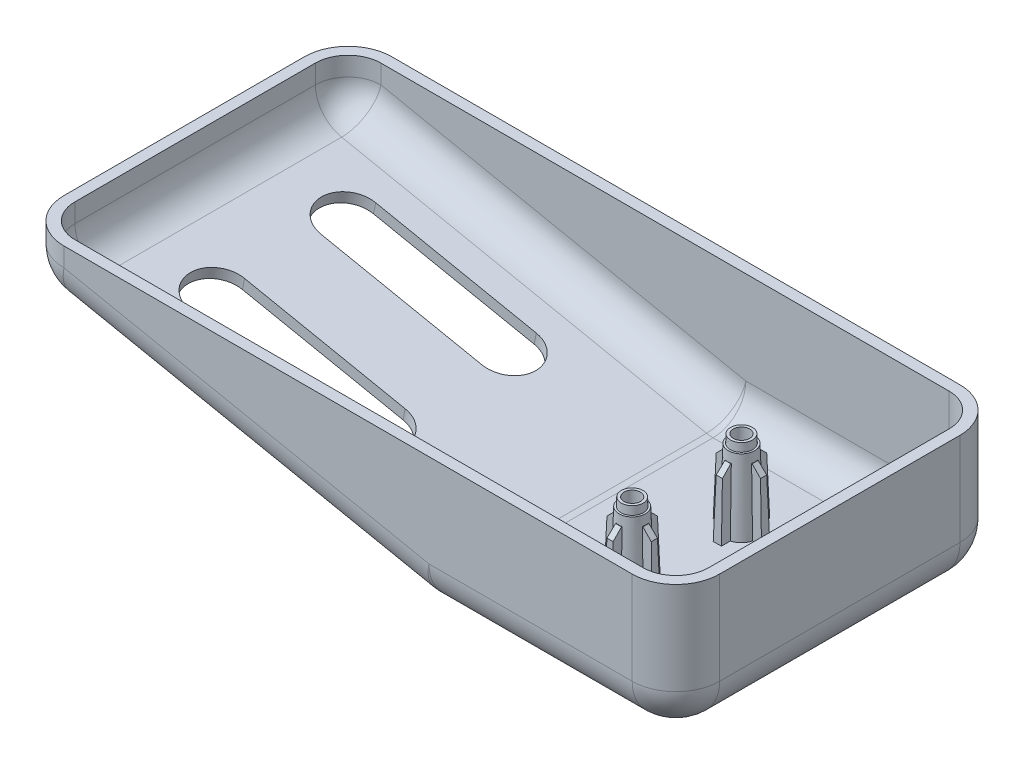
ISO-10303-21;
HEADER;
FILE_DESCRIPTION(('STEP AP214'),'2;1');
FILE_NAME('part.step','',(''),(''),'','','');
FILE_SCHEMA(('AUTOMOTIVE_DESIGN { 1 0 10303 214 1 1 1 1 }'));
ENDSEC;
DATA;
#1=APPLICATION_CONTEXT('core data for automotive mechanical design processes');
#2=APPLICATION_PROTOCOL_DEFINITION('international standard','automotive_design',2000,#1);
#3=PRODUCT_CONTEXT('',#1,'mechanical');
#4=PRODUCT('Part','Part','',(#3));
#5=PRODUCT_RELATED_PRODUCT_CATEGORY('part','',(#4));
#6=PRODUCT_DEFINITION_FORMATION('','',#4);
#7=PRODUCT_DEFINITION_CONTEXT('part definition',#1,'design');
#8=PRODUCT_DEFINITION('design','',#6,#7);
#9=PRODUCT_DEFINITION_SHAPE('','',#8);
#10=(LENGTH_UNIT() NAMED_UNIT(*) SI_UNIT(.MILLI.,.METRE.));
#11=(NAMED_UNIT(*) PLANE_ANGLE_UNIT() SI_UNIT($,.RADIAN.));
#12=(NAMED_UNIT(*) SI_UNIT($,.STERADIAN.) SOLID_ANGLE_UNIT());
#13=UNCERTAINTY_MEASURE_WITH_UNIT(LENGTH_MEASURE(1.E-05),#10,'distance_accuracy_value','');
#14=(GEOMETRIC_REPRESENTATION_CONTEXT(3) GLOBAL_UNCERTAINTY_ASSIGNED_CONTEXT((#13)) GLOBAL_UNIT_ASSIGNED_CONTEXT((#10,
#11,#12)) REPRESENTATION_CONTEXT('',''));
#15=CARTESIAN_POINT('',(0.,0.,0.));
#16=DIRECTION('',(0.,0.,1.));
#17=DIRECTION('',(1.,0.,0.));
#18=AXIS2_PLACEMENT_3D('',#15,#16,#17);
#19=CARTESIAN_POINT('',(0.,0.,30.));
#20=DIRECTION('',(0.198662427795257,0.980067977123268,0.));
#21=DIRECTION('',(-0.980067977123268,0.198662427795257,0.));
#22=AXIS2_PLACEMENT_3D('',#19,#20,#21);
#23=PLANE('',#22);
#24=CARTESIAN_POINT('',(-26.9436279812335,5.46154621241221,12.));
#25=DIRECTION('',(0.198662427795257,0.980067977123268,0.));
#26=DIRECTION('',(-0.980067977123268,0.198662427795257,0.));
#27=AXIS2_PLACEMENT_3D('',#24,#25,#26);
#28=CIRCLE('',#27,5.);
#29=CARTESIAN_POINT('',(-26.9436279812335,5.46154621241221,17.));
#30=VERTEX_POINT('',#29);
#31=CARTESIAN_POINT('',(-26.9436279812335,5.46154621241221,7.00000000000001));
#32=VERTEX_POINT('',#31);
#33=EDGE_CURVE('E1450',#30,#32,#28,.T.);
#34=ORIENTED_EDGE('',*,*,#33,.T.);
#35=DIRECTION('',(-0.980067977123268,0.198662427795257,0.));
#36=VECTOR('',#35,1.);
#37=CARTESIAN_POINT('',(-26.9436279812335,5.46154621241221,7.00000000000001));
#38=LINE('',#37,#36);
#39=CARTESIAN_POINT('',(-56.3456672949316,11.4214190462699,7.00000000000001));
#40=VERTEX_POINT('',#39);
#41=EDGE_CURVE('E1425',#32,#40,#38,.T.);
#42=ORIENTED_EDGE('',*,*,#41,.T.);
#43=CARTESIAN_POINT('',(-56.3456672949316,11.4214190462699,12.));
#44=DIRECTION('',(0.198662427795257,0.980067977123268,0.));
#45=DIRECTION('',(-0.980067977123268,0.198662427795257,0.));
#46=AXIS2_PLACEMENT_3D('',#43,#44,#45);
#47=CIRCLE('',#46,5.);
#48=CARTESIAN_POINT('',(-56.3456672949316,11.4214190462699,17.));
#49=VERTEX_POINT('',#48);
#50=EDGE_CURVE('E1455',#40,#49,#47,.T.);
#51=ORIENTED_EDGE('',*,*,#50,.T.);
#52=DIRECTION('',(0.980067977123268,-0.198662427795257,0.));
#53=VECTOR('',#52,1.);
#54=CARTESIAN_POINT('',(-26.9436279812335,5.46154621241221,17.));
#55=LINE('',#54,#53);
#56=EDGE_CURVE('E1452',#49,#30,#55,.T.);
#57=ORIENTED_EDGE('',*,*,#56,.T.);
#58=EDGE_LOOP('',(#34,#42,#51,#57));
#59=FACE_BOUND('',#58,.T.);
#60=DIRECTION('',(0.980067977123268,-0.198662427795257,0.));
#61=VECTOR('',#60,1.);
#62=CARTESIAN_POINT('',(0.,0.,-22.));
#63=LINE('',#62,#61);
#64=CARTESIAN_POINT('',(-67.589299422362,13.700533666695,-22.));
#65=VERTEX_POINT('',#64);
#66=CARTESIAN_POINT('',(-0.786650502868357,0.159456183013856,-22.));
#67=VERTEX_POINT('',#66);
#68=EDGE_CURVE('E1291',#65,#67,#63,.T.);
#69=ORIENTED_EDGE('',*,*,#68,.T.);
#70=DIRECTION('',(0.,0.,-1.));
#71=VECTOR('',#70,1.);
#72=CARTESIAN_POINT('',(-0.786650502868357,0.159456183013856,30.));
#73=LINE('',#72,#71);
#74=CARTESIAN_POINT('',(-0.786650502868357,0.159456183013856,22.));
#75=VERTEX_POINT('',#74);
#76=EDGE_CURVE('E1286',#67,#75,#73,.F.);
#77=ORIENTED_EDGE('',*,*,#76,.T.);
#78=DIRECTION('',(0.980067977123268,-0.198662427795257,0.));
#79=VECTOR('',#78,1.);
#80=CARTESIAN_POINT('',(0.,0.,22.));
#81=LINE('',#80,#79);
#82=CARTESIAN_POINT('',(-67.589299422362,13.700533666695,22.));
#83=VERTEX_POINT('',#82);
#84=EDGE_CURVE('E1289',#75,#83,#81,.F.);
#85=ORIENTED_EDGE('',*,*,#84,.T.);
#86=DIRECTION('',(0.,0.,-1.));
#87=VECTOR('',#86,1.);
#88=CARTESIAN_POINT('',(-67.589299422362,13.700533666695,30.));
#89=LINE('',#88,#87);
#90=EDGE_CURVE('E1293',#83,#65,#89,.T.);
#91=ORIENTED_EDGE('',*,*,#90,.T.);
#92=EDGE_LOOP('',(#69,#77,#85,#91));
#93=FACE_BOUND('',#92,.T.);
#94=CARTESIAN_POINT('',(-26.9436279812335,5.46154621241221,-12.));
#95=DIRECTION('',(0.198662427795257,0.980067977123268,0.));
#96=DIRECTION('',(-0.980067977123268,0.198662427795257,0.));
#97=AXIS2_PLACEMENT_3D('',#94,#95,#96);
#98=CIRCLE('',#97,5.);
#99=CARTESIAN_POINT('',(-26.9436279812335,5.46154621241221,-7.));
#100=VERTEX_POINT('',#99);
#101=CARTESIAN_POINT('',(-26.9436279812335,5.46154621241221,-17.));
#102=VERTEX_POINT('',#101);
#103=EDGE_CURVE('E1480',#100,#102,#98,.T.);
#104=ORIENTED_EDGE('',*,*,#103,.T.);
#105=DIRECTION('',(-0.980067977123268,0.198662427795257,0.));
#106=VECTOR('',#105,1.);
#107=CARTESIAN_POINT('',(-26.9436279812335,5.46154621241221,-17.));
#108=LINE('',#107,#106);
#109=CARTESIAN_POINT('',(-56.3456672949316,11.4214190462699,-17.));
#110=VERTEX_POINT('',#109);
#111=EDGE_CURVE('E1333',#102,#110,#108,.T.);
#112=ORIENTED_EDGE('',*,*,#111,.T.);
#113=CARTESIAN_POINT('',(-56.3456672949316,11.4214190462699,-12.));
#114=DIRECTION('',(0.198662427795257,0.980067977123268,0.));
#115=DIRECTION('',(-0.980067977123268,0.198662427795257,0.));
#116=AXIS2_PLACEMENT_3D('',#113,#114,#115);
#117=CIRCLE('',#116,5.);
#118=CARTESIAN_POINT('',(-56.3456672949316,11.4214190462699,-7.));
#119=VERTEX_POINT('',#118);
#120=EDGE_CURVE('E1428',#110,#119,#117,.T.);
#121=ORIENTED_EDGE('',*,*,#120,.T.);
#122=DIRECTION('',(0.980067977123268,-0.198662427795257,0.));
#123=VECTOR('',#122,1.);
#124=CARTESIAN_POINT('',(-26.9436279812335,5.46154621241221,-7.));
#125=LINE('',#124,#123);
#126=EDGE_CURVE('E1483',#119,#100,#125,.T.);
#127=ORIENTED_EDGE('',*,*,#126,.T.);
#128=EDGE_LOOP('',(#104,#112,#121,#127));
#129=FACE_BOUND('',#128,.T.);
#130=ADVANCED_FACE('F34',(#59,#93,#129),#23,.F.);
#131=CARTESIAN_POINT('',(0.397324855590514,1.96013595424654,30.));
#132=DIRECTION('',(0.198662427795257,0.980067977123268,0.));
#133=DIRECTION('',(-0.980067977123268,0.198662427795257,0.));
#134=AXIS2_PLACEMENT_3D('',#131,#132,#133);
#135=PLANE('',#134);
#136=DIRECTION('',(-0.980067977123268,0.198662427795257,0.));
#137=VECTOR('',#136,1.);
#138=CARTESIAN_POINT('',(0.397324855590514,1.96013595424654,-22.));
#139=LINE('',#138,#137);
#140=CARTESIAN_POINT('',(-67.1919745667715,15.6606696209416,-22.));
#141=VERTEX_POINT('',#140);
#142=CARTESIAN_POINT('',(-0.389325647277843,2.11959213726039,-22.));
#143=VERTEX_POINT('',#142);
#144=EDGE_CURVE('E1374',#141,#143,#139,.F.);
#145=ORIENTED_EDGE('',*,*,#144,.F.);
#146=DIRECTION('',(0.,0.,1.));
#147=VECTOR('',#146,1.);
#148=CARTESIAN_POINT('',(-67.1919745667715,15.6606696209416,30.));
#149=LINE('',#148,#147);
#150=CARTESIAN_POINT('',(-67.1919745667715,15.6606696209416,22.));
#151=VERTEX_POINT('',#150);
#152=EDGE_CURVE('E1372',#151,#141,#149,.F.);
#153=ORIENTED_EDGE('',*,*,#152,.F.);
#154=DIRECTION('',(-0.980067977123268,0.198662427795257,0.));
#155=VECTOR('',#154,1.);
#156=CARTESIAN_POINT('',(0.397324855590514,1.96013595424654,22.));
#157=LINE('',#156,#155);
#158=CARTESIAN_POINT('',(-0.389325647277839,2.11959213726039,22.));
#159=VERTEX_POINT('',#158);
#160=EDGE_CURVE('E1380',#159,#151,#157,.T.);
#161=ORIENTED_EDGE('',*,*,#160,.F.);
#162=DIRECTION('',(0.,0.,1.));
#163=VECTOR('',#162,1.);
#164=CARTESIAN_POINT('',(-0.389325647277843,2.11959213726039,30.));
#165=LINE('',#164,#163);
#166=EDGE_CURVE('E1376',#143,#159,#165,.T.);
#167=ORIENTED_EDGE('',*,*,#166,.F.);
#168=EDGE_LOOP('',(#145,#153,#161,#167));
#169=FACE_BOUND('',#168,.T.);
#170=DIRECTION('',(0.980067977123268,-0.198662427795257,0.));
#171=VECTOR('',#170,1.);
#172=CARTESIAN_POINT('',(-26.546303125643,7.42168216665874,7.00000000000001));
#173=LINE('',#172,#171);
#174=CARTESIAN_POINT('',(-55.9483424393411,13.3815550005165,7.00000000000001));
#175=VERTEX_POINT('',#174);
#176=CARTESIAN_POINT('',(-26.546303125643,7.42168216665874,7.00000000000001));
#177=VERTEX_POINT('',#176);
#178=EDGE_CURVE('E1438',#175,#177,#173,.T.);
#179=ORIENTED_EDGE('',*,*,#178,.T.);
#180=CARTESIAN_POINT('',(-26.546303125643,7.42168216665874,12.));
#181=DIRECTION('',(-0.198662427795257,-0.980067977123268,0.));
#182=DIRECTION('',(0.980067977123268,-0.198662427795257,0.));
#183=AXIS2_PLACEMENT_3D('',#180,#181,#182);
#184=CIRCLE('',#183,5.);
#185=CARTESIAN_POINT('',(-26.546303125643,7.42168216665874,17.));
#186=VERTEX_POINT('',#185);
#187=EDGE_CURVE('E1447',#177,#186,#184,.T.);
#188=ORIENTED_EDGE('',*,*,#187,.T.);
#189=DIRECTION('',(-0.980067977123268,0.198662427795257,0.));
#190=VECTOR('',#189,1.);
#191=CARTESIAN_POINT('',(-26.546303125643,7.42168216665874,17.));
#192=LINE('',#191,#190);
#193=CARTESIAN_POINT('',(-55.9483424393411,13.3815550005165,17.));
#194=VERTEX_POINT('',#193);
#195=EDGE_CURVE('E1444',#186,#194,#192,.T.);
#196=ORIENTED_EDGE('',*,*,#195,.T.);
#197=CARTESIAN_POINT('',(-55.9483424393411,13.3815550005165,12.));
#198=DIRECTION('',(-0.198662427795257,-0.980067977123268,0.));
#199=DIRECTION('',(0.980067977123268,-0.198662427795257,0.));
#200=AXIS2_PLACEMENT_3D('',#197,#198,#199);
#201=CIRCLE('',#200,5.);
#202=EDGE_CURVE('E1441',#194,#175,#201,.T.);
#203=ORIENTED_EDGE('',*,*,#202,.T.);
#204=EDGE_LOOP('',(#179,#188,#196,#203));
#205=FACE_BOUND('',#204,.T.);
#206=DIRECTION('',(0.980067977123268,-0.198662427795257,0.));
#207=VECTOR('',#206,1.);
#208=CARTESIAN_POINT('',(-26.546303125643,7.42168216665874,-17.));
#209=LINE('',#208,#207);
#210=CARTESIAN_POINT('',(-55.9483424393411,13.3815550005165,-17.));
#211=VERTEX_POINT('',#210);
#212=CARTESIAN_POINT('',(-26.546303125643,7.42168216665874,-17.));
#213=VERTEX_POINT('',#212);
#214=EDGE_CURVE('E1468',#211,#213,#209,.T.);
#215=ORIENTED_EDGE('',*,*,#214,.T.);
#216=CARTESIAN_POINT('',(-26.546303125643,7.42168216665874,-12.));
#217=DIRECTION('',(-0.198662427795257,-0.980067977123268,0.));
#218=DIRECTION('',(0.980067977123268,-0.198662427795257,0.));
#219=AXIS2_PLACEMENT_3D('',#216,#217,#218);
#220=CIRCLE('',#219,5.);
#221=CARTESIAN_POINT('',(-26.546303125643,7.42168216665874,-7.));
#222=VERTEX_POINT('',#221);
#223=EDGE_CURVE('E1477',#213,#222,#220,.T.);
#224=ORIENTED_EDGE('',*,*,#223,.T.);
#225=DIRECTION('',(-0.980067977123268,0.198662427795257,0.));
#226=VECTOR('',#225,1.);
#227=CARTESIAN_POINT('',(-26.546303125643,7.42168216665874,-7.));
#228=LINE('',#227,#226);
#229=CARTESIAN_POINT('',(-55.9483424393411,13.3815550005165,-7.));
#230=VERTEX_POINT('',#229);
#231=EDGE_CURVE('E1474',#222,#230,#228,.T.);
#232=ORIENTED_EDGE('',*,*,#231,.T.);
#233=CARTESIAN_POINT('',(-55.9483424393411,13.3815550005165,-12.));
#234=DIRECTION('',(-0.198662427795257,-0.980067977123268,0.));
#235=DIRECTION('',(0.980067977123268,-0.198662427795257,0.));
#236=AXIS2_PLACEMENT_3D('',#233,#234,#235);
#237=CIRCLE('',#236,5.);
#238=EDGE_CURVE('E1471',#230,#211,#237,.T.);
#239=ORIENTED_EDGE('',*,*,#238,.T.);
#240=EDGE_LOOP('',(#215,#224,#232,#239));
#241=FACE_BOUND('',#240,.T.);
#242=ADVANCED_FACE('F745',(#169,#205,#241),#135,.T.);
#243=CARTESIAN_POINT('',(-74.,15.,30.));
#244=DIRECTION('',(1.,0.,0.));
#245=DIRECTION('',(0.,0.,-1.));
#246=AXIS2_PLACEMENT_3D('',#243,#244,#245);
#247=PLANE('',#246);
#248=DIRECTION('',(0.,0.,-1.));
#249=VECTOR('',#248,1.);
#250=CARTESIAN_POINT('',(-74.,21.5410774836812,30.));
#251=LINE('',#250,#249);
#252=CARTESIAN_POINT('',(-74.,21.5410774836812,-22.));
#253=VERTEX_POINT('',#252);
#254=CARTESIAN_POINT('',(-74.,21.5410774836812,22.));
#255=VERTEX_POINT('',#254);
#256=EDGE_CURVE('E1257',#253,#255,#251,.F.);
#257=ORIENTED_EDGE('',*,*,#256,.T.);
#258=DIRECTION('',(0.,-1.,0.));
#259=VECTOR('',#258,1.);
#260=CARTESIAN_POINT('',(-74.,15.,22.));
#261=LINE('',#260,#259);
#262=CARTESIAN_POINT('',(-74.,25.,22.));
#263=VERTEX_POINT('',#262);
#264=EDGE_CURVE('E1259',#255,#263,#261,.F.);
#265=ORIENTED_EDGE('',*,*,#264,.T.);
#266=DIRECTION('',(0.,0.,-1.));
#267=VECTOR('',#266,1.);
#268=CARTESIAN_POINT('',(-74.,25.,30.));
#269=LINE('',#268,#267);
#270=CARTESIAN_POINT('',(-74.,25.,-22.));
#271=VERTEX_POINT('',#270);
#272=EDGE_CURVE('E1264',#263,#271,#269,.T.);
#273=ORIENTED_EDGE('',*,*,#272,.T.);
#274=DIRECTION('',(0.,-1.,0.));
#275=VECTOR('',#274,1.);
#276=CARTESIAN_POINT('',(-74.,15.,-22.));
#277=LINE('',#276,#275);
#278=EDGE_CURVE('E1250',#271,#253,#277,.T.);
#279=ORIENTED_EDGE('',*,*,#278,.T.);
#280=EDGE_LOOP('',(#257,#265,#273,#279));
#281=FACE_BOUND('',#280,.T.);
#282=ADVANCED_FACE('F751',(#281),#247,.F.);
#283=CARTESIAN_POINT('',(46.,0.,30.));
#284=DIRECTION('',(0.,1.,0.));
#285=DIRECTION('',(0.,0.,1.));
#286=AXIS2_PLACEMENT_3D('',#283,#284,#285);
#287=PLANE('',#286);
#288=CARTESIAN_POINT('',(18.,0.,10.));
#289=DIRECTION('',(0.,1.,0.));
#290=DIRECTION('',(0.,0.,1.));
#291=AXIS2_PLACEMENT_3D('',#288,#289,#290);
#292=CIRCLE('',#291,2.23993732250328);
#293=CARTESIAN_POINT('',(18.,0.,12.2399373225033));
#294=VERTEX_POINT('',#293);
#295=EDGE_CURVE('E38',#294,#294,#292,.T.);
#296=ORIENTED_EDGE('',*,*,#295,.T.);
#297=EDGE_LOOP('',(#296));
#298=FACE_BOUND('',#297,.T.);
#299=CARTESIAN_POINT('',(18.,0.,-10.));
#300=DIRECTION('',(0.,1.,0.));
#301=DIRECTION('',(0.,0.,1.));
#302=AXIS2_PLACEMENT_3D('',#299,#300,#301);
#303=CIRCLE('',#302,2.23993732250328);
#304=CARTESIAN_POINT('',(18.,0.,-7.76006267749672));
#305=VERTEX_POINT('',#304);
#306=EDGE_CURVE('E904',#305,#305,#303,.T.);
#307=ORIENTED_EDGE('',*,*,#306,.T.);
#308=EDGE_LOOP('',(#307));
#309=FACE_BOUND('',#308,.T.);
#310=DIRECTION('',(1.,0.,0.));
#311=VECTOR('',#310,1.);
#312=CARTESIAN_POINT('',(46.,0.,22.));
#313=LINE('',#312,#311);
#314=CARTESIAN_POINT('',(38.,0.,22.));
#315=VERTEX_POINT('',#314);
#316=CARTESIAN_POINT('',(0.802648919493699,0.,22.));
#317=VERTEX_POINT('',#316);
#318=EDGE_CURVE('E1298',#315,#317,#313,.F.);
#319=ORIENTED_EDGE('',*,*,#318,.T.);
#320=DIRECTION('',(0.,0.,-1.));
#321=VECTOR('',#320,1.);
#322=CARTESIAN_POINT('',(0.802648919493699,0.,30.));
#323=LINE('',#322,#321);
#324=CARTESIAN_POINT('',(0.802648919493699,0.,-22.));
#325=VERTEX_POINT('',#324);
#326=EDGE_CURVE('E1295',#317,#325,#323,.T.);
#327=ORIENTED_EDGE('',*,*,#326,.T.);
#328=DIRECTION('',(1.,0.,0.));
#329=VECTOR('',#328,1.);
#330=CARTESIAN_POINT('',(46.,0.,-22.));
#331=LINE('',#330,#329);
#332=CARTESIAN_POINT('',(38.,0.,-22.));
#333=VERTEX_POINT('',#332);
#334=EDGE_CURVE('E1300',#325,#333,#331,.T.);
#335=ORIENTED_EDGE('',*,*,#334,.T.);
#336=DIRECTION('',(0.,0.,-1.));
#337=VECTOR('',#336,1.);
#338=CARTESIAN_POINT('',(38.,0.,30.));
#339=LINE('',#338,#337);
#340=EDGE_CURVE('E1241',#333,#315,#339,.F.);
#341=ORIENTED_EDGE('',*,*,#340,.T.);
#342=EDGE_LOOP('',(#319,#327,#335,#341));
#343=FACE_BOUND('',#342,.T.);
#344=ADVANCED_FACE('F758',(#298,#309,#343),#287,.F.);
#345=CARTESIAN_POINT('',(46.,25.,30.));
#346=DIRECTION('',(-1.,0.,0.));
#347=DIRECTION('',(0.,0.,1.));
#348=AXIS2_PLACEMENT_3D('',#345,#346,#347);
#349=PLANE('',#348);
#350=DIRECTION('',(0.,0.,-1.));
#351=VECTOR('',#350,1.);
#352=CARTESIAN_POINT('',(46.,8.,30.));
#353=LINE('',#352,#351);
#354=CARTESIAN_POINT('',(46.,8.,22.));
#355=VERTEX_POINT('',#354);
#356=CARTESIAN_POINT('',(46.,8.,-22.));
#357=VERTEX_POINT('',#356);
#358=EDGE_CURVE('E847',#355,#357,#353,.T.);
#359=ORIENTED_EDGE('',*,*,#358,.T.);
#360=DIRECTION('',(0.,1.,0.));
#361=VECTOR('',#360,1.);
#362=CARTESIAN_POINT('',(46.,25.,-22.));
#363=LINE('',#362,#361);
#364=CARTESIAN_POINT('',(46.,25.,-22.));
#365=VERTEX_POINT('',#364);
#366=EDGE_CURVE('E844',#357,#365,#363,.T.);
#367=ORIENTED_EDGE('',*,*,#366,.T.);
#368=DIRECTION('',(0.,0.,-1.));
#369=VECTOR('',#368,1.);
#370=CARTESIAN_POINT('',(46.,25.,30.));
#371=LINE('',#370,#369);
#372=CARTESIAN_POINT('',(46.,25.,22.));
#373=VERTEX_POINT('',#372);
#374=EDGE_CURVE('E1273',#373,#365,#371,.T.);
#375=ORIENTED_EDGE('',*,*,#374,.F.);
#376=DIRECTION('',(0.,1.,0.));
#377=VECTOR('',#376,1.);
#378=CARTESIAN_POINT('',(46.,25.,22.));
#379=LINE('',#378,#377);
#380=EDGE_CURVE('E838',#373,#355,#379,.F.);
#381=ORIENTED_EDGE('',*,*,#380,.T.);
#382=EDGE_LOOP('',(#359,#367,#375,#381));
#383=FACE_BOUND('',#382,.T.);
#384=ADVANCED_FACE('F1224',(#383),#349,.F.);
#385=CARTESIAN_POINT('',(-74.,25.,30.));
#386=DIRECTION('',(0.,-1.,0.));
#387=DIRECTION('',(0.,0.,-1.));
#388=AXIS2_PLACEMENT_3D('',#385,#386,#387);
#389=PLANE('',#388);
#390=DIRECTION('',(0.,0.,-1.));
#391=VECTOR('',#390,1.);
#392=CARTESIAN_POINT('',(44.,25.,30.));
#393=LINE('',#392,#391);
#394=CARTESIAN_POINT('',(44.,25.,22.));
#395=VERTEX_POINT('',#394);
#396=CARTESIAN_POINT('',(44.,25.,-22.));
#397=VERTEX_POINT('',#396);
#398=EDGE_CURVE('E1316',#395,#397,#393,.T.);
#399=ORIENTED_EDGE('',*,*,#398,.F.);
#400=CARTESIAN_POINT('',(38.,25.,22.));
#401=DIRECTION('',(0.,-1.,0.));
#402=DIRECTION('',(0.,0.,-1.));
#403=AXIS2_PLACEMENT_3D('',#400,#401,#402);
#404=CIRCLE('',#403,6.);
#405=CARTESIAN_POINT('',(38.,25.,28.));
#406=VERTEX_POINT('',#405);
#407=EDGE_CURVE('E1309',#406,#395,#404,.F.);
#408=ORIENTED_EDGE('',*,*,#407,.F.);
#409=DIRECTION('',(-1.,0.,0.));
#410=VECTOR('',#409,1.);
#411=CARTESIAN_POINT('',(0.,25.,28.));
#412=LINE('',#411,#410);
#413=CARTESIAN_POINT('',(-66.,25.,28.));
#414=VERTEX_POINT('',#413);
#415=EDGE_CURVE('E1313',#406,#414,#412,.T.);
#416=ORIENTED_EDGE('',*,*,#415,.T.);
#417=CARTESIAN_POINT('',(-66.,25.,22.));
#418=DIRECTION('',(0.,-1.,0.));
#419=DIRECTION('',(0.,0.,-1.));
#420=AXIS2_PLACEMENT_3D('',#417,#418,#419);
#421=CIRCLE('',#420,6.);
#422=CARTESIAN_POINT('',(-72.,25.,22.));
#423=VERTEX_POINT('',#422);
#424=EDGE_CURVE('E1308',#423,#414,#421,.F.);
#425=ORIENTED_EDGE('',*,*,#424,.F.);
#426=DIRECTION('',(0.,0.,-1.));
#427=VECTOR('',#426,1.);
#428=CARTESIAN_POINT('',(-72.,25.,30.));
#429=LINE('',#428,#427);
#430=CARTESIAN_POINT('',(-72.,25.,-22.));
#431=VERTEX_POINT('',#430);
#432=EDGE_CURVE('E1320',#423,#431,#429,.T.);
#433=ORIENTED_EDGE('',*,*,#432,.T.);
#434=CARTESIAN_POINT('',(-66.,25.,-22.));
#435=DIRECTION('',(0.,-1.,0.));
#436=DIRECTION('',(0.,0.,-1.));
#437=AXIS2_PLACEMENT_3D('',#434,#435,#436);
#438=CIRCLE('',#437,6.);
#439=CARTESIAN_POINT('',(-66.,25.,-28.));
#440=VERTEX_POINT('',#439);
#441=EDGE_CURVE('E1306',#440,#431,#438,.F.);
#442=ORIENTED_EDGE('',*,*,#441,.F.);
#443=DIRECTION('',(-1.,0.,0.));
#444=VECTOR('',#443,1.);
#445=CARTESIAN_POINT('',(0.,25.,-28.));
#446=LINE('',#445,#444);
#447=CARTESIAN_POINT('',(38.,25.,-28.));
#448=VERTEX_POINT('',#447);
#449=EDGE_CURVE('E1310',#448,#440,#446,.T.);
#450=ORIENTED_EDGE('',*,*,#449,.F.);
#451=CARTESIAN_POINT('',(38.,25.,-22.));
#452=DIRECTION('',(0.,-1.,0.));
#453=DIRECTION('',(0.,0.,-1.));
#454=AXIS2_PLACEMENT_3D('',#451,#452,#453);
#455=CIRCLE('',#454,6.);
#456=EDGE_CURVE('E855',#397,#448,#455,.F.);
#457=ORIENTED_EDGE('',*,*,#456,.F.);
#458=EDGE_LOOP('',(#399,#408,#416,#425,#433,#442,#450,#457));
#459=FACE_BOUND('',#458,.T.);
#460=ORIENTED_EDGE('',*,*,#374,.T.);
#461=CARTESIAN_POINT('',(38.,25.,-22.));
#462=DIRECTION('',(0.,-1.,0.));
#463=DIRECTION('',(0.,0.,-1.));
#464=AXIS2_PLACEMENT_3D('',#461,#462,#463);
#465=CIRCLE('',#464,8.);
#466=CARTESIAN_POINT('',(38.,25.,-30.));
#467=VERTEX_POINT('',#466);
#468=EDGE_CURVE('E11',#365,#467,#465,.F.);
#469=ORIENTED_EDGE('',*,*,#468,.T.);
#470=DIRECTION('',(-1.,0.,0.));
#471=VECTOR('',#470,1.);
#472=CARTESIAN_POINT('',(-74.,25.,-30.));
#473=LINE('',#472,#471);
#474=CARTESIAN_POINT('',(-66.,25.,-30.));
#475=VERTEX_POINT('',#474);
#476=EDGE_CURVE('E903',#467,#475,#473,.T.);
#477=ORIENTED_EDGE('',*,*,#476,.T.);
#478=CARTESIAN_POINT('',(-66.,25.,-22.));
#479=DIRECTION('',(0.,-1.,0.));
#480=DIRECTION('',(0.,0.,-1.));
#481=AXIS2_PLACEMENT_3D('',#478,#479,#480);
#482=CIRCLE('',#481,8.);
#483=EDGE_CURVE('E843',#475,#271,#482,.F.);
#484=ORIENTED_EDGE('',*,*,#483,.T.);
#485=ORIENTED_EDGE('',*,*,#272,.F.);
#486=CARTESIAN_POINT('',(-66.,25.,22.));
#487=DIRECTION('',(0.,-1.,0.));
#488=DIRECTION('',(0.,0.,-1.));
#489=AXIS2_PLACEMENT_3D('',#486,#487,#488);
#490=CIRCLE('',#489,8.);
#491=CARTESIAN_POINT('',(-66.,25.,30.));
#492=VERTEX_POINT('',#491);
#493=EDGE_CURVE('E43',#263,#492,#490,.F.);
#494=ORIENTED_EDGE('',*,*,#493,.T.);
#495=DIRECTION('',(-1.,0.,0.));
#496=VECTOR('',#495,1.);
#497=CARTESIAN_POINT('',(-74.,25.,30.));
#498=LINE('',#497,#496);
#499=CARTESIAN_POINT('',(38.,25.,30.));
#500=VERTEX_POINT('',#499);
#501=EDGE_CURVE('E1274',#500,#492,#498,.T.);
#502=ORIENTED_EDGE('',*,*,#501,.F.);
#503=CARTESIAN_POINT('',(38.,25.,22.));
#504=DIRECTION('',(0.,-1.,0.));
#505=DIRECTION('',(0.,0.,-1.));
#506=AXIS2_PLACEMENT_3D('',#503,#504,#505);
#507=CIRCLE('',#506,8.);
#508=EDGE_CURVE('E834',#500,#373,#507,.F.);
#509=ORIENTED_EDGE('',*,*,#508,.T.);
#510=EDGE_LOOP('',(#460,#469,#477,#484,#485,#494,#502,#509));
#511=FACE_BOUND('',#510,.T.);
#512=ADVANCED_FACE('F1218',(#459,#511),#389,.F.);
#513=CARTESIAN_POINT('',(0.,0.,30.));
#514=DIRECTION('',(0.,0.,-1.));
#515=DIRECTION('',(-1.,0.,0.));
#516=AXIS2_PLACEMENT_3D('',#513,#514,#515);
#517=PLANE('',#516);
#518=ORIENTED_EDGE('',*,*,#501,.T.);
#519=DIRECTION('',(0.,-1.,0.));
#520=VECTOR('',#519,1.);
#521=CARTESIAN_POINT('',(-66.,0.,30.));
#522=LINE('',#521,#520);
#523=CARTESIAN_POINT('',(-66.,21.5410774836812,30.));
#524=VERTEX_POINT('',#523);
#525=EDGE_CURVE('E1277',#492,#524,#522,.T.);
#526=ORIENTED_EDGE('',*,*,#525,.T.);
#527=DIRECTION('',(0.980067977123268,-0.198662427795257,0.));
#528=VECTOR('',#527,1.);
#529=CARTESIAN_POINT('',(1.58929942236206,7.84054381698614,30.));
#530=LINE('',#529,#528);
#531=CARTESIAN_POINT('',(0.802648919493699,8.,30.));
#532=VERTEX_POINT('',#531);
#533=EDGE_CURVE('E1279',#524,#532,#530,.T.);
#534=ORIENTED_EDGE('',*,*,#533,.T.);
#535=DIRECTION('',(1.,0.,0.));
#536=VECTOR('',#535,1.);
#537=CARTESIAN_POINT('',(0.,8.,30.));
#538=LINE('',#537,#536);
#539=CARTESIAN_POINT('',(38.,8.,30.));
#540=VERTEX_POINT('',#539);
#541=EDGE_CURVE('E1281',#532,#540,#538,.T.);
#542=ORIENTED_EDGE('',*,*,#541,.T.);
#543=DIRECTION('',(0.,1.,0.));
#544=VECTOR('',#543,1.);
#545=CARTESIAN_POINT('',(38.,0.,30.));
#546=LINE('',#545,#544);
#547=EDGE_CURVE('E836',#540,#500,#546,.T.);
#548=ORIENTED_EDGE('',*,*,#547,.T.);
#549=EDGE_LOOP('',(#518,#526,#534,#542,#548));
#550=FACE_BOUND('',#549,.T.);
#551=ADVANCED_FACE('F1215',(#550),#517,.F.);
#552=CARTESIAN_POINT('',(0.,0.,-30.));
#553=DIRECTION('',(0.,0.,-1.));
#554=DIRECTION('',(-1.,0.,0.));
#555=AXIS2_PLACEMENT_3D('',#552,#553,#554);
#556=PLANE('',#555);
#557=ORIENTED_EDGE('',*,*,#476,.F.);
#558=DIRECTION('',(0.,1.,0.));
#559=VECTOR('',#558,1.);
#560=CARTESIAN_POINT('',(38.,0.,-30.));
#561=LINE('',#560,#559);
#562=CARTESIAN_POINT('',(38.,8.,-30.));
#563=VERTEX_POINT('',#562);
#564=EDGE_CURVE('E1247',#467,#563,#561,.F.);
#565=ORIENTED_EDGE('',*,*,#564,.T.);
#566=DIRECTION('',(1.,0.,0.));
#567=VECTOR('',#566,1.);
#568=CARTESIAN_POINT('',(0.,8.,-30.));
#569=LINE('',#568,#567);
#570=CARTESIAN_POINT('',(0.802648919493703,8.,-30.));
#571=VERTEX_POINT('',#570);
#572=EDGE_CURVE('E1245',#563,#571,#569,.F.);
#573=ORIENTED_EDGE('',*,*,#572,.T.);
#574=DIRECTION('',(0.980067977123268,-0.198662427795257,0.));
#575=VECTOR('',#574,1.);
#576=CARTESIAN_POINT('',(-72.410700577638,22.8405438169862,-30.));
#577=LINE('',#576,#575);
#578=CARTESIAN_POINT('',(-66.,21.5410774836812,-30.));
#579=VERTEX_POINT('',#578);
#580=EDGE_CURVE('E1248',#571,#579,#577,.F.);
#581=ORIENTED_EDGE('',*,*,#580,.T.);
#582=DIRECTION('',(0.,-1.,0.));
#583=VECTOR('',#582,1.);
#584=CARTESIAN_POINT('',(-66.,25.,-30.));
#585=LINE('',#584,#583);
#586=EDGE_CURVE('E1252',#579,#475,#585,.F.);
#587=ORIENTED_EDGE('',*,*,#586,.T.);
#588=EDGE_LOOP('',(#557,#565,#573,#581,#587));
#589=FACE_BOUND('',#588,.T.);
#590=ADVANCED_FACE('F829',(#589),#556,.T.);
#591=CARTESIAN_POINT('',(-66.,0.,22.));
#592=DIRECTION('',(0.,-1.,0.));
#593=DIRECTION('',(0.,0.,-1.));
#594=AXIS2_PLACEMENT_3D('',#591,#592,#593);
#595=CYLINDRICAL_SURFACE('',#594,8.);
#596=ORIENTED_EDGE('',*,*,#493,.F.);
#597=ORIENTED_EDGE('',*,*,#264,.F.);
#598=CARTESIAN_POINT('',(-66.,21.5410774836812,22.));
#599=DIRECTION('',(0.,-1.,0.));
#600=DIRECTION('',(0.,0.,-1.));
#601=AXIS2_PLACEMENT_3D('',#598,#599,#600);
#602=CIRCLE('',#601,8.);
#603=EDGE_CURVE('E898',#524,#255,#602,.T.);
#604=ORIENTED_EDGE('',*,*,#603,.F.);
#605=ORIENTED_EDGE('',*,*,#525,.F.);
#606=EDGE_LOOP('',(#596,#597,#604,#605));
#607=FACE_BOUND('',#606,.T.);
#608=ADVANCED_FACE('F36',(#607),#595,.T.);
#609=CARTESIAN_POINT('',(38.,0.,22.));
#610=DIRECTION('',(0.,1.,0.));
#611=DIRECTION('',(0.,0.,1.));
#612=AXIS2_PLACEMENT_3D('',#609,#610,#611);
#613=CYLINDRICAL_SURFACE('',#612,8.);
#614=ORIENTED_EDGE('',*,*,#508,.F.);
#615=ORIENTED_EDGE('',*,*,#547,.F.);
#616=CARTESIAN_POINT('',(38.,8.,22.));
#617=DIRECTION('',(0.,-1.,0.));
#618=DIRECTION('',(0.,0.,-1.));
#619=AXIS2_PLACEMENT_3D('',#616,#617,#618);
#620=CIRCLE('',#619,8.);
#621=EDGE_CURVE('E895',#355,#540,#620,.T.);
#622=ORIENTED_EDGE('',*,*,#621,.F.);
#623=ORIENTED_EDGE('',*,*,#380,.F.);
#624=EDGE_LOOP('',(#614,#615,#622,#623));
#625=FACE_BOUND('',#624,.T.);
#626=ADVANCED_FACE('F822',(#625),#613,.T.);
#627=CARTESIAN_POINT('',(38.,8.,30.));
#628=DIRECTION('',(0.,0.,-1.));
#629=DIRECTION('',(-1.,0.,0.));
#630=AXIS2_PLACEMENT_3D('',#627,#628,#629);
#631=CYLINDRICAL_SURFACE('',#630,8.);
#632=CARTESIAN_POINT('',(38.,8.,-22.));
#633=DIRECTION('',(0.,0.,-1.));
#634=DIRECTION('',(-1.,0.,0.));
#635=AXIS2_PLACEMENT_3D('',#632,#633,#634);
#636=CIRCLE('',#635,8.);
#637=EDGE_CURVE('E889',#357,#333,#636,.T.);
#638=ORIENTED_EDGE('',*,*,#637,.F.);
#639=ORIENTED_EDGE('',*,*,#358,.F.);
#640=CARTESIAN_POINT('',(38.,8.,22.));
#641=DIRECTION('',(0.,0.,1.));
#642=DIRECTION('',(1.,0.,0.));
#643=AXIS2_PLACEMENT_3D('',#640,#641,#642);
#644=CIRCLE('',#643,8.);
#645=EDGE_CURVE('E892',#315,#355,#644,.T.);
#646=ORIENTED_EDGE('',*,*,#645,.F.);
#647=ORIENTED_EDGE('',*,*,#340,.F.);
#648=EDGE_LOOP('',(#638,#639,#646,#647));
#649=FACE_BOUND('',#648,.T.);
#650=ADVANCED_FACE('F819',(#649),#631,.T.);
#651=CARTESIAN_POINT('',(38.,25.,-22.));
#652=DIRECTION('',(0.,-1.,0.));
#653=DIRECTION('',(0.,0.,-1.));
#654=AXIS2_PLACEMENT_3D('',#651,#652,#653);
#655=CYLINDRICAL_SURFACE('',#654,8.);
#656=ORIENTED_EDGE('',*,*,#468,.F.);
#657=ORIENTED_EDGE('',*,*,#366,.F.);
#658=CARTESIAN_POINT('',(38.,8.,-22.));
#659=DIRECTION('',(0.,-1.,0.));
#660=DIRECTION('',(1.,0.,0.));
#661=AXIS2_PLACEMENT_3D('',#658,#659,#660);
#662=CIRCLE('',#661,8.);
#663=EDGE_CURVE('E886',#563,#357,#662,.T.);
#664=ORIENTED_EDGE('',*,*,#663,.F.);
#665=ORIENTED_EDGE('',*,*,#564,.F.);
#666=EDGE_LOOP('',(#656,#657,#664,#665));
#667=FACE_BOUND('',#666,.T.);
#668=ADVANCED_FACE('F815',(#667),#655,.T.);
#669=CARTESIAN_POINT('',(-66.,15.,-22.));
#670=DIRECTION('',(0.,1.,0.));
#671=DIRECTION('',(0.,0.,1.));
#672=AXIS2_PLACEMENT_3D('',#669,#670,#671);
#673=CYLINDRICAL_SURFACE('',#672,8.);
#674=ORIENTED_EDGE('',*,*,#483,.F.);
#675=ORIENTED_EDGE('',*,*,#586,.F.);
#676=CARTESIAN_POINT('',(-66.,21.5410774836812,-22.));
#677=DIRECTION('',(0.,-1.,0.));
#678=DIRECTION('',(0.,0.,-1.));
#679=AXIS2_PLACEMENT_3D('',#676,#677,#678);
#680=CIRCLE('',#679,8.);
#681=EDGE_CURVE('E883',#253,#579,#680,.T.);
#682=ORIENTED_EDGE('',*,*,#681,.F.);
#683=ORIENTED_EDGE('',*,*,#278,.F.);
#684=EDGE_LOOP('',(#674,#675,#682,#683));
#685=FACE_BOUND('',#684,.T.);
#686=ADVANCED_FACE('F811',(#685),#673,.T.);
#687=CARTESIAN_POINT('',(-66.,21.5410774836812,30.));
#688=DIRECTION('',(0.,0.,-1.));
#689=DIRECTION('',(-1.,0.,0.));
#690=AXIS2_PLACEMENT_3D('',#687,#688,#689);
#691=CYLINDRICAL_SURFACE('',#690,8.);
#692=CARTESIAN_POINT('',(-66.,21.5410774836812,22.));
#693=DIRECTION('',(0.,0.,1.));
#694=DIRECTION('',(1.,0.,0.));
#695=AXIS2_PLACEMENT_3D('',#692,#693,#694);
#696=CIRCLE('',#695,8.);
#697=EDGE_CURVE('E901',#255,#83,#696,.T.);
#698=ORIENTED_EDGE('',*,*,#697,.F.);
#699=ORIENTED_EDGE('',*,*,#256,.F.);
#700=CARTESIAN_POINT('',(-66.,21.5410774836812,-22.));
#701=DIRECTION('',(0.,0.,-1.));
#702=DIRECTION('',(-1.,0.,0.));
#703=AXIS2_PLACEMENT_3D('',#700,#701,#702);
#704=CIRCLE('',#703,8.);
#705=EDGE_CURVE('E880',#65,#253,#704,.T.);
#706=ORIENTED_EDGE('',*,*,#705,.F.);
#707=ORIENTED_EDGE('',*,*,#90,.F.);
#708=EDGE_LOOP('',(#698,#699,#706,#707));
#709=FACE_BOUND('',#708,.T.);
#710=ADVANCED_FACE('F807',(#709),#691,.T.);
#711=CARTESIAN_POINT('',(-66.,21.5410774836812,22.));
#712=DIRECTION('',(0.,0.,1.));
#713=DIRECTION('',(1.,0.,0.));
#714=AXIS2_PLACEMENT_3D('',#711,#712,#713);
#715=SPHERICAL_SURFACE('',#714,8.);
#716=ORIENTED_EDGE('',*,*,#603,.T.);
#717=ORIENTED_EDGE('',*,*,#697,.T.);
#718=CARTESIAN_POINT('',(-66.,21.5410774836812,22.));
#719=DIRECTION('',(-0.980067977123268,0.198662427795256,0.));
#720=DIRECTION('',(-0.198662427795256,-0.980067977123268,0.));
#721=AXIS2_PLACEMENT_3D('',#718,#719,#720);
#722=CIRCLE('',#721,8.);
#723=EDGE_CURVE('E877',#524,#83,#722,.F.);
#724=ORIENTED_EDGE('',*,*,#723,.F.);
#725=EDGE_LOOP('',(#716,#717,#724));
#726=FACE_BOUND('',#725,.T.);
#727=ADVANCED_FACE('F803',(#726),#715,.T.);
#728=CARTESIAN_POINT('',(38.,8.,22.));
#729=DIRECTION('',(0.,0.,1.));
#730=DIRECTION('',(1.,0.,0.));
#731=AXIS2_PLACEMENT_3D('',#728,#729,#730);
#732=SPHERICAL_SURFACE('',#731,8.);
#733=ORIENTED_EDGE('',*,*,#645,.T.);
#734=ORIENTED_EDGE('',*,*,#621,.T.);
#735=CARTESIAN_POINT('',(38.,8.,22.));
#736=DIRECTION('',(1.,0.,0.));
#737=DIRECTION('',(0.,0.,-1.));
#738=AXIS2_PLACEMENT_3D('',#735,#736,#737);
#739=CIRCLE('',#738,8.);
#740=EDGE_CURVE('E875',#315,#540,#739,.F.);
#741=ORIENTED_EDGE('',*,*,#740,.F.);
#742=EDGE_LOOP('',(#733,#734,#741));
#743=FACE_BOUND('',#742,.T.);
#744=ADVANCED_FACE('F799',(#743),#732,.T.);
#745=CARTESIAN_POINT('',(38.,8.,-22.));
#746=DIRECTION('',(0.,0.,1.));
#747=DIRECTION('',(1.,0.,0.));
#748=AXIS2_PLACEMENT_3D('',#745,#746,#747);
#749=SPHERICAL_SURFACE('',#748,8.);
#750=ORIENTED_EDGE('',*,*,#663,.T.);
#751=ORIENTED_EDGE('',*,*,#637,.T.);
#752=CARTESIAN_POINT('',(38.,8.,-22.));
#753=DIRECTION('',(1.,0.,0.));
#754=DIRECTION('',(0.,0.,-1.));
#755=AXIS2_PLACEMENT_3D('',#752,#753,#754);
#756=CIRCLE('',#755,8.);
#757=EDGE_CURVE('E872',#563,#333,#756,.F.);
#758=ORIENTED_EDGE('',*,*,#757,.F.);
#759=EDGE_LOOP('',(#750,#751,#758));
#760=FACE_BOUND('',#759,.T.);
#761=ADVANCED_FACE('F795',(#760),#749,.T.);
#762=CARTESIAN_POINT('',(-66.,21.5410774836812,-22.));
#763=DIRECTION('',(0.,0.,1.));
#764=DIRECTION('',(1.,0.,0.));
#765=AXIS2_PLACEMENT_3D('',#762,#763,#764);
#766=SPHERICAL_SURFACE('',#765,8.);
#767=ORIENTED_EDGE('',*,*,#705,.T.);
#768=ORIENTED_EDGE('',*,*,#681,.T.);
#769=CARTESIAN_POINT('',(-66.,21.5410774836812,-22.));
#770=DIRECTION('',(-0.980067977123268,0.198662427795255,0.));
#771=DIRECTION('',(-0.198662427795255,-0.980067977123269,0.));
#772=AXIS2_PLACEMENT_3D('',#769,#770,#771);
#773=CIRCLE('',#772,8.);
#774=EDGE_CURVE('E869',#65,#579,#773,.F.);
#775=ORIENTED_EDGE('',*,*,#774,.F.);
#776=EDGE_LOOP('',(#767,#768,#775));
#777=FACE_BOUND('',#776,.T.);
#778=ADVANCED_FACE('F791',(#777),#766,.T.);
#779=CARTESIAN_POINT('',(1.58929942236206,7.84054381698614,22.));
#780=DIRECTION('',(0.980067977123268,-0.198662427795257,0.));
#781=DIRECTION('',(0.198662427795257,0.980067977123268,0.));
#782=AXIS2_PLACEMENT_3D('',#779,#780,#781);
#783=CYLINDRICAL_SURFACE('',#782,8.);
#784=ORIENTED_EDGE('',*,*,#723,.T.);
#785=ORIENTED_EDGE('',*,*,#84,.F.);
#786=CARTESIAN_POINT('',(0.802648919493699,8.,22.));
#787=DIRECTION('',(0.980067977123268,-0.198662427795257,0.));
#788=DIRECTION('',(0.198662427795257,0.980067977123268,0.));
#789=AXIS2_PLACEMENT_3D('',#786,#787,#788);
#790=CIRCLE('',#789,8.);
#791=EDGE_CURVE('E866',#532,#75,#790,.T.);
#792=ORIENTED_EDGE('',*,*,#791,.F.);
#793=ORIENTED_EDGE('',*,*,#533,.F.);
#794=EDGE_LOOP('',(#784,#785,#792,#793));
#795=FACE_BOUND('',#794,.T.);
#796=ADVANCED_FACE('F787',(#795),#783,.T.);
#797=CARTESIAN_POINT('',(0.,8.,22.));
#798=DIRECTION('',(1.,0.,0.));
#799=DIRECTION('',(0.,0.,-1.));
#800=AXIS2_PLACEMENT_3D('',#797,#798,#799);
#801=CYLINDRICAL_SURFACE('',#800,8.);
#802=ORIENTED_EDGE('',*,*,#740,.T.);
#803=ORIENTED_EDGE('',*,*,#541,.F.);
#804=CARTESIAN_POINT('',(0.802648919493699,8.,22.));
#805=DIRECTION('',(-1.,0.,0.));
#806=DIRECTION('',(0.,0.,1.));
#807=AXIS2_PLACEMENT_3D('',#804,#805,#806);
#808=CIRCLE('',#807,8.);
#809=EDGE_CURVE('E863',#317,#532,#808,.T.);
#810=ORIENTED_EDGE('',*,*,#809,.F.);
#811=ORIENTED_EDGE('',*,*,#318,.F.);
#812=EDGE_LOOP('',(#802,#803,#810,#811));
#813=FACE_BOUND('',#812,.T.);
#814=ADVANCED_FACE('F783',(#813),#801,.T.);
#815=CARTESIAN_POINT('',(46.,8.,-22.));
#816=DIRECTION('',(-1.,0.,0.));
#817=DIRECTION('',(0.,0.,1.));
#818=AXIS2_PLACEMENT_3D('',#815,#816,#817);
#819=CYLINDRICAL_SURFACE('',#818,8.);
#820=ORIENTED_EDGE('',*,*,#757,.T.);
#821=ORIENTED_EDGE('',*,*,#334,.F.);
#822=CARTESIAN_POINT('',(0.802648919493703,8.,-22.));
#823=DIRECTION('',(-1.,0.,0.));
#824=DIRECTION('',(0.,-1.,0.));
#825=AXIS2_PLACEMENT_3D('',#822,#823,#824);
#826=CIRCLE('',#825,8.);
#827=EDGE_CURVE('E860',#571,#325,#826,.T.);
#828=ORIENTED_EDGE('',*,*,#827,.F.);
#829=ORIENTED_EDGE('',*,*,#572,.F.);
#830=EDGE_LOOP('',(#820,#821,#828,#829));
#831=FACE_BOUND('',#830,.T.);
#832=ADVANCED_FACE('F779',(#831),#819,.T.);
#833=CARTESIAN_POINT('',(1.58929942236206,7.84054381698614,-22.));
#834=DIRECTION('',(-0.980067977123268,0.198662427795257,0.));
#835=DIRECTION('',(-0.198662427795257,-0.980067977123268,0.));
#836=AXIS2_PLACEMENT_3D('',#833,#834,#835);
#837=CYLINDRICAL_SURFACE('',#836,8.);
#838=ORIENTED_EDGE('',*,*,#774,.T.);
#839=ORIENTED_EDGE('',*,*,#580,.F.);
#840=CARTESIAN_POINT('',(0.8026489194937,8.,-22.));
#841=DIRECTION('',(0.980067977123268,-0.198662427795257,0.));
#842=DIRECTION('',(0.198662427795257,0.980067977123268,0.));
#843=AXIS2_PLACEMENT_3D('',#840,#841,#842);
#844=CIRCLE('',#843,8.);
#845=EDGE_CURVE('E857',#67,#571,#844,.T.);
#846=ORIENTED_EDGE('',*,*,#845,.F.);
#847=ORIENTED_EDGE('',*,*,#68,.F.);
#848=EDGE_LOOP('',(#838,#839,#846,#847));
#849=FACE_BOUND('',#848,.T.);
#850=ADVANCED_FACE('F775',(#849),#837,.T.);
#851=CARTESIAN_POINT('',(0.802648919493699,8.,22.));
#852=DIRECTION('',(0.,0.,1.));
#853=DIRECTION('',(1.,0.,0.));
#854=AXIS2_PLACEMENT_3D('',#851,#852,#853);
#855=SPHERICAL_SURFACE('',#854,8.);
#856=ORIENTED_EDGE('',*,*,#809,.T.);
#857=ORIENTED_EDGE('',*,*,#791,.T.);
#858=CARTESIAN_POINT('',(0.8026489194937,8.,22.));
#859=DIRECTION('',(0.,0.,1.));
#860=DIRECTION('',(1.,0.,0.));
#861=AXIS2_PLACEMENT_3D('',#858,#859,#860);
#862=CIRCLE('',#861,8.);
#863=EDGE_CURVE('E854',#317,#75,#862,.F.);
#864=ORIENTED_EDGE('',*,*,#863,.F.);
#865=EDGE_LOOP('',(#856,#857,#864));
#866=FACE_BOUND('',#865,.T.);
#867=ADVANCED_FACE('F771',(#866),#855,.T.);
#868=CARTESIAN_POINT('',(0.802648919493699,8.,-22.));
#869=DIRECTION('',(0.,0.,1.));
#870=DIRECTION('',(1.,0.,0.));
#871=AXIS2_PLACEMENT_3D('',#868,#869,#870);
#872=SPHERICAL_SURFACE('',#871,8.);
#873=ORIENTED_EDGE('',*,*,#845,.T.);
#874=ORIENTED_EDGE('',*,*,#827,.T.);
#875=CARTESIAN_POINT('',(0.802648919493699,8.,-22.));
#876=DIRECTION('',(0.,0.,-1.));
#877=DIRECTION('',(-1.,0.,0.));
#878=AXIS2_PLACEMENT_3D('',#875,#876,#877);
#879=CIRCLE('',#878,8.);
#880=EDGE_CURVE('E852',#67,#325,#879,.F.);
#881=ORIENTED_EDGE('',*,*,#880,.F.);
#882=EDGE_LOOP('',(#873,#874,#881));
#883=FACE_BOUND('',#882,.T.);
#884=ADVANCED_FACE('F767',(#883),#872,.T.);
#885=CARTESIAN_POINT('',(0.802648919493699,8.,30.));
#886=DIRECTION('',(0.,0.,-1.));
#887=DIRECTION('',(-1.,0.,0.));
#888=AXIS2_PLACEMENT_3D('',#885,#886,#887);
#889=CYLINDRICAL_SURFACE('',#888,8.);
#890=ORIENTED_EDGE('',*,*,#863,.T.);
#891=ORIENTED_EDGE('',*,*,#76,.F.);
#892=ORIENTED_EDGE('',*,*,#880,.T.);
#893=ORIENTED_EDGE('',*,*,#326,.F.);
#894=EDGE_LOOP('',(#890,#891,#892,#893));
#895=FACE_BOUND('',#894,.T.);
#896=ADVANCED_FACE('F763',(#895),#889,.T.);
#897=CARTESIAN_POINT('',(-72.,15.,30.));
#898=DIRECTION('',(1.,0.,0.));
#899=DIRECTION('',(0.,0.,-1.));
#900=AXIS2_PLACEMENT_3D('',#897,#898,#899);
#901=PLANE('',#900);
#902=DIRECTION('',(0.,0.,-1.));
#903=VECTOR('',#902,1.);
#904=CARTESIAN_POINT('',(-72.,21.5410774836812,30.));
#905=LINE('',#904,#903);
#906=CARTESIAN_POINT('',(-72.,21.5410774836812,-22.));
#907=VERTEX_POINT('',#906);
#908=CARTESIAN_POINT('',(-72.,21.5410774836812,22.));
#909=VERTEX_POINT('',#908);
#910=EDGE_CURVE('E1422',#907,#909,#905,.F.);
#911=ORIENTED_EDGE('',*,*,#910,.F.);
#912=DIRECTION('',(0.,1.,0.));
#913=VECTOR('',#912,1.);
#914=CARTESIAN_POINT('',(-72.,15.,-22.));
#915=LINE('',#914,#913);
#916=EDGE_CURVE('E1360',#431,#907,#915,.F.);
#917=ORIENTED_EDGE('',*,*,#916,.F.);
#918=ORIENTED_EDGE('',*,*,#432,.F.);
#919=DIRECTION('',(0.,1.,0.));
#920=VECTOR('',#919,1.);
#921=CARTESIAN_POINT('',(-72.,15.,22.));
#922=LINE('',#921,#920);
#923=EDGE_CURVE('E1408',#909,#423,#922,.T.);
#924=ORIENTED_EDGE('',*,*,#923,.F.);
#925=EDGE_LOOP('',(#911,#917,#918,#924));
#926=FACE_BOUND('',#925,.T.);
#927=ADVANCED_FACE('F766',(#926),#901,.T.);
#928=CARTESIAN_POINT('',(46.,2.,30.));
#929=DIRECTION('',(0.,1.,0.));
#930=DIRECTION('',(0.,0.,1.));
#931=AXIS2_PLACEMENT_3D('',#928,#929,#930);
#932=PLANE('',#931);
#933=DIRECTION('',(-1.,0.,0.));
#934=VECTOR('',#933,1.);
#935=CARTESIAN_POINT('',(-0.205064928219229,2.,14.419049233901));
#936=LINE('',#935,#934);
#937=CARTESIAN_POINT('',(18.7500000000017,2.,14.419049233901));
#938=VERTEX_POINT('',#937);
#939=CARTESIAN_POINT('',(17.2499999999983,2.,14.419049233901));
#940=VERTEX_POINT('',#939);
#941=EDGE_CURVE('E55',#938,#940,#936,.T.);
#942=ORIENTED_EDGE('',*,*,#941,.T.);
#943=DIRECTION('',(0.,0.,-1.));
#944=VECTOR('',#943,1.);
#945=CARTESIAN_POINT('',(17.2499999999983,2.,12.));
#946=LINE('',#945,#944);
#947=CARTESIAN_POINT('',(17.2499999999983,2.,12.7807756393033));
#948=VERTEX_POINT('',#947);
#949=EDGE_CURVE('E2332',#940,#948,#946,.T.);
#950=ORIENTED_EDGE('',*,*,#949,.T.);
#951=CARTESIAN_POINT('',(18.,2.,10.));
#952=DIRECTION('',(0.,1.,0.));
#953=DIRECTION('',(0.,0.,1.));
#954=AXIS2_PLACEMENT_3D('',#951,#952,#953);
#955=CIRCLE('',#954,2.88014116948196);
#956=CARTESIAN_POINT('',(15.2192243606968,2.,10.7500000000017));
#957=VERTEX_POINT('',#956);
#958=EDGE_CURVE('E2316',#948,#957,#955,.F.);
#959=ORIENTED_EDGE('',*,*,#958,.T.);
#960=DIRECTION('',(-1.,0.,0.));
#961=VECTOR('',#960,1.);
#962=CARTESIAN_POINT('',(16.,2.,10.7500000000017));
#963=LINE('',#962,#961);
#964=CARTESIAN_POINT('',(13.580950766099,2.,10.7500000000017));
#965=VERTEX_POINT('',#964);
#966=EDGE_CURVE('E2326',#957,#965,#963,.T.);
#967=ORIENTED_EDGE('',*,*,#966,.T.);
#968=DIRECTION('',(0.,0.,-1.));
#969=VECTOR('',#968,1.);
#970=CARTESIAN_POINT('',(13.580950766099,2.,-8.20506492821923));
#971=LINE('',#970,#969);
#972=CARTESIAN_POINT('',(13.580950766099,2.,9.24999999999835));
#973=VERTEX_POINT('',#972);
#974=EDGE_CURVE('E2327',#965,#973,#971,.T.);
#975=ORIENTED_EDGE('',*,*,#974,.T.);
#976=DIRECTION('',(1.,0.,0.));
#977=VECTOR('',#976,1.);
#978=CARTESIAN_POINT('',(16.,2.,9.24999999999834));
#979=LINE('',#978,#977);
#980=CARTESIAN_POINT('',(15.2192243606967,2.,9.24999999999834));
#981=VERTEX_POINT('',#980);
#982=EDGE_CURVE('E2324',#973,#981,#979,.T.);
#983=ORIENTED_EDGE('',*,*,#982,.T.);
#984=CARTESIAN_POINT('',(17.2499999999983,2.,7.21922436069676));
#985=VERTEX_POINT('',#984);
#986=EDGE_CURVE('E2319',#981,#985,#955,.F.);
#987=ORIENTED_EDGE('',*,*,#986,.T.);
#988=DIRECTION('',(0.,0.,-1.));
#989=VECTOR('',#988,1.);
#990=CARTESIAN_POINT('',(17.2499999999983,2.,8.));
#991=LINE('',#990,#989);
#992=CARTESIAN_POINT('',(17.2499999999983,2.,5.58095076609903));
#993=VERTEX_POINT('',#992);
#994=EDGE_CURVE('E2312',#985,#993,#991,.T.);
#995=ORIENTED_EDGE('',*,*,#994,.T.);
#996=DIRECTION('',(1.,0.,0.));
#997=VECTOR('',#996,1.);
#998=CARTESIAN_POINT('',(36.2050649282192,2.,5.58095076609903));
#999=LINE('',#998,#997);
#1000=CARTESIAN_POINT('',(18.7500000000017,2.,5.58095076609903));
#1001=VERTEX_POINT('',#1000);
#1002=EDGE_CURVE('E2318',#993,#1001,#999,.T.);
#1003=ORIENTED_EDGE('',*,*,#1002,.T.);
#1004=DIRECTION('',(0.,0.,1.));
#1005=VECTOR('',#1004,1.);
#1006=CARTESIAN_POINT('',(18.7500000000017,2.,8.));
#1007=LINE('',#1006,#1005);
#1008=CARTESIAN_POINT('',(18.7500000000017,2.,7.21922436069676));
#1009=VERTEX_POINT('',#1008);
#1010=EDGE_CURVE('E502',#1001,#1009,#1007,.T.);
#1011=ORIENTED_EDGE('',*,*,#1010,.T.);
#1012=CARTESIAN_POINT('',(20.7807756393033,2.,9.24999999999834));
#1013=VERTEX_POINT('',#1012);
#1014=EDGE_CURVE('E2459',#1009,#1013,#955,.F.);
#1015=ORIENTED_EDGE('',*,*,#1014,.T.);
#1016=DIRECTION('',(1.,0.,0.));
#1017=VECTOR('',#1016,1.);
#1018=CARTESIAN_POINT('',(20.,2.,9.24999999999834));
#1019=LINE('',#1018,#1017);
#1020=CARTESIAN_POINT('',(22.419049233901,2.,9.24999999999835));
#1021=VERTEX_POINT('',#1020);
#1022=EDGE_CURVE('E2321',#1013,#1021,#1019,.T.);
#1023=ORIENTED_EDGE('',*,*,#1022,.T.);
#1024=DIRECTION('',(0.,0.,1.));
#1025=VECTOR('',#1024,1.);
#1026=CARTESIAN_POINT('',(22.419049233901,2.,28.2050649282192));
#1027=LINE('',#1026,#1025);
#1028=CARTESIAN_POINT('',(22.419049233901,2.,10.7500000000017));
#1029=VERTEX_POINT('',#1028);
#1030=EDGE_CURVE('E2315',#1021,#1029,#1027,.T.);
#1031=ORIENTED_EDGE('',*,*,#1030,.T.);
#1032=DIRECTION('',(-1.,0.,0.));
#1033=VECTOR('',#1032,1.);
#1034=CARTESIAN_POINT('',(20.,2.,10.7500000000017));
#1035=LINE('',#1034,#1033);
#1036=CARTESIAN_POINT('',(20.7807756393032,2.,10.7500000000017));
#1037=VERTEX_POINT('',#1036);
#1038=EDGE_CURVE('E2323',#1029,#1037,#1035,.T.);
#1039=ORIENTED_EDGE('',*,*,#1038,.T.);
#1040=CARTESIAN_POINT('',(18.7500000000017,2.,12.7807756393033));
#1041=VERTEX_POINT('',#1040);
#1042=EDGE_CURVE('E2320',#1037,#1041,#955,.F.);
#1043=ORIENTED_EDGE('',*,*,#1042,.T.);
#1044=DIRECTION('',(0.,0.,1.));
#1045=VECTOR('',#1044,1.);
#1046=CARTESIAN_POINT('',(18.7500000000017,2.,12.));
#1047=LINE('',#1046,#1045);
#1048=EDGE_CURVE('E51',#1041,#938,#1047,.T.);
#1049=ORIENTED_EDGE('',*,*,#1048,.T.);
#1050=EDGE_LOOP('',(#942,#950,#959,#967,#975,#983,#987,#995,#1003,#1011,#1015,#1023,#1031,#1039,
#1043,#1049));
#1051=FACE_BOUND('',#1050,.T.);
#1052=DIRECTION('',(1.,0.,0.));
#1053=VECTOR('',#1052,1.);
#1054=CARTESIAN_POINT('',(-0.205064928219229,2.,-14.419049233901));
#1055=LINE('',#1054,#1053);
#1056=CARTESIAN_POINT('',(17.2499999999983,2.,-14.419049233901));
#1057=VERTEX_POINT('',#1056);
#1058=CARTESIAN_POINT('',(18.7500000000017,2.,-14.419049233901));
#1059=VERTEX_POINT('',#1058);
#1060=EDGE_CURVE('E936',#1057,#1059,#1055,.T.);
#1061=ORIENTED_EDGE('',*,*,#1060,.T.);
#1062=DIRECTION('',(0.,0.,1.));
#1063=VECTOR('',#1062,1.);
#1064=CARTESIAN_POINT('',(18.7500000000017,2.,-12.));
#1065=LINE('',#1064,#1063);
#1066=CARTESIAN_POINT('',(18.7500000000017,2.,-12.7807756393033));
#1067=VERTEX_POINT('',#1066);
#1068=EDGE_CURVE('E945',#1059,#1067,#1065,.T.);
#1069=ORIENTED_EDGE('',*,*,#1068,.T.);
#1070=CARTESIAN_POINT('',(18.,2.,-10.));
#1071=DIRECTION('',(0.,1.,0.));
#1072=DIRECTION('',(0.,0.,1.));
#1073=AXIS2_PLACEMENT_3D('',#1070,#1071,#1072);
#1074=CIRCLE('',#1073,2.88014116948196);
#1075=CARTESIAN_POINT('',(20.7807756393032,2.,-10.7500000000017));
#1076=VERTEX_POINT('',#1075);
#1077=EDGE_CURVE('E1617',#1067,#1076,#1074,.F.);
#1078=ORIENTED_EDGE('',*,*,#1077,.T.);
#1079=DIRECTION('',(1.,0.,0.));
#1080=VECTOR('',#1079,1.);
#1081=CARTESIAN_POINT('',(20.,2.,-10.7500000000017));
#1082=LINE('',#1081,#1080);
#1083=CARTESIAN_POINT('',(22.419049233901,2.,-10.7500000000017));
#1084=VERTEX_POINT('',#1083);
#1085=EDGE_CURVE('E937',#1076,#1084,#1082,.T.);
#1086=ORIENTED_EDGE('',*,*,#1085,.T.);
#1087=DIRECTION('',(0.,0.,1.));
#1088=VECTOR('',#1087,1.);
#1089=CARTESIAN_POINT('',(22.419049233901,2.,-28.2050649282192));
#1090=LINE('',#1089,#1088);
#1091=CARTESIAN_POINT('',(22.419049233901,2.,-9.24999999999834));
#1092=VERTEX_POINT('',#1091);
#1093=EDGE_CURVE('E928',#1084,#1092,#1090,.T.);
#1094=ORIENTED_EDGE('',*,*,#1093,.T.);
#1095=DIRECTION('',(-1.,0.,0.));
#1096=VECTOR('',#1095,1.);
#1097=CARTESIAN_POINT('',(20.,2.,-9.24999999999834));
#1098=LINE('',#1097,#1096);
#1099=CARTESIAN_POINT('',(20.7807756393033,2.,-9.24999999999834));
#1100=VERTEX_POINT('',#1099);
#1101=EDGE_CURVE('E934',#1092,#1100,#1098,.T.);
#1102=ORIENTED_EDGE('',*,*,#1101,.T.);
#1103=CARTESIAN_POINT('',(18.7500000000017,2.,-7.21922436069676));
#1104=VERTEX_POINT('',#1103);
#1105=EDGE_CURVE('E933',#1100,#1104,#1074,.F.);
#1106=ORIENTED_EDGE('',*,*,#1105,.T.);
#1107=DIRECTION('',(0.,0.,1.));
#1108=VECTOR('',#1107,1.);
#1109=CARTESIAN_POINT('',(18.7500000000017,2.,-8.));
#1110=LINE('',#1109,#1108);
#1111=CARTESIAN_POINT('',(18.7500000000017,2.,-5.58095076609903));
#1112=VERTEX_POINT('',#1111);
#1113=EDGE_CURVE('E923',#1104,#1112,#1110,.T.);
#1114=ORIENTED_EDGE('',*,*,#1113,.T.);
#1115=DIRECTION('',(-1.,0.,0.));
#1116=VECTOR('',#1115,1.);
#1117=CARTESIAN_POINT('',(36.2050649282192,2.,-5.58095076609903));
#1118=LINE('',#1117,#1116);
#1119=CARTESIAN_POINT('',(17.2499999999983,2.,-5.58095076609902));
#1120=VERTEX_POINT('',#1119);
#1121=EDGE_CURVE('E931',#1112,#1120,#1118,.T.);
#1122=ORIENTED_EDGE('',*,*,#1121,.T.);
#1123=DIRECTION('',(0.,0.,-1.));
#1124=VECTOR('',#1123,1.);
#1125=CARTESIAN_POINT('',(17.2499999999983,2.,-8.));
#1126=LINE('',#1125,#1124);
#1127=CARTESIAN_POINT('',(17.2499999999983,2.,-7.21922436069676));
#1128=VERTEX_POINT('',#1127);
#1129=EDGE_CURVE('E925',#1120,#1128,#1126,.T.);
#1130=ORIENTED_EDGE('',*,*,#1129,.T.);
#1131=CARTESIAN_POINT('',(15.2192243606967,2.,-9.24999999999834));
#1132=VERTEX_POINT('',#1131);
#1133=EDGE_CURVE('E929',#1128,#1132,#1074,.F.);
#1134=ORIENTED_EDGE('',*,*,#1133,.T.);
#1135=DIRECTION('',(-1.,0.,0.));
#1136=VECTOR('',#1135,1.);
#1137=CARTESIAN_POINT('',(16.,2.,-9.24999999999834));
#1138=LINE('',#1137,#1136);
#1139=CARTESIAN_POINT('',(13.580950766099,2.,-9.24999999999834));
#1140=VERTEX_POINT('',#1139);
#1141=EDGE_CURVE('E938',#1132,#1140,#1138,.T.);
#1142=ORIENTED_EDGE('',*,*,#1141,.T.);
#1143=DIRECTION('',(0.,0.,-1.));
#1144=VECTOR('',#1143,1.);
#1145=CARTESIAN_POINT('',(13.580950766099,2.,8.20506492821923));
#1146=LINE('',#1145,#1144);
#1147=CARTESIAN_POINT('',(13.580950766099,2.,-10.7500000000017));
#1148=VERTEX_POINT('',#1147);
#1149=EDGE_CURVE('E941',#1140,#1148,#1146,.T.);
#1150=ORIENTED_EDGE('',*,*,#1149,.T.);
#1151=DIRECTION('',(1.,0.,0.));
#1152=VECTOR('',#1151,1.);
#1153=CARTESIAN_POINT('',(16.,2.,-10.7500000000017));
#1154=LINE('',#1153,#1152);
#1155=CARTESIAN_POINT('',(15.2192243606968,2.,-10.7500000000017));
#1156=VERTEX_POINT('',#1155);
#1157=EDGE_CURVE('E940',#1148,#1156,#1154,.T.);
#1158=ORIENTED_EDGE('',*,*,#1157,.T.);
#1159=CARTESIAN_POINT('',(17.2499999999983,2.,-12.7807756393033));
#1160=VERTEX_POINT('',#1159);
#1161=EDGE_CURVE('E932',#1156,#1160,#1074,.F.);
#1162=ORIENTED_EDGE('',*,*,#1161,.T.);
#1163=DIRECTION('',(0.,0.,-1.));
#1164=VECTOR('',#1163,1.);
#1165=CARTESIAN_POINT('',(17.2499999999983,2.,-12.));
#1166=LINE('',#1165,#1164);
#1167=EDGE_CURVE('E947',#1160,#1057,#1166,.T.);
#1168=ORIENTED_EDGE('',*,*,#1167,.T.);
#1169=EDGE_LOOP('',(#1061,#1069,#1078,#1086,#1094,#1102,#1106,#1114,#1122,#1130,#1134,#1142,
#1150,#1158,#1162,#1168));
#1170=FACE_BOUND('',#1169,.T.);
#1171=DIRECTION('',(1.,0.,0.));
#1172=VECTOR('',#1171,1.);
#1173=CARTESIAN_POINT('',(46.,2.,22.));
#1174=LINE('',#1173,#1172);
#1175=CARTESIAN_POINT('',(38.,2.,22.));
#1176=VERTEX_POINT('',#1175);
#1177=CARTESIAN_POINT('',(0.802648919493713,2.,22.));
#1178=VERTEX_POINT('',#1177);
#1179=EDGE_CURVE('E1392',#1176,#1178,#1174,.F.);
#1180=ORIENTED_EDGE('',*,*,#1179,.F.);
#1181=DIRECTION('',(0.,0.,1.));
#1182=VECTOR('',#1181,1.);
#1183=CARTESIAN_POINT('',(38.,2.,30.));
#1184=LINE('',#1183,#1182);
#1185=CARTESIAN_POINT('',(38.,2.,-22.));
#1186=VERTEX_POINT('',#1185);
#1187=EDGE_CURVE('E1319',#1186,#1176,#1184,.T.);
#1188=ORIENTED_EDGE('',*,*,#1187,.F.);
#1189=DIRECTION('',(1.,0.,0.));
#1190=VECTOR('',#1189,1.);
#1191=CARTESIAN_POINT('',(46.,2.,-22.));
#1192=LINE('',#1191,#1190);
#1193=CARTESIAN_POINT('',(0.802648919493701,2.,-22.));
#1194=VERTEX_POINT('',#1193);
#1195=EDGE_CURVE('E1390',#1194,#1186,#1192,.T.);
#1196=ORIENTED_EDGE('',*,*,#1195,.F.);
#1197=DIRECTION('',(0.,0.,1.));
#1198=VECTOR('',#1197,1.);
#1199=CARTESIAN_POINT('',(0.802648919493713,2.,30.));
#1200=LINE('',#1199,#1198);
#1201=EDGE_CURVE('E1375',#1178,#1194,#1200,.F.);
#1202=ORIENTED_EDGE('',*,*,#1201,.F.);
#1203=EDGE_LOOP('',(#1180,#1188,#1196,#1202));
#1204=FACE_BOUND('',#1203,.T.);
#1205=ADVANCED_FACE('F1131',(#1051,#1170,#1204),#932,.T.);
#1206=CARTESIAN_POINT('',(44.,25.,30.));
#1207=DIRECTION('',(-1.,0.,0.));
#1208=DIRECTION('',(0.,0.,1.));
#1209=AXIS2_PLACEMENT_3D('',#1206,#1207,#1208);
#1210=PLANE('',#1209);
#1211=DIRECTION('',(0.,0.,1.));
#1212=VECTOR('',#1211,1.);
#1213=CARTESIAN_POINT('',(44.,8.00000000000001,30.));
#1214=LINE('',#1213,#1212);
#1215=CARTESIAN_POINT('',(44.,8.00000000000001,22.));
#1216=VERTEX_POINT('',#1215);
#1217=CARTESIAN_POINT('',(44.,8.00000000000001,-22.));
#1218=VERTEX_POINT('',#1217);
#1219=EDGE_CURVE('E1404',#1216,#1218,#1214,.F.);
#1220=ORIENTED_EDGE('',*,*,#1219,.F.);
#1221=DIRECTION('',(0.,1.,0.));
#1222=VECTOR('',#1221,1.);
#1223=CARTESIAN_POINT('',(44.,25.,22.));
#1224=LINE('',#1223,#1222);
#1225=EDGE_CURVE('E1406',#395,#1216,#1224,.F.);
#1226=ORIENTED_EDGE('',*,*,#1225,.F.);
#1227=ORIENTED_EDGE('',*,*,#398,.T.);
#1228=DIRECTION('',(0.,1.,0.));
#1229=VECTOR('',#1228,1.);
#1230=CARTESIAN_POINT('',(44.,25.,-22.));
#1231=LINE('',#1230,#1229);
#1232=EDGE_CURVE('E1322',#1218,#397,#1231,.T.);
#1233=ORIENTED_EDGE('',*,*,#1232,.F.);
#1234=EDGE_LOOP('',(#1220,#1226,#1227,#1233));
#1235=FACE_BOUND('',#1234,.T.);
#1236=ADVANCED_FACE('F1136',(#1235),#1210,.T.);
#1237=CARTESIAN_POINT('',(0.,0.,28.));
#1238=DIRECTION('',(0.,0.,-1.));
#1239=DIRECTION('',(-1.,0.,0.));
#1240=AXIS2_PLACEMENT_3D('',#1237,#1238,#1239);
#1241=PLANE('',#1240);
#1242=ORIENTED_EDGE('',*,*,#415,.F.);
#1243=DIRECTION('',(0.,1.,0.));
#1244=VECTOR('',#1243,1.);
#1245=CARTESIAN_POINT('',(38.,0.,28.));
#1246=LINE('',#1245,#1244);
#1247=CARTESIAN_POINT('',(38.,8.,28.));
#1248=VERTEX_POINT('',#1247);
#1249=EDGE_CURVE('E1379',#1248,#406,#1246,.T.);
#1250=ORIENTED_EDGE('',*,*,#1249,.F.);
#1251=DIRECTION('',(-1.,0.,0.));
#1252=VECTOR('',#1251,1.);
#1253=CARTESIAN_POINT('',(0.,8.,28.));
#1254=LINE('',#1253,#1252);
#1255=CARTESIAN_POINT('',(0.802648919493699,8.,28.));
#1256=VERTEX_POINT('',#1255);
#1257=EDGE_CURVE('E1413',#1256,#1248,#1254,.F.);
#1258=ORIENTED_EDGE('',*,*,#1257,.F.);
#1259=DIRECTION('',(0.980067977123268,-0.198662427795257,0.));
#1260=VECTOR('',#1259,1.);
#1261=CARTESIAN_POINT('',(1.58929942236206,7.84054381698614,28.));
#1262=LINE('',#1261,#1260);
#1263=CARTESIAN_POINT('',(-66.,21.5410774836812,28.));
#1264=VERTEX_POINT('',#1263);
#1265=EDGE_CURVE('E1416',#1264,#1256,#1262,.T.);
#1266=ORIENTED_EDGE('',*,*,#1265,.F.);
#1267=DIRECTION('',(0.,1.,0.));
#1268=VECTOR('',#1267,1.);
#1269=CARTESIAN_POINT('',(-66.,0.,28.));
#1270=LINE('',#1269,#1268);
#1271=EDGE_CURVE('E1365',#414,#1264,#1270,.F.);
#1272=ORIENTED_EDGE('',*,*,#1271,.F.);
#1273=EDGE_LOOP('',(#1242,#1250,#1258,#1266,#1272));
#1274=FACE_BOUND('',#1273,.T.);
#1275=ADVANCED_FACE('F1139',(#1274),#1241,.T.);
#1276=CARTESIAN_POINT('',(0.,0.,-28.));
#1277=DIRECTION('',(0.,0.,-1.));
#1278=DIRECTION('',(-1.,0.,0.));
#1279=AXIS2_PLACEMENT_3D('',#1276,#1277,#1278);
#1280=PLANE('',#1279);
#1281=ORIENTED_EDGE('',*,*,#449,.T.);
#1282=DIRECTION('',(0.,1.,0.));
#1283=VECTOR('',#1282,1.);
#1284=CARTESIAN_POINT('',(-66.,0.,-28.));
#1285=LINE('',#1284,#1283);
#1286=CARTESIAN_POINT('',(-66.,21.5410774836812,-28.));
#1287=VERTEX_POINT('',#1286);
#1288=EDGE_CURVE('E1356',#1287,#440,#1285,.T.);
#1289=ORIENTED_EDGE('',*,*,#1288,.F.);
#1290=DIRECTION('',(-0.980067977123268,0.198662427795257,0.));
#1291=VECTOR('',#1290,1.);
#1292=CARTESIAN_POINT('',(1.58929942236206,7.84054381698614,-28.));
#1293=LINE('',#1292,#1291);
#1294=CARTESIAN_POINT('',(0.802648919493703,8.,-28.));
#1295=VERTEX_POINT('',#1294);
#1296=EDGE_CURVE('E1353',#1295,#1287,#1293,.T.);
#1297=ORIENTED_EDGE('',*,*,#1296,.F.);
#1298=DIRECTION('',(-1.,0.,0.));
#1299=VECTOR('',#1298,1.);
#1300=CARTESIAN_POINT('',(0.,8.,-28.));
#1301=LINE('',#1300,#1299);
#1302=CARTESIAN_POINT('',(38.,8.,-28.));
#1303=VERTEX_POINT('',#1302);
#1304=EDGE_CURVE('E1355',#1303,#1295,#1301,.T.);
#1305=ORIENTED_EDGE('',*,*,#1304,.F.);
#1306=DIRECTION('',(0.,1.,0.));
#1307=VECTOR('',#1306,1.);
#1308=CARTESIAN_POINT('',(38.,0.,-28.));
#1309=LINE('',#1308,#1307);
#1310=EDGE_CURVE('E1358',#448,#1303,#1309,.F.);
#1311=ORIENTED_EDGE('',*,*,#1310,.F.);
#1312=EDGE_LOOP('',(#1281,#1289,#1297,#1305,#1311));
#1313=FACE_BOUND('',#1312,.T.);
#1314=ADVANCED_FACE('F1143',(#1313),#1280,.F.);
#1315=CARTESIAN_POINT('',(-66.,0.,22.));
#1316=DIRECTION('',(0.,-1.,0.));
#1317=DIRECTION('',(0.,0.,-1.));
#1318=AXIS2_PLACEMENT_3D('',#1315,#1316,#1317);
#1319=CYLINDRICAL_SURFACE('',#1318,6.);
#1320=ORIENTED_EDGE('',*,*,#424,.T.);
#1321=ORIENTED_EDGE('',*,*,#1271,.T.);
#1322=CARTESIAN_POINT('',(-66.,21.5410774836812,22.));
#1323=DIRECTION('',(0.,1.,0.));
#1324=DIRECTION('',(-1.,0.,0.));
#1325=AXIS2_PLACEMENT_3D('',#1322,#1323,#1324);
#1326=CIRCLE('',#1325,6.);
#1327=EDGE_CURVE('E1371',#1264,#909,#1326,.F.);
#1328=ORIENTED_EDGE('',*,*,#1327,.T.);
#1329=ORIENTED_EDGE('',*,*,#923,.T.);
#1330=EDGE_LOOP('',(#1320,#1321,#1328,#1329));
#1331=FACE_BOUND('',#1330,.T.);
#1332=ADVANCED_FACE('F1147',(#1331),#1319,.F.);
#1333=CARTESIAN_POINT('',(38.,0.,22.));
#1334=DIRECTION('',(0.,1.,0.));
#1335=DIRECTION('',(0.,0.,1.));
#1336=AXIS2_PLACEMENT_3D('',#1333,#1334,#1335);
#1337=CYLINDRICAL_SURFACE('',#1336,6.);
#1338=ORIENTED_EDGE('',*,*,#407,.T.);
#1339=ORIENTED_EDGE('',*,*,#1225,.T.);
#1340=CARTESIAN_POINT('',(38.,8.,22.));
#1341=DIRECTION('',(0.,-1.,0.));
#1342=DIRECTION('',(1.,0.,0.));
#1343=AXIS2_PLACEMENT_3D('',#1340,#1341,#1342);
#1344=CIRCLE('',#1343,6.);
#1345=EDGE_CURVE('E1400',#1216,#1248,#1344,.T.);
#1346=ORIENTED_EDGE('',*,*,#1345,.T.);
#1347=ORIENTED_EDGE('',*,*,#1249,.T.);
#1348=EDGE_LOOP('',(#1338,#1339,#1346,#1347));
#1349=FACE_BOUND('',#1348,.T.);
#1350=ADVANCED_FACE('F1151',(#1349),#1337,.F.);
#1351=CARTESIAN_POINT('',(38.,8.,30.));
#1352=DIRECTION('',(0.,0.,-1.));
#1353=DIRECTION('',(-1.,0.,0.));
#1354=AXIS2_PLACEMENT_3D('',#1351,#1352,#1353);
#1355=CYLINDRICAL_SURFACE('',#1354,6.);
#1356=CARTESIAN_POINT('',(38.,8.,-22.));
#1357=DIRECTION('',(0.,0.,1.));
#1358=DIRECTION('',(1.,0.,0.));
#1359=AXIS2_PLACEMENT_3D('',#1356,#1357,#1358);
#1360=CIRCLE('',#1359,6.);
#1361=EDGE_CURVE('E1351',#1218,#1186,#1360,.F.);
#1362=ORIENTED_EDGE('',*,*,#1361,.T.);
#1363=ORIENTED_EDGE('',*,*,#1187,.T.);
#1364=CARTESIAN_POINT('',(38.,8.,22.));
#1365=DIRECTION('',(0.,0.,1.));
#1366=DIRECTION('',(1.,0.,0.));
#1367=AXIS2_PLACEMENT_3D('',#1364,#1365,#1366);
#1368=CIRCLE('',#1367,6.);
#1369=EDGE_CURVE('E1397',#1176,#1216,#1368,.T.);
#1370=ORIENTED_EDGE('',*,*,#1369,.T.);
#1371=ORIENTED_EDGE('',*,*,#1219,.T.);
#1372=EDGE_LOOP('',(#1362,#1363,#1370,#1371));
#1373=FACE_BOUND('',#1372,.T.);
#1374=ADVANCED_FACE('F1155',(#1373),#1355,.F.);
#1375=CARTESIAN_POINT('',(38.,25.,-22.));
#1376=DIRECTION('',(0.,-1.,0.));
#1377=DIRECTION('',(0.,0.,-1.));
#1378=AXIS2_PLACEMENT_3D('',#1375,#1376,#1377);
#1379=CYLINDRICAL_SURFACE('',#1378,6.);
#1380=ORIENTED_EDGE('',*,*,#456,.T.);
#1381=ORIENTED_EDGE('',*,*,#1310,.T.);
#1382=CARTESIAN_POINT('',(38.,8.,-22.));
#1383=DIRECTION('',(0.,-1.,0.));
#1384=DIRECTION('',(1.,0.,0.));
#1385=AXIS2_PLACEMENT_3D('',#1382,#1383,#1384);
#1386=CIRCLE('',#1385,6.);
#1387=EDGE_CURVE('E1348',#1303,#1218,#1386,.T.);
#1388=ORIENTED_EDGE('',*,*,#1387,.T.);
#1389=ORIENTED_EDGE('',*,*,#1232,.T.);
#1390=EDGE_LOOP('',(#1380,#1381,#1388,#1389));
#1391=FACE_BOUND('',#1390,.T.);
#1392=ADVANCED_FACE('F1159',(#1391),#1379,.F.);
#1393=CARTESIAN_POINT('',(-66.,15.,-22.));
#1394=DIRECTION('',(0.,1.,0.));
#1395=DIRECTION('',(0.,0.,1.));
#1396=AXIS2_PLACEMENT_3D('',#1393,#1394,#1395);
#1397=CYLINDRICAL_SURFACE('',#1396,6.);
#1398=ORIENTED_EDGE('',*,*,#441,.T.);
#1399=ORIENTED_EDGE('',*,*,#916,.T.);
#1400=CARTESIAN_POINT('',(-66.,21.5410774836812,-22.));
#1401=DIRECTION('',(0.,1.,0.));
#1402=DIRECTION('',(-1.,0.,0.));
#1403=AXIS2_PLACEMENT_3D('',#1400,#1401,#1402);
#1404=CIRCLE('',#1403,6.);
#1405=EDGE_CURVE('E1352',#907,#1287,#1404,.F.);
#1406=ORIENTED_EDGE('',*,*,#1405,.T.);
#1407=ORIENTED_EDGE('',*,*,#1288,.T.);
#1408=EDGE_LOOP('',(#1398,#1399,#1406,#1407));
#1409=FACE_BOUND('',#1408,.T.);
#1410=ADVANCED_FACE('F1163',(#1409),#1397,.F.);
#1411=CARTESIAN_POINT('',(-66.,21.5410774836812,30.));
#1412=DIRECTION('',(0.,0.,-1.));
#1413=DIRECTION('',(-1.,0.,0.));
#1414=AXIS2_PLACEMENT_3D('',#1411,#1412,#1413);
#1415=CYLINDRICAL_SURFACE('',#1414,6.);
#1416=CARTESIAN_POINT('',(-66.,21.5410774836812,22.));
#1417=DIRECTION('',(0.,0.,1.));
#1418=DIRECTION('',(1.,0.,0.));
#1419=AXIS2_PLACEMENT_3D('',#1416,#1417,#1418);
#1420=CIRCLE('',#1419,6.);
#1421=EDGE_CURVE('E1314',#909,#151,#1420,.T.);
#1422=ORIENTED_EDGE('',*,*,#1421,.T.);
#1423=ORIENTED_EDGE('',*,*,#152,.T.);
#1424=CARTESIAN_POINT('',(-66.,21.5410774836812,-22.));
#1425=DIRECTION('',(0.,0.,1.));
#1426=DIRECTION('',(1.,0.,0.));
#1427=AXIS2_PLACEMENT_3D('',#1424,#1425,#1426);
#1428=CIRCLE('',#1427,6.);
#1429=EDGE_CURVE('E1363',#141,#907,#1428,.F.);
#1430=ORIENTED_EDGE('',*,*,#1429,.T.);
#1431=ORIENTED_EDGE('',*,*,#910,.T.);
#1432=EDGE_LOOP('',(#1422,#1423,#1430,#1431));
#1433=FACE_BOUND('',#1432,.T.);
#1434=ADVANCED_FACE('F1167',(#1433),#1415,.F.);
#1435=CARTESIAN_POINT('',(-66.,21.5410774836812,22.));
#1436=DIRECTION('',(0.,0.,1.));
#1437=DIRECTION('',(1.,0.,0.));
#1438=AXIS2_PLACEMENT_3D('',#1435,#1436,#1437);
#1439=SPHERICAL_SURFACE('',#1438,6.);
#1440=ORIENTED_EDGE('',*,*,#1327,.F.);
#1441=CARTESIAN_POINT('',(-66.,21.5410774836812,22.));
#1442=DIRECTION('',(0.980067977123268,-0.198662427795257,0.));
#1443=DIRECTION('',(0.198662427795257,0.980067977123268,0.));
#1444=AXIS2_PLACEMENT_3D('',#1441,#1442,#1443);
#1445=CIRCLE('',#1444,6.);
#1446=EDGE_CURVE('E1368',#1264,#151,#1445,.T.);
#1447=ORIENTED_EDGE('',*,*,#1446,.T.);
#1448=ORIENTED_EDGE('',*,*,#1421,.F.);
#1449=EDGE_LOOP('',(#1440,#1447,#1448));
#1450=FACE_BOUND('',#1449,.T.);
#1451=ADVANCED_FACE('F1171',(#1450),#1439,.F.);
#1452=CARTESIAN_POINT('',(38.,8.,22.));
#1453=DIRECTION('',(0.,0.,1.));
#1454=DIRECTION('',(1.,0.,0.));
#1455=AXIS2_PLACEMENT_3D('',#1452,#1453,#1454);
#1456=SPHERICAL_SURFACE('',#1455,6.);
#1457=ORIENTED_EDGE('',*,*,#1369,.F.);
#1458=CARTESIAN_POINT('',(38.,8.,22.));
#1459=DIRECTION('',(1.,0.,0.));
#1460=DIRECTION('',(0.,0.,-1.));
#1461=AXIS2_PLACEMENT_3D('',#1458,#1459,#1460);
#1462=CIRCLE('',#1461,6.);
#1463=EDGE_CURVE('E1347',#1176,#1248,#1462,.F.);
#1464=ORIENTED_EDGE('',*,*,#1463,.T.);
#1465=ORIENTED_EDGE('',*,*,#1345,.F.);
#1466=EDGE_LOOP('',(#1457,#1464,#1465));
#1467=FACE_BOUND('',#1466,.T.);
#1468=ADVANCED_FACE('F1175',(#1467),#1456,.F.);
#1469=CARTESIAN_POINT('',(38.,8.,-22.));
#1470=DIRECTION('',(0.,0.,1.));
#1471=DIRECTION('',(1.,0.,0.));
#1472=AXIS2_PLACEMENT_3D('',#1469,#1470,#1471);
#1473=SPHERICAL_SURFACE('',#1472,6.);
#1474=ORIENTED_EDGE('',*,*,#1387,.F.);
#1475=CARTESIAN_POINT('',(38.,8.,-22.));
#1476=DIRECTION('',(-1.,0.,0.));
#1477=DIRECTION('',(0.,0.,1.));
#1478=AXIS2_PLACEMENT_3D('',#1475,#1476,#1477);
#1479=CIRCLE('',#1478,6.);
#1480=EDGE_CURVE('E1340',#1303,#1186,#1479,.T.);
#1481=ORIENTED_EDGE('',*,*,#1480,.T.);
#1482=ORIENTED_EDGE('',*,*,#1361,.F.);
#1483=EDGE_LOOP('',(#1474,#1481,#1482));
#1484=FACE_BOUND('',#1483,.T.);
#1485=ADVANCED_FACE('F1179',(#1484),#1473,.F.);
#1486=CARTESIAN_POINT('',(-66.,21.5410774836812,-22.));
#1487=DIRECTION('',(0.,0.,1.));
#1488=DIRECTION('',(1.,0.,0.));
#1489=AXIS2_PLACEMENT_3D('',#1486,#1487,#1488);
#1490=SPHERICAL_SURFACE('',#1489,6.);
#1491=ORIENTED_EDGE('',*,*,#1429,.F.);
#1492=CARTESIAN_POINT('',(-66.,21.5410774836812,-22.));
#1493=DIRECTION('',(-0.980067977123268,0.198662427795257,0.));
#1494=DIRECTION('',(-0.198662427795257,-0.980067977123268,0.));
#1495=AXIS2_PLACEMENT_3D('',#1492,#1493,#1494);
#1496=CIRCLE('',#1495,6.);
#1497=EDGE_CURVE('E1337',#141,#1287,#1496,.F.);
#1498=ORIENTED_EDGE('',*,*,#1497,.T.);
#1499=ORIENTED_EDGE('',*,*,#1405,.F.);
#1500=EDGE_LOOP('',(#1491,#1498,#1499));
#1501=FACE_BOUND('',#1500,.T.);
#1502=ADVANCED_FACE('F1183',(#1501),#1490,.F.);
#1503=CARTESIAN_POINT('',(1.58929942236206,7.84054381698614,22.));
#1504=DIRECTION('',(0.980067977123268,-0.198662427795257,0.));
#1505=DIRECTION('',(0.198662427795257,0.980067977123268,0.));
#1506=AXIS2_PLACEMENT_3D('',#1503,#1504,#1505);
#1507=CYLINDRICAL_SURFACE('',#1506,6.);
#1508=ORIENTED_EDGE('',*,*,#1446,.F.);
#1509=ORIENTED_EDGE('',*,*,#1265,.T.);
#1510=CARTESIAN_POINT('',(0.802648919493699,8.,22.));
#1511=DIRECTION('',(-0.980067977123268,0.198662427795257,0.));
#1512=DIRECTION('',(-0.198662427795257,-0.980067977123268,0.));
#1513=AXIS2_PLACEMENT_3D('',#1510,#1511,#1512);
#1514=CIRCLE('',#1513,6.);
#1515=EDGE_CURVE('E1341',#1256,#159,#1514,.F.);
#1516=ORIENTED_EDGE('',*,*,#1515,.T.);
#1517=ORIENTED_EDGE('',*,*,#160,.T.);
#1518=EDGE_LOOP('',(#1508,#1509,#1516,#1517));
#1519=FACE_BOUND('',#1518,.T.);
#1520=ADVANCED_FACE('F1187',(#1519),#1507,.F.);
#1521=CARTESIAN_POINT('',(0.,8.,22.));
#1522=DIRECTION('',(1.,0.,0.));
#1523=DIRECTION('',(0.,0.,-1.));
#1524=AXIS2_PLACEMENT_3D('',#1521,#1522,#1523);
#1525=CYLINDRICAL_SURFACE('',#1524,6.);
#1526=ORIENTED_EDGE('',*,*,#1463,.F.);
#1527=ORIENTED_EDGE('',*,*,#1179,.T.);
#1528=CARTESIAN_POINT('',(0.802648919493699,8.,22.));
#1529=DIRECTION('',(-1.,0.,0.));
#1530=DIRECTION('',(0.,-1.,0.));
#1531=AXIS2_PLACEMENT_3D('',#1528,#1529,#1530);
#1532=CIRCLE('',#1531,6.);
#1533=EDGE_CURVE('E1344',#1178,#1256,#1532,.T.);
#1534=ORIENTED_EDGE('',*,*,#1533,.T.);
#1535=ORIENTED_EDGE('',*,*,#1257,.T.);
#1536=EDGE_LOOP('',(#1526,#1527,#1534,#1535));
#1537=FACE_BOUND('',#1536,.T.);
#1538=ADVANCED_FACE('F1191',(#1537),#1525,.F.);
#1539=CARTESIAN_POINT('',(46.,8.,-22.));
#1540=DIRECTION('',(-1.,0.,0.));
#1541=DIRECTION('',(0.,0.,1.));
#1542=AXIS2_PLACEMENT_3D('',#1539,#1540,#1541);
#1543=CYLINDRICAL_SURFACE('',#1542,6.);
#1544=ORIENTED_EDGE('',*,*,#1480,.F.);
#1545=ORIENTED_EDGE('',*,*,#1304,.T.);
#1546=CARTESIAN_POINT('',(0.802648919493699,8.,-22.));
#1547=DIRECTION('',(-1.,0.,0.));
#1548=DIRECTION('',(0.,-1.,0.));
#1549=AXIS2_PLACEMENT_3D('',#1546,#1547,#1548);
#1550=CIRCLE('',#1549,6.);
#1551=EDGE_CURVE('E1336',#1295,#1194,#1550,.T.);
#1552=ORIENTED_EDGE('',*,*,#1551,.T.);
#1553=ORIENTED_EDGE('',*,*,#1195,.T.);
#1554=EDGE_LOOP('',(#1544,#1545,#1552,#1553));
#1555=FACE_BOUND('',#1554,.T.);
#1556=ADVANCED_FACE('F1195',(#1555),#1543,.F.);
#1557=CARTESIAN_POINT('',(1.58929942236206,7.84054381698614,-22.));
#1558=DIRECTION('',(-0.980067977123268,0.198662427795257,0.));
#1559=DIRECTION('',(-0.198662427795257,-0.980067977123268,0.));
#1560=AXIS2_PLACEMENT_3D('',#1557,#1558,#1559);
#1561=CYLINDRICAL_SURFACE('',#1560,6.);
#1562=ORIENTED_EDGE('',*,*,#1497,.F.);
#1563=ORIENTED_EDGE('',*,*,#144,.T.);
#1564=CARTESIAN_POINT('',(0.802648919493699,8.,-22.));
#1565=DIRECTION('',(-0.980067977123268,0.198662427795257,0.));
#1566=DIRECTION('',(-0.198662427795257,-0.980067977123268,0.));
#1567=AXIS2_PLACEMENT_3D('',#1564,#1565,#1566);
#1568=CIRCLE('',#1567,6.);
#1569=EDGE_CURVE('E1330',#143,#1295,#1568,.F.);
#1570=ORIENTED_EDGE('',*,*,#1569,.T.);
#1571=ORIENTED_EDGE('',*,*,#1296,.T.);
#1572=EDGE_LOOP('',(#1562,#1563,#1570,#1571));
#1573=FACE_BOUND('',#1572,.T.);
#1574=ADVANCED_FACE('F1199',(#1573),#1561,.F.);
#1575=CARTESIAN_POINT('',(0.802648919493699,8.,22.));
#1576=DIRECTION('',(0.,0.,1.));
#1577=DIRECTION('',(1.,0.,0.));
#1578=AXIS2_PLACEMENT_3D('',#1575,#1576,#1577);
#1579=SPHERICAL_SURFACE('',#1578,6.);
#1580=ORIENTED_EDGE('',*,*,#1533,.F.);
#1581=CARTESIAN_POINT('',(0.802648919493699,8.,22.));
#1582=DIRECTION('',(0.,0.,-1.));
#1583=DIRECTION('',(-1.,0.,0.));
#1584=AXIS2_PLACEMENT_3D('',#1581,#1582,#1583);
#1585=CIRCLE('',#1584,6.);
#1586=EDGE_CURVE('E1328',#1178,#159,#1585,.T.);
#1587=ORIENTED_EDGE('',*,*,#1586,.T.);
#1588=ORIENTED_EDGE('',*,*,#1515,.F.);
#1589=EDGE_LOOP('',(#1580,#1587,#1588));
#1590=FACE_BOUND('',#1589,.T.);
#1591=ADVANCED_FACE('F1203',(#1590),#1579,.F.);
#1592=CARTESIAN_POINT('',(0.802648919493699,8.,-22.));
#1593=DIRECTION('',(0.,0.,1.));
#1594=DIRECTION('',(1.,0.,0.));
#1595=AXIS2_PLACEMENT_3D('',#1592,#1593,#1594);
#1596=SPHERICAL_SURFACE('',#1595,6.);
#1597=ORIENTED_EDGE('',*,*,#1569,.F.);
#1598=CARTESIAN_POINT('',(0.802648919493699,8.,-22.));
#1599=DIRECTION('',(0.,0.,-1.));
#1600=DIRECTION('',(-1.,0.,0.));
#1601=AXIS2_PLACEMENT_3D('',#1598,#1599,#1600);
#1602=CIRCLE('',#1601,6.);
#1603=EDGE_CURVE('E1331',#143,#1194,#1602,.F.);
#1604=ORIENTED_EDGE('',*,*,#1603,.T.);
#1605=ORIENTED_EDGE('',*,*,#1551,.F.);
#1606=EDGE_LOOP('',(#1597,#1604,#1605));
#1607=FACE_BOUND('',#1606,.T.);
#1608=ADVANCED_FACE('F1207',(#1607),#1596,.F.);
#1609=CARTESIAN_POINT('',(0.802648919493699,8.,30.));
#1610=DIRECTION('',(0.,0.,-1.));
#1611=DIRECTION('',(-1.,0.,0.));
#1612=AXIS2_PLACEMENT_3D('',#1609,#1610,#1611);
#1613=CYLINDRICAL_SURFACE('',#1612,6.);
#1614=ORIENTED_EDGE('',*,*,#1586,.F.);
#1615=ORIENTED_EDGE('',*,*,#1201,.T.);
#1616=ORIENTED_EDGE('',*,*,#1603,.F.);
#1617=ORIENTED_EDGE('',*,*,#166,.T.);
#1618=EDGE_LOOP('',(#1614,#1615,#1616,#1617));
#1619=FACE_BOUND('',#1618,.T.);
#1620=ADVANCED_FACE('F1128',(#1619),#1613,.F.);
#1621=CARTESIAN_POINT('',(-29.8644024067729,-8.94760762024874,12.));
#1622=DIRECTION('',(0.198662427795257,0.980067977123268,0.));
#1623=DIRECTION('',(-0.980067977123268,0.198662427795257,0.));
#1624=AXIS2_PLACEMENT_3D('',#1621,#1622,#1623);
#1625=CYLINDRICAL_SURFACE('',#1624,5.);
#1626=DIRECTION('',(0.198662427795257,0.980067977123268,0.));
#1627=VECTOR('',#1626,1.);
#1628=CARTESIAN_POINT('',(-29.8644024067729,-8.94760762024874,17.));
#1629=LINE('',#1628,#1627);
#1630=EDGE_CURVE('E1429',#30,#186,#1629,.T.);
#1631=ORIENTED_EDGE('',*,*,#1630,.T.);
#1632=ORIENTED_EDGE('',*,*,#187,.F.);
#1633=DIRECTION('',(0.198662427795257,0.980067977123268,0.));
#1634=VECTOR('',#1633,1.);
#1635=CARTESIAN_POINT('',(-29.8644024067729,-8.94760762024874,7.00000000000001));
#1636=LINE('',#1635,#1634);
#1637=EDGE_CURVE('E1435',#32,#177,#1636,.T.);
#1638=ORIENTED_EDGE('',*,*,#1637,.F.);
#1639=ORIENTED_EDGE('',*,*,#33,.F.);
#1640=EDGE_LOOP('',(#1631,#1632,#1638,#1639));
#1641=FACE_BOUND('',#1640,.T.);
#1642=ADVANCED_FACE('F1124',(#1641),#1625,.F.);
#1643=CARTESIAN_POINT('',(-29.8644024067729,-8.94760762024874,17.));
#1644=DIRECTION('',(0.,0.,-1.));
#1645=DIRECTION('',(-1.,0.,0.));
#1646=AXIS2_PLACEMENT_3D('',#1643,#1644,#1645);
#1647=PLANE('',#1646);
#1648=DIRECTION('',(0.198662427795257,0.980067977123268,0.));
#1649=VECTOR('',#1648,1.);
#1650=CARTESIAN_POINT('',(-59.266441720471,-2.98773478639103,17.));
#1651=LINE('',#1650,#1649);
#1652=EDGE_CURVE('E1431',#49,#194,#1651,.T.);
#1653=ORIENTED_EDGE('',*,*,#1652,.T.);
#1654=ORIENTED_EDGE('',*,*,#195,.F.);
#1655=ORIENTED_EDGE('',*,*,#1630,.F.);
#1656=ORIENTED_EDGE('',*,*,#56,.F.);
#1657=EDGE_LOOP('',(#1653,#1654,#1655,#1656));
#1658=FACE_BOUND('',#1657,.T.);
#1659=ADVANCED_FACE('F1120',(#1658),#1647,.T.);
#1660=CARTESIAN_POINT('',(-59.266441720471,-2.98773478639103,12.));
#1661=DIRECTION('',(0.198662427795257,0.980067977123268,0.));
#1662=DIRECTION('',(-0.980067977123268,0.198662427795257,0.));
#1663=AXIS2_PLACEMENT_3D('',#1660,#1661,#1662);
#1664=CYLINDRICAL_SURFACE('',#1663,5.);
#1665=DIRECTION('',(0.198662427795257,0.980067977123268,0.));
#1666=VECTOR('',#1665,1.);
#1667=CARTESIAN_POINT('',(-59.266441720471,-2.98773478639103,7.00000000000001));
#1668=LINE('',#1667,#1666);
#1669=EDGE_CURVE('E1433',#40,#175,#1668,.T.);
#1670=ORIENTED_EDGE('',*,*,#1669,.T.);
#1671=ORIENTED_EDGE('',*,*,#202,.F.);
#1672=ORIENTED_EDGE('',*,*,#1652,.F.);
#1673=ORIENTED_EDGE('',*,*,#50,.F.);
#1674=EDGE_LOOP('',(#1670,#1671,#1672,#1673));
#1675=FACE_BOUND('',#1674,.T.);
#1676=ADVANCED_FACE('F1116',(#1675),#1664,.F.);
#1677=CARTESIAN_POINT('',(-29.8644024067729,-8.94760762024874,7.00000000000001));
#1678=DIRECTION('',(0.,0.,1.));
#1679=DIRECTION('',(1.,0.,0.));
#1680=AXIS2_PLACEMENT_3D('',#1677,#1678,#1679);
#1681=PLANE('',#1680);
#1682=ORIENTED_EDGE('',*,*,#1637,.T.);
#1683=ORIENTED_EDGE('',*,*,#178,.F.);
#1684=ORIENTED_EDGE('',*,*,#1669,.F.);
#1685=ORIENTED_EDGE('',*,*,#41,.F.);
#1686=EDGE_LOOP('',(#1682,#1683,#1684,#1685));
#1687=FACE_BOUND('',#1686,.T.);
#1688=ADVANCED_FACE('F1112',(#1687),#1681,.T.);
#1689=CARTESIAN_POINT('',(-29.8644024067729,-8.94760762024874,-12.));
#1690=DIRECTION('',(0.198662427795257,0.980067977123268,0.));
#1691=DIRECTION('',(-0.980067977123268,0.198662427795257,0.));
#1692=AXIS2_PLACEMENT_3D('',#1689,#1690,#1691);
#1693=CYLINDRICAL_SURFACE('',#1692,5.);
#1694=DIRECTION('',(0.198662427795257,0.980067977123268,0.));
#1695=VECTOR('',#1694,1.);
#1696=CARTESIAN_POINT('',(-29.8644024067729,-8.94760762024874,-7.));
#1697=LINE('',#1696,#1695);
#1698=EDGE_CURVE('E1460',#100,#222,#1697,.T.);
#1699=ORIENTED_EDGE('',*,*,#1698,.T.);
#1700=ORIENTED_EDGE('',*,*,#223,.F.);
#1701=DIRECTION('',(0.198662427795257,0.980067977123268,0.));
#1702=VECTOR('',#1701,1.);
#1703=CARTESIAN_POINT('',(-29.8644024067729,-8.94760762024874,-17.));
#1704=LINE('',#1703,#1702);
#1705=EDGE_CURVE('E1466',#102,#213,#1704,.T.);
#1706=ORIENTED_EDGE('',*,*,#1705,.F.);
#1707=ORIENTED_EDGE('',*,*,#103,.F.);
#1708=EDGE_LOOP('',(#1699,#1700,#1706,#1707));
#1709=FACE_BOUND('',#1708,.T.);
#1710=ADVANCED_FACE('F1108',(#1709),#1693,.F.);
#1711=CARTESIAN_POINT('',(-29.8644024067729,-8.94760762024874,-7.));
#1712=DIRECTION('',(0.,0.,-1.));
#1713=DIRECTION('',(-1.,0.,0.));
#1714=AXIS2_PLACEMENT_3D('',#1711,#1712,#1713);
#1715=PLANE('',#1714);
#1716=DIRECTION('',(0.198662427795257,0.980067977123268,0.));
#1717=VECTOR('',#1716,1.);
#1718=CARTESIAN_POINT('',(-59.266441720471,-2.98773478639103,-7.));
#1719=LINE('',#1718,#1717);
#1720=EDGE_CURVE('E1462',#119,#230,#1719,.T.);
#1721=ORIENTED_EDGE('',*,*,#1720,.T.);
#1722=ORIENTED_EDGE('',*,*,#231,.F.);
#1723=ORIENTED_EDGE('',*,*,#1698,.F.);
#1724=ORIENTED_EDGE('',*,*,#126,.F.);
#1725=EDGE_LOOP('',(#1721,#1722,#1723,#1724));
#1726=FACE_BOUND('',#1725,.T.);
#1727=ADVANCED_FACE('F1101',(#1726),#1715,.T.);
#1728=CARTESIAN_POINT('',(-59.266441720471,-2.98773478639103,-12.));
#1729=DIRECTION('',(0.198662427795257,0.980067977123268,0.));
#1730=DIRECTION('',(-0.980067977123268,0.198662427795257,0.));
#1731=AXIS2_PLACEMENT_3D('',#1728,#1729,#1730);
#1732=CYLINDRICAL_SURFACE('',#1731,5.);
#1733=DIRECTION('',(0.198662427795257,0.980067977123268,0.));
#1734=VECTOR('',#1733,1.);
#1735=CARTESIAN_POINT('',(-59.266441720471,-2.98773478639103,-17.));
#1736=LINE('',#1735,#1734);
#1737=EDGE_CURVE('E1464',#110,#211,#1736,.T.);
#1738=ORIENTED_EDGE('',*,*,#1737,.T.);
#1739=ORIENTED_EDGE('',*,*,#238,.F.);
#1740=ORIENTED_EDGE('',*,*,#1720,.F.);
#1741=ORIENTED_EDGE('',*,*,#120,.F.);
#1742=EDGE_LOOP('',(#1738,#1739,#1740,#1741));
#1743=FACE_BOUND('',#1742,.T.);
#1744=ADVANCED_FACE('F1089',(#1743),#1732,.F.);
#1745=CARTESIAN_POINT('',(-29.8644024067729,-8.94760762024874,-17.));
#1746=DIRECTION('',(0.,0.,1.));
#1747=DIRECTION('',(1.,0.,0.));
#1748=AXIS2_PLACEMENT_3D('',#1745,#1746,#1747);
#1749=PLANE('',#1748);
#1750=ORIENTED_EDGE('',*,*,#1705,.T.);
#1751=ORIENTED_EDGE('',*,*,#214,.F.);
#1752=ORIENTED_EDGE('',*,*,#1737,.F.);
#1753=ORIENTED_EDGE('',*,*,#111,.F.);
#1754=EDGE_LOOP('',(#1750,#1751,#1752,#1753));
#1755=FACE_BOUND('',#1754,.T.);
#1756=ADVANCED_FACE('F1082',(#1755),#1749,.T.);
#1757=CARTESIAN_POINT('',(18.,15.746,-10.));
#1758=DIRECTION('',(0.,1.,0.));
#1759=DIRECTION('',(0.,0.,-1.));
#1760=AXIS2_PLACEMENT_3D('',#1757,#1758,#1759);
#1761=PLANE('',#1760);
#1762=CARTESIAN_POINT('',(18.,15.746,-10.));
#1763=DIRECTION('',(0.,1.,0.));
#1764=DIRECTION('',(0.,0.,-1.));
#1765=AXIS2_PLACEMENT_3D('',#1762,#1763,#1764);
#1766=CIRCLE('',#1765,2.05238115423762);
#1767=CARTESIAN_POINT('',(18.,15.746,-12.0523811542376));
#1768=VERTEX_POINT('',#1767);
#1769=EDGE_CURVE('E1037',#1768,#1768,#1766,.T.);
#1770=ORIENTED_EDGE('',*,*,#1769,.F.);
#1771=EDGE_LOOP('',(#1770));
#1772=FACE_BOUND('',#1771,.T.);
#1773=CARTESIAN_POINT('',(18.,15.746,-10.));
#1774=DIRECTION('',(0.,-1.,0.));
#1775=DIRECTION('',(0.,0.,1.));
#1776=AXIS2_PLACEMENT_3D('',#1773,#1774,#1775);
#1777=CIRCLE('',#1776,2.4);
#1778=CARTESIAN_POINT('',(18.,15.746,-7.6));
#1779=VERTEX_POINT('',#1778);
#1780=EDGE_CURVE('E1034',#1779,#1779,#1777,.T.);
#1781=ORIENTED_EDGE('',*,*,#1780,.F.);
#1782=EDGE_LOOP('',(#1781));
#1783=FACE_BOUND('',#1782,.T.);
#1784=ADVANCED_FACE('F1080',(#1772,#1783),#1761,.T.);
#1785=CARTESIAN_POINT('',(18.,15.746,-10.));
#1786=DIRECTION('',(0.,-1.,0.));
#1787=DIRECTION('',(0.,0.,1.));
#1788=AXIS2_PLACEMENT_3D('',#1785,#1786,#1787);
#1789=CONICAL_SURFACE('',#1788,2.4,0.0349153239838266);
#1790=ORIENTED_EDGE('',*,*,#1133,.F.);
#1791=CARTESIAN_POINT('',(17.4594642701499,14.0002,-7.59911610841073));
#1792=CARTESIAN_POINT('',(17.4318107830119,12.4159327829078,-7.54862347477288));
#1793=CARTESIAN_POINT('',(17.4041572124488,10.8316607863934,-7.49828114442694));
#1794=CARTESIAN_POINT('',(17.3211962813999,6.07883222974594,-7.3476474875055));
#1795=CARTESIAN_POINT('',(17.2658887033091,2.91026320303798,-7.24774949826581));
#1796=CARTESIAN_POINT('',(17.1552731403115,-3.42689815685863,-7.04869536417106));
#1797=CARTESIAN_POINT('',(17.0999651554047,-6.5954904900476,-6.94953921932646));
#1798=CARTESIAN_POINT('',(16.9340407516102,-16.101293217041,-6.65289115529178));
#1799=CARTESIAN_POINT('',(16.8234238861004,-22.4385291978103,-6.45621961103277));
#1800=CARTESIAN_POINT('',(16.6021894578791,-35.1130411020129,-6.06416983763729));
#1801=CARTESIAN_POINT('',(16.4915718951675,-41.4503170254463,-5.86879160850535));
#1802=CARTESIAN_POINT('',(16.2703363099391,-54.1248952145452,-5.47888306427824));
#1803=CARTESIAN_POINT('',(16.1597182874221,-60.4621974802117,-5.28435274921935));
#1804=CARTESIAN_POINT('',(15.9384819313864,-73.1368198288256,-4.89587464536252));
#1805=CARTESIAN_POINT('',(15.8278635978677,-79.4741399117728,-4.70192685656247));
#1806=CARTESIAN_POINT('',(15.4960082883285,-98.4861178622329,-4.12069818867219));
#1807=CARTESIAN_POINT('',(15.274770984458,-111.160794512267,-3.7340319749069));
#1808=CARTESIAN_POINT('',(14.8322958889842,-136.510175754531,-2.96161671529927));
#1809=CARTESIAN_POINT('',(14.6110580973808,-149.184880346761,-2.57586766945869));
#1810=CARTESIAN_POINT('',(13.9473442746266,-187.209019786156,-1.41946006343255));
#1811=CARTESIAN_POINT('',(13.5048677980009,-212.558480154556,-0.64964103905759));
#1812=CARTESIAN_POINT('',(12.6199143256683,-263.257430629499,0.888994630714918));
#1813=CARTESIAN_POINT('',(12.1774373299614,-288.606920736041,1.65781127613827));
#1814=CARTESIAN_POINT('',(11.292483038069,-339.305918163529,3.19487378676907));
#1815=CARTESIAN_POINT('',(10.8500057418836,-364.655425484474,3.96311965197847));
#1816=CARTESIAN_POINT('',(9.52314595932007,-440.671171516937,6.26636850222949));
#1817=CARTESIAN_POINT('',(8.63876321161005,-491.33742520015,7.8008771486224));
#1818=CARTESIAN_POINT('',(6.86999741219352,-592.669949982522,10.8693215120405));
#1819=CARTESIAN_POINT('',(5.985614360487,-643.336221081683,12.4032572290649));
#1820=CARTESIAN_POINT('',(4.21684807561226,-744.668773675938,15.4708146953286));
#1821=CARTESIAN_POINT('',(3.33246484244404,-795.335055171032,17.0044364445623));
#1822=CARTESIAN_POINT('',(1.56369827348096,-896.667624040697,20.071482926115));
#1823=CARTESIAN_POINT('',(0.679314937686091,-947.333911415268,21.6049076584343));
#1824=CARTESIAN_POINT('',(-0.205068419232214,-998.0002,23.1382923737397));
#1825=B_SPLINE_CURVE_WITH_KNOTS('',3,(#1791,#1792,#1793,#1794,#1795,#1796,#1797,#1798,#1799,
#1800,#1801,#1802,#1803,#1804,#1805,#1806,#1807,#1808,#1809,#1810,#1811,#1812,#1813,#1814,#1815,
#1816,#1817,#1818,#1819,#1820,#1821,#1822,#1823,#1824),.UNSPECIFIED.,.F.,.F.,(4,2,2,2,2,2,2,2,2,
2,2,2,2,2,2,2,4),(0.,4.75593853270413,14.2678158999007,23.7796934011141,42.8034488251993,
61.8272043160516,80.8509606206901,99.8747168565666,137.922226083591,175.969735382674,
252.064754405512,328.159771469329,404.254788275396,556.346388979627,708.437989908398,
860.52959351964,1012.6211968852),.UNSPECIFIED.);
#1826=CARTESIAN_POINT('',(17.459460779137,14.,-7.59910973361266));
#1827=VERTEX_POINT('',#1826);
#1828=EDGE_CURVE('E926',#1827,#1128,#1825,.T.);
#1829=ORIENTED_EDGE('',*,*,#1828,.F.);
#1830=CARTESIAN_POINT('',(18.,14.,-10.));
#1831=DIRECTION('',(0.,1.,0.));
#1832=DIRECTION('',(0.,0.,-1.));
#1833=AXIS2_PLACEMENT_3D('',#1830,#1831,#1832);
#1834=CIRCLE('',#1833,2.46098694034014);
#1835=CARTESIAN_POINT('',(18.540539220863,14.,-7.59910973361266));
#1836=VERTEX_POINT('',#1835);
#1837=EDGE_CURVE('E1496',#1836,#1827,#1834,.F.);
#1838=ORIENTED_EDGE('',*,*,#1837,.F.);
#1839=CARTESIAN_POINT('',(36.2050684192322,-998.0002,23.1382923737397));
#1840=CARTESIAN_POINT('',(35.992628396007,-985.829519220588,22.7699568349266));
#1841=CARTESIAN_POINT('',(35.7801883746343,-973.658838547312,22.4016177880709));
#1842=CARTESIAN_POINT('',(35.3553083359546,-949.317477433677,21.664931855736));
#1843=CARTESIAN_POINT('',(35.1428683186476,-937.146796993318,21.2965849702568));
#1844=CARTESIAN_POINT('',(34.5055482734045,-900.634756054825,20.1915313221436));
#1845=CARTESIAN_POINT('',(34.0806682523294,-876.293395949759,19.4548115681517));
#1846=CARTESIAN_POINT('',(33.2309082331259,-827.610677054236,17.9813288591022));
#1847=CARTESIAN_POINT('',(32.8060282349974,-803.269318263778,17.2445659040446));
#1848=CARTESIAN_POINT('',(31.9562682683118,-754.586602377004,15.7709851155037));
#1849=CARTESIAN_POINT('',(31.5313882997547,-730.245245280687,15.0341672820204));
#1850=CARTESIAN_POINT('',(30.6816283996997,-681.562533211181,13.5604604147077));
#1851=CARTESIAN_POINT('',(30.2567484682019,-657.221178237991,12.8235713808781));
#1852=CARTESIAN_POINT('',(29.3613941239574,-605.926362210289,11.2706170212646));
#1853=CARTESIAN_POINT('',(28.8909197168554,-578.972901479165,10.4545410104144));
#1854=CARTESIAN_POINT('',(27.949970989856,-525.065985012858,8.82222509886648));
#1855=CARTESIAN_POINT('',(27.4794966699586,-498.112529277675,8.00598519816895));
#1856=CARTESIAN_POINT('',(26.5385481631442,-444.205625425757,6.3732611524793));
#1857=CARTESIAN_POINT('',(26.0680739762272,-417.252177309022,5.55677700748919));
#1858=CARTESIAN_POINT('',(25.1271258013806,-363.345292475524,3.92342772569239));
#1859=CARTESIAN_POINT('',(24.6566518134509,-336.391855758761,3.10656258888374));
#1860=CARTESIAN_POINT('',(23.9509410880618,-295.961715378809,1.88076710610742));
#1861=CARTESIAN_POINT('',(23.7157042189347,-282.485004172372,1.47208564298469));
#1862=CARTESIAN_POINT('',(23.245230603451,-255.531588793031,0.654491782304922));
#1863=CARTESIAN_POINT('',(23.0099938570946,-242.054884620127,0.245579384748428));
#1864=CARTESIAN_POINT('',(22.5395205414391,-215.101486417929,-0.572571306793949));
#1865=CARTESIAN_POINT('',(22.3042839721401,-201.624792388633,-0.981809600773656));
#1866=CARTESIAN_POINT('',(21.8338110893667,-174.671418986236,-1.80077236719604));
#1867=CARTESIAN_POINT('',(21.5985747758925,-161.194739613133,-2.21049683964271));
#1868=CARTESIAN_POINT('',(21.1281025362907,-134.241403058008,-3.03070452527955));
#1869=CARTESIAN_POINT('',(20.8928666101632,-120.764745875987,-3.44118773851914));
#1870=CARTESIAN_POINT('',(20.5400132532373,-100.54979059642,-4.05790658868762));
#1871=CARTESIAN_POINT('',(20.4223955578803,-93.8114773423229,-4.26364520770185));
#1872=CARTESIAN_POINT('',(20.1871604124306,-80.3348648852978,-4.67558404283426));
#1873=CARTESIAN_POINT('',(20.0695429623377,-73.5965656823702,-4.88178425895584));
#1874=CARTESIAN_POINT('',(19.8343084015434,-60.1199867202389,-5.29484067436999));
#1875=CARTESIAN_POINT('',(19.7166912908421,-53.3817069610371,-5.50169687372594));
#1876=CARTESIAN_POINT('',(19.4814575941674,-39.905177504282,-5.91638311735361));
#1877=CARTESIAN_POINT('',(19.363841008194,-33.166927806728,-6.12421316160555));
#1878=CARTESIAN_POINT('',(19.1874167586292,-23.0595893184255,-6.43713488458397));
#1879=CARTESIAN_POINT('',(19.1286087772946,-19.6904823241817,-6.54163824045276));
#1880=CARTESIAN_POINT('',(19.0109930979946,-12.9522845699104,-6.75116625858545));
#1881=CARTESIAN_POINT('',(18.9521854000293,-9.58319380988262,-6.85619092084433));
#1882=CARTESIAN_POINT('',(18.8345703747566,-2.84503352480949,-7.06692797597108));
#1883=CARTESIAN_POINT('',(18.7757630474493,0.524036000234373,-7.17264036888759));
#1884=CARTESIAN_POINT('',(18.6581489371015,7.26214386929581,-7.3850576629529));
#1885=CARTESIAN_POINT('',(18.599342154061,10.6311822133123,-7.49176256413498));
#1886=CARTESIAN_POINT('',(18.5405357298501,14.0002,-7.59911610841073));
#1887=B_SPLINE_CURVE_WITH_KNOTS('',3,(#1839,#1840,#1841,#1842,#1843,#1844,#1845,#1846,#1847,
#1848,#1849,#1850,#1851,#1852,#1853,#1854,#1855,#1856,#1857,#1858,#1859,#1860,#1861,#1862,#1863,
#1864,#1865,#1866,#1867,#1868,#1869,#1870,#1871,#1872,#1873,#1874,#1875,#1876,#1877,#1878,#1879,
#1880,#1881,#1882,#1883,#1884,#1885,#1886),.UNSPECIFIED.,.F.,.F.,(4,2,2,2,2,2,2,2,2,2,2,2,2,2,2,
2,2,2,2,2,2,2,2,4),(0.,36.5343188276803,73.0686376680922,146.137275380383,219.205913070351,
292.274550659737,365.343188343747,446.252936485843,527.162684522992,608.07243189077,
688.982179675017,729.437054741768,769.891929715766,810.346803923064,850.80167846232,
891.256555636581,911.48399368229,931.711431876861,951.938872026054,972.166311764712,
982.280032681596,992.393753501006,1002.50747503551,1012.62119690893),.UNSPECIFIED.);
#1888=EDGE_CURVE('E1514',#1104,#1836,#1887,.T.);
#1889=ORIENTED_EDGE('',*,*,#1888,.F.);
#1890=ORIENTED_EDGE('',*,*,#1105,.F.);
#1891=CARTESIAN_POINT('',(20.4008838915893,14.0002,-9.45946427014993));
#1892=CARTESIAN_POINT('',(20.4513765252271,12.4159327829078,-9.43181078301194));
#1893=CARTESIAN_POINT('',(20.5017188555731,10.8316607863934,-9.40415721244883));
#1894=CARTESIAN_POINT('',(20.6523525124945,6.07883222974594,-9.32119628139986));
#1895=CARTESIAN_POINT('',(20.7522505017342,2.91026320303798,-9.26588870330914));
#1896=CARTESIAN_POINT('',(20.9513046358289,-3.42689815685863,-9.15527314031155));
#1897=CARTESIAN_POINT('',(21.0504607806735,-6.5954904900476,-9.09996515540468));
#1898=CARTESIAN_POINT('',(21.3471088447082,-16.101293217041,-8.93404075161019));
#1899=CARTESIAN_POINT('',(21.5437803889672,-22.4385291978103,-8.82342388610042));
#1900=CARTESIAN_POINT('',(21.9358301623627,-35.1130411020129,-8.6021894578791));
#1901=CARTESIAN_POINT('',(22.1312083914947,-41.4503170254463,-8.49157189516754));
#1902=CARTESIAN_POINT('',(22.5211169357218,-54.1248952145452,-8.27033630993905));
#1903=CARTESIAN_POINT('',(22.7156472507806,-60.4621974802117,-8.1597182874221));
#1904=CARTESIAN_POINT('',(23.1041253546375,-73.1368198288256,-7.93848193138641));
#1905=CARTESIAN_POINT('',(23.2980731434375,-79.4741399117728,-7.82786359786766));
#1906=CARTESIAN_POINT('',(23.8793018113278,-98.4861178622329,-7.49600828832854));
#1907=CARTESIAN_POINT('',(24.2659680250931,-111.160794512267,-7.27477098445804));
#1908=CARTESIAN_POINT('',(25.0383832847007,-136.510175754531,-6.83229588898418));
#1909=CARTESIAN_POINT('',(25.4241323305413,-149.184880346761,-6.61105809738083));
#1910=CARTESIAN_POINT('',(26.5805399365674,-187.209019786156,-5.94734427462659));
#1911=CARTESIAN_POINT('',(27.3503589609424,-212.558480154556,-5.50486779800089));
#1912=CARTESIAN_POINT('',(28.8889946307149,-263.257430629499,-4.61991432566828));
#1913=CARTESIAN_POINT('',(29.6578112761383,-288.606920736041,-4.17743732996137));
#1914=CARTESIAN_POINT('',(31.1948737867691,-339.305918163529,-3.29248303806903));
#1915=CARTESIAN_POINT('',(31.9631196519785,-364.655425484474,-2.85000574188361));
#1916=CARTESIAN_POINT('',(34.2663685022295,-440.671171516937,-1.52314595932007));
#1917=CARTESIAN_POINT('',(35.8008771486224,-491.33742520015,-0.638763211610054));
#1918=CARTESIAN_POINT('',(38.8693215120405,-592.669949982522,1.13000258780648));
#1919=CARTESIAN_POINT('',(40.4032572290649,-643.336221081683,2.014385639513));
#1920=CARTESIAN_POINT('',(43.4708146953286,-744.668773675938,3.78315192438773));
#1921=CARTESIAN_POINT('',(45.0044364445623,-795.335055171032,4.66753515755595));
#1922=CARTESIAN_POINT('',(48.071482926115,-896.667624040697,6.43630172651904));
#1923=CARTESIAN_POINT('',(49.6049076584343,-947.333911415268,7.32068506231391));
#1924=CARTESIAN_POINT('',(51.1382923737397,-998.0002,8.20506841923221));
#1925=B_SPLINE_CURVE_WITH_KNOTS('',3,(#1891,#1892,#1893,#1894,#1895,#1896,#1897,#1898,#1899,
#1900,#1901,#1902,#1903,#1904,#1905,#1906,#1907,#1908,#1909,#1910,#1911,#1912,#1913,#1914,#1915,
#1916,#1917,#1918,#1919,#1920,#1921,#1922,#1923,#1924),.UNSPECIFIED.,.F.,.F.,(4,2,2,2,2,2,2,2,2,
2,2,2,2,2,2,2,4),(0.,4.75593853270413,14.2678158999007,23.7796934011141,42.8034488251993,
61.8272043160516,80.8509606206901,99.8747168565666,137.922226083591,175.969735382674,
252.064754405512,328.159771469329,404.254788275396,556.346388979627,708.437989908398,
860.52959351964,1012.6211968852),.UNSPECIFIED.);
#1926=CARTESIAN_POINT('',(20.4008902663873,14.,-9.45946077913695));
#1927=VERTEX_POINT('',#1926);
#1928=EDGE_CURVE('E1520',#1927,#1100,#1925,.T.);
#1929=ORIENTED_EDGE('',*,*,#1928,.F.);
#1930=CARTESIAN_POINT('',(18.,14.,-10.));
#1931=DIRECTION('',(0.,1.,0.));
#1932=DIRECTION('',(0.,0.,-1.));
#1933=AXIS2_PLACEMENT_3D('',#1930,#1931,#1932);
#1934=CIRCLE('',#1933,2.46098694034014);
#1935=CARTESIAN_POINT('',(20.4008902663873,14.,-10.5405392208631));
#1936=VERTEX_POINT('',#1935);
#1937=EDGE_CURVE('E1528',#1936,#1927,#1934,.F.);
#1938=ORIENTED_EDGE('',*,*,#1937,.F.);
#1939=CARTESIAN_POINT('',(51.1382923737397,-998.0002,-28.2050684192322));
#1940=CARTESIAN_POINT('',(50.7699568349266,-985.829519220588,-27.992628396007));
#1941=CARTESIAN_POINT('',(50.401617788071,-973.658838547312,-27.7801883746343));
#1942=CARTESIAN_POINT('',(49.664931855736,-949.317477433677,-27.3553083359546));
#1943=CARTESIAN_POINT('',(49.2965849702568,-937.146796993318,-27.1428683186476));
#1944=CARTESIAN_POINT('',(48.1915313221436,-900.634756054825,-26.5055482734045));
#1945=CARTESIAN_POINT('',(47.4548115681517,-876.293395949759,-26.0806682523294));
#1946=CARTESIAN_POINT('',(45.9813288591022,-827.610677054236,-25.2309082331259));
#1947=CARTESIAN_POINT('',(45.2445659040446,-803.269318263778,-24.8060282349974));
#1948=CARTESIAN_POINT('',(43.7709851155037,-754.586602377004,-23.9562682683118));
#1949=CARTESIAN_POINT('',(43.0341672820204,-730.245245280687,-23.5313882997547));
#1950=CARTESIAN_POINT('',(41.5604604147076,-681.562533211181,-22.6816283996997));
#1951=CARTESIAN_POINT('',(40.8235713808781,-657.221178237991,-22.2567484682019));
#1952=CARTESIAN_POINT('',(39.2706170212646,-605.926362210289,-21.3613941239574));
#1953=CARTESIAN_POINT('',(38.4545410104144,-578.972901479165,-20.8909197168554));
#1954=CARTESIAN_POINT('',(36.8222250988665,-525.065985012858,-19.949970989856));
#1955=CARTESIAN_POINT('',(36.005985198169,-498.112529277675,-19.4794966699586));
#1956=CARTESIAN_POINT('',(34.3732611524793,-444.205625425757,-18.5385481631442));
#1957=CARTESIAN_POINT('',(33.5567770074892,-417.252177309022,-18.0680739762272));
#1958=CARTESIAN_POINT('',(31.9234277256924,-363.345292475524,-17.1271258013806));
#1959=CARTESIAN_POINT('',(31.1065625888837,-336.391855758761,-16.6566518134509));
#1960=CARTESIAN_POINT('',(29.8807671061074,-295.961715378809,-15.9509410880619));
#1961=CARTESIAN_POINT('',(29.4720856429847,-282.485004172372,-15.7157042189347));
#1962=CARTESIAN_POINT('',(28.6544917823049,-255.531588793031,-15.2452306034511));
#1963=CARTESIAN_POINT('',(28.2455793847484,-242.054884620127,-15.0099938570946));
#1964=CARTESIAN_POINT('',(27.4274286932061,-215.101486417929,-14.5395205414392));
#1965=CARTESIAN_POINT('',(27.0181903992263,-201.624792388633,-14.3042839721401));
#1966=CARTESIAN_POINT('',(26.199227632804,-174.671418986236,-13.8338110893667));
#1967=CARTESIAN_POINT('',(25.7895031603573,-161.194739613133,-13.5985747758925));
#1968=CARTESIAN_POINT('',(24.9692954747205,-134.241403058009,-13.1281025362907));
#1969=CARTESIAN_POINT('',(24.5588122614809,-120.764745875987,-12.8928666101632));
#1970=CARTESIAN_POINT('',(23.9420934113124,-100.54979059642,-12.5400132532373));
#1971=CARTESIAN_POINT('',(23.7363547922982,-93.8114773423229,-12.4223955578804));
#1972=CARTESIAN_POINT('',(23.3244159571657,-80.3348648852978,-12.1871604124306));
#1973=CARTESIAN_POINT('',(23.1182157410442,-73.5965656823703,-12.0695429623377));
#1974=CARTESIAN_POINT('',(22.70515932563,-60.119986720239,-11.8343084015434));
#1975=CARTESIAN_POINT('',(22.4983031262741,-53.3817069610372,-11.7166912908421));
#1976=CARTESIAN_POINT('',(22.0836168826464,-39.905177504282,-11.4814575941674));
#1977=CARTESIAN_POINT('',(21.8757868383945,-33.1669278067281,-11.363841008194));
#1978=CARTESIAN_POINT('',(21.562865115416,-23.0595893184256,-11.1874167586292));
#1979=CARTESIAN_POINT('',(21.4583617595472,-19.6904823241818,-11.1286087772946));
#1980=CARTESIAN_POINT('',(21.2488337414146,-12.9522845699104,-11.0109930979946));
#1981=CARTESIAN_POINT('',(21.1438090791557,-9.58319380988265,-10.9521854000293));
#1982=CARTESIAN_POINT('',(20.9330720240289,-2.84503352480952,-10.8345703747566));
#1983=CARTESIAN_POINT('',(20.8273596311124,0.524036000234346,-10.7757630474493));
#1984=CARTESIAN_POINT('',(20.6149423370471,7.2621438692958,-10.6581489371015));
#1985=CARTESIAN_POINT('',(20.508237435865,10.6311822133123,-10.599342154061));
#1986=CARTESIAN_POINT('',(20.4008838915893,14.0002,-10.5405357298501));
#1987=B_SPLINE_CURVE_WITH_KNOTS('',3,(#1939,#1940,#1941,#1942,#1943,#1944,#1945,#1946,#1947,
#1948,#1949,#1950,#1951,#1952,#1953,#1954,#1955,#1956,#1957,#1958,#1959,#1960,#1961,#1962,#1963,
#1964,#1965,#1966,#1967,#1968,#1969,#1970,#1971,#1972,#1973,#1974,#1975,#1976,#1977,#1978,#1979,
#1980,#1981,#1982,#1983,#1984,#1985,#1986),.UNSPECIFIED.,.F.,.F.,(4,2,2,2,2,2,2,2,2,2,2,2,2,2,2,
2,2,2,2,2,2,2,2,4),(0.,36.5343188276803,73.0686376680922,146.137275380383,219.205913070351,
292.274550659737,365.343188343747,446.252936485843,527.162684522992,608.07243189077,
688.982179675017,729.437054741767,769.891929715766,810.346803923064,850.80167846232,
891.25655563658,911.48399368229,931.71143187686,951.938872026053,972.166311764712,
982.280032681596,992.393753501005,1002.50747503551,1012.62119690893),.UNSPECIFIED.);
#1988=EDGE_CURVE('E1545',#1076,#1936,#1987,.T.);
#1989=ORIENTED_EDGE('',*,*,#1988,.F.);
#1990=ORIENTED_EDGE('',*,*,#1077,.F.);
#1991=CARTESIAN_POINT('',(18.5405357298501,14.0002,-12.4008838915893));
#1992=CARTESIAN_POINT('',(18.5681892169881,12.4159327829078,-12.4513765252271));
#1993=CARTESIAN_POINT('',(18.5958427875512,10.8316607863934,-12.5017188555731));
#1994=CARTESIAN_POINT('',(18.6788037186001,6.07883222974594,-12.6523525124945));
#1995=CARTESIAN_POINT('',(18.7341112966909,2.91026320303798,-12.7522505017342));
#1996=CARTESIAN_POINT('',(18.8447268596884,-3.42689815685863,-12.9513046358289));
#1997=CARTESIAN_POINT('',(18.9000348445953,-6.5954904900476,-13.0504607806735));
#1998=CARTESIAN_POINT('',(19.0659592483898,-16.101293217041,-13.3471088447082));
#1999=CARTESIAN_POINT('',(19.1765761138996,-22.4385291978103,-13.5437803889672));
#2000=CARTESIAN_POINT('',(19.3978105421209,-35.1130411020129,-13.9358301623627));
#2001=CARTESIAN_POINT('',(19.5084281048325,-41.4503170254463,-14.1312083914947));
#2002=CARTESIAN_POINT('',(19.7296636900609,-54.1248952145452,-14.5211169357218));
#2003=CARTESIAN_POINT('',(19.8402817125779,-60.4621974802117,-14.7156472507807));
#2004=CARTESIAN_POINT('',(20.0615180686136,-73.1368198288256,-15.1041253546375));
#2005=CARTESIAN_POINT('',(20.1721364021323,-79.4741399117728,-15.2980731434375));
#2006=CARTESIAN_POINT('',(20.5039917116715,-98.4861178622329,-15.8793018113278));
#2007=CARTESIAN_POINT('',(20.725229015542,-111.160794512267,-16.2659680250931));
#2008=CARTESIAN_POINT('',(21.1677041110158,-136.510175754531,-17.0383832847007));
#2009=CARTESIAN_POINT('',(21.3889419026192,-149.184880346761,-17.4241323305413));
#2010=CARTESIAN_POINT('',(22.0526557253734,-187.209019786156,-18.5805399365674));
#2011=CARTESIAN_POINT('',(22.4951322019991,-212.558480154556,-19.3503589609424));
#2012=CARTESIAN_POINT('',(23.3800856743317,-263.257430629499,-20.8889946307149));
#2013=CARTESIAN_POINT('',(23.8225626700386,-288.606920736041,-21.6578112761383));
#2014=CARTESIAN_POINT('',(24.707516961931,-339.305918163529,-23.1948737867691));
#2015=CARTESIAN_POINT('',(25.1499942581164,-364.655425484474,-23.9631196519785));
#2016=CARTESIAN_POINT('',(26.4768540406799,-440.671171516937,-26.2663685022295));
#2017=CARTESIAN_POINT('',(27.3612367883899,-491.33742520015,-27.8008771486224));
#2018=CARTESIAN_POINT('',(29.1300025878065,-592.669949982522,-30.8693215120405));
#2019=CARTESIAN_POINT('',(30.014385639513,-643.336221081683,-32.4032572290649));
#2020=CARTESIAN_POINT('',(31.7831519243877,-744.668773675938,-35.4708146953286));
#2021=CARTESIAN_POINT('',(32.667535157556,-795.335055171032,-37.0044364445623));
#2022=CARTESIAN_POINT('',(34.436301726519,-896.667624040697,-40.071482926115));
#2023=CARTESIAN_POINT('',(35.3206850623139,-947.333911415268,-41.6049076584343));
#2024=CARTESIAN_POINT('',(36.2050684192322,-998.0002,-43.1382923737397));
#2025=B_SPLINE_CURVE_WITH_KNOTS('',3,(#1991,#1992,#1993,#1994,#1995,#1996,#1997,#1998,#1999,
#2000,#2001,#2002,#2003,#2004,#2005,#2006,#2007,#2008,#2009,#2010,#2011,#2012,#2013,#2014,#2015,
#2016,#2017,#2018,#2019,#2020,#2021,#2022,#2023,#2024),.UNSPECIFIED.,.F.,.F.,(4,2,2,2,2,2,2,2,2,
2,2,2,2,2,2,2,4),(0.,4.75593853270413,14.2678158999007,23.7796934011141,42.8034488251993,
61.8272043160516,80.8509606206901,99.8747168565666,137.922226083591,175.969735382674,
252.064754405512,328.159771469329,404.254788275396,556.346388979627,708.437989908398,
860.52959351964,1012.6211968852),.UNSPECIFIED.);
#2026=CARTESIAN_POINT('',(18.540539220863,14.,-12.4008902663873));
#2027=VERTEX_POINT('',#2026);
#2028=EDGE_CURVE('E1551',#2027,#1067,#2025,.T.);
#2029=ORIENTED_EDGE('',*,*,#2028,.F.);
#2030=CARTESIAN_POINT('',(18.,14.,-10.));
#2031=DIRECTION('',(0.,1.,0.));
#2032=DIRECTION('',(0.,0.,-1.));
#2033=AXIS2_PLACEMENT_3D('',#2030,#2031,#2032);
#2034=CIRCLE('',#2033,2.46098694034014);
#2035=CARTESIAN_POINT('',(17.459460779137,14.,-12.4008902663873));
#2036=VERTEX_POINT('',#2035);
#2037=EDGE_CURVE('E1559',#2036,#2027,#2034,.F.);
#2038=ORIENTED_EDGE('',*,*,#2037,.F.);
#2039=CARTESIAN_POINT('',(-0.205068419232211,-998.0002,-43.1382923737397));
#2040=CARTESIAN_POINT('',(0.00737160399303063,-985.829519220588,-42.7699568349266));
#2041=CARTESIAN_POINT('',(0.219811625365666,-973.658838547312,-42.401617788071));
#2042=CARTESIAN_POINT('',(0.644691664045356,-949.317477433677,-41.664931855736));
#2043=CARTESIAN_POINT('',(0.857131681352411,-937.146796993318,-41.2965849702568));
#2044=CARTESIAN_POINT('',(1.49445172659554,-900.634756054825,-40.1915313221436));
#2045=CARTESIAN_POINT('',(1.91933174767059,-876.293395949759,-39.4548115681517));
#2046=CARTESIAN_POINT('',(2.76909176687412,-827.610677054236,-37.9813288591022));
#2047=CARTESIAN_POINT('',(3.19397176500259,-803.269318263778,-37.2445659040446));
#2048=CARTESIAN_POINT('',(4.04373173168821,-754.586602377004,-35.7709851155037));
#2049=CARTESIAN_POINT('',(4.46861170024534,-730.245245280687,-35.0341672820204));
#2050=CARTESIAN_POINT('',(5.3183716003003,-681.562533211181,-33.5604604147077));
#2051=CARTESIAN_POINT('',(5.74325153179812,-657.221178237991,-32.8235713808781));
#2052=CARTESIAN_POINT('',(6.63860587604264,-605.926362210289,-31.2706170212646));
#2053=CARTESIAN_POINT('',(7.10908028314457,-578.972901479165,-30.4545410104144));
#2054=CARTESIAN_POINT('',(8.05002901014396,-525.065985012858,-28.8222250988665));
#2055=CARTESIAN_POINT('',(8.52050333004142,-498.112529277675,-28.005985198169));
#2056=CARTESIAN_POINT('',(9.46145183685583,-444.205625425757,-26.3732611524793));
#2057=CARTESIAN_POINT('',(9.93192602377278,-417.252177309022,-25.5567770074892));
#2058=CARTESIAN_POINT('',(10.8728741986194,-363.345292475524,-23.9234277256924));
#2059=CARTESIAN_POINT('',(11.3433481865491,-336.391855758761,-23.1065625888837));
#2060=CARTESIAN_POINT('',(12.0490589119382,-295.961715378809,-21.8807671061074));
#2061=CARTESIAN_POINT('',(12.2842957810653,-282.485004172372,-21.4720856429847));
#2062=CARTESIAN_POINT('',(12.754769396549,-255.531588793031,-20.6544917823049));
#2063=CARTESIAN_POINT('',(12.9900061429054,-242.054884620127,-20.2455793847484));
#2064=CARTESIAN_POINT('',(13.4604794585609,-215.101486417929,-19.4274286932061));
#2065=CARTESIAN_POINT('',(13.6957160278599,-201.624792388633,-19.0181903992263));
#2066=CARTESIAN_POINT('',(14.1661889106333,-174.671418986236,-18.199227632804));
#2067=CARTESIAN_POINT('',(14.4014252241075,-161.194739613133,-17.7895031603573));
#2068=CARTESIAN_POINT('',(14.8718974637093,-134.241403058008,-16.9692954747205));
#2069=CARTESIAN_POINT('',(15.1071333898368,-120.764745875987,-16.5588122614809));
#2070=CARTESIAN_POINT('',(15.4599867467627,-100.54979059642,-15.9420934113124));
#2071=CARTESIAN_POINT('',(15.5776044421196,-93.8114773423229,-15.7363547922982));
#2072=CARTESIAN_POINT('',(15.8128395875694,-80.3348648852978,-15.3244159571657));
#2073=CARTESIAN_POINT('',(15.9304570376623,-73.5965656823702,-15.1182157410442));
#2074=CARTESIAN_POINT('',(16.1656915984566,-60.1199867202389,-14.70515932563));
#2075=CARTESIAN_POINT('',(16.2833087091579,-53.3817069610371,-14.4983031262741));
#2076=CARTESIAN_POINT('',(16.5185424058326,-39.905177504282,-14.0836168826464));
#2077=CARTESIAN_POINT('',(16.636158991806,-33.166927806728,-13.8757868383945));
#2078=CARTESIAN_POINT('',(16.8125832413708,-23.0595893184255,-13.562865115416));
#2079=CARTESIAN_POINT('',(16.8713912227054,-19.6904823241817,-13.4583617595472));
#2080=CARTESIAN_POINT('',(16.9890069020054,-12.9522845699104,-13.2488337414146));
#2081=CARTESIAN_POINT('',(17.0478145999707,-9.58319380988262,-13.1438090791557));
#2082=CARTESIAN_POINT('',(17.1654296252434,-2.84503352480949,-12.9330720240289));
#2083=CARTESIAN_POINT('',(17.2242369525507,0.524036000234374,-12.8273596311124));
#2084=CARTESIAN_POINT('',(17.3418510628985,7.26214386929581,-12.6149423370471));
#2085=CARTESIAN_POINT('',(17.400657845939,10.6311822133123,-12.508237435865));
#2086=CARTESIAN_POINT('',(17.4594642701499,14.0002,-12.4008838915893));
#2087=B_SPLINE_CURVE_WITH_KNOTS('',3,(#2039,#2040,#2041,#2042,#2043,#2044,#2045,#2046,#2047,
#2048,#2049,#2050,#2051,#2052,#2053,#2054,#2055,#2056,#2057,#2058,#2059,#2060,#2061,#2062,#2063,
#2064,#2065,#2066,#2067,#2068,#2069,#2070,#2071,#2072,#2073,#2074,#2075,#2076,#2077,#2078,#2079,
#2080,#2081,#2082,#2083,#2084,#2085,#2086),.UNSPECIFIED.,.F.,.F.,(4,2,2,2,2,2,2,2,2,2,2,2,2,2,2,
2,2,2,2,2,2,2,2,4),(0.,36.5343188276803,73.0686376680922,146.137275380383,219.205913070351,
292.274550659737,365.343188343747,446.252936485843,527.162684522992,608.07243189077,
688.982179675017,729.437054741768,769.891929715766,810.346803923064,850.80167846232,
891.256555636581,911.48399368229,931.711431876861,951.938872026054,972.166311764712,
982.280032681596,992.393753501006,1002.50747503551,1012.62119690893),.UNSPECIFIED.);
#2088=EDGE_CURVE('E1574',#1160,#2036,#2087,.T.);
#2089=ORIENTED_EDGE('',*,*,#2088,.F.);
#2090=ORIENTED_EDGE('',*,*,#1161,.F.);
#2091=CARTESIAN_POINT('',(15.5991161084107,14.0002,-10.5405357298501));
#2092=CARTESIAN_POINT('',(15.5486234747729,12.4159327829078,-10.5681892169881));
#2093=CARTESIAN_POINT('',(15.4982811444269,10.8316607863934,-10.5958427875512));
#2094=CARTESIAN_POINT('',(15.3476474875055,6.07883222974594,-10.6788037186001));
#2095=CARTESIAN_POINT('',(15.2477494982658,2.91026320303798,-10.7341112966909));
#2096=CARTESIAN_POINT('',(15.0486953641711,-3.42689815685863,-10.8447268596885));
#2097=CARTESIAN_POINT('',(14.9495392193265,-6.5954904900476,-10.9000348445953));
#2098=CARTESIAN_POINT('',(14.6528911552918,-16.101293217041,-11.0659592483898));
#2099=CARTESIAN_POINT('',(14.4562196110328,-22.4385291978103,-11.1765761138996));
#2100=CARTESIAN_POINT('',(14.0641698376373,-35.1130411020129,-11.3978105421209));
#2101=CARTESIAN_POINT('',(13.8687916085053,-41.4503170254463,-11.5084281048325));
#2102=CARTESIAN_POINT('',(13.4788830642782,-54.1248952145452,-11.7296636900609));
#2103=CARTESIAN_POINT('',(13.2843527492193,-60.4621974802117,-11.8402817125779));
#2104=CARTESIAN_POINT('',(12.8958746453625,-73.1368198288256,-12.0615180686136));
#2105=CARTESIAN_POINT('',(12.7019268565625,-79.4741399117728,-12.1721364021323));
#2106=CARTESIAN_POINT('',(12.1206981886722,-98.4861178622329,-12.5039917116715));
#2107=CARTESIAN_POINT('',(11.7340319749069,-111.160794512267,-12.725229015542));
#2108=CARTESIAN_POINT('',(10.9616167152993,-136.510175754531,-13.1677041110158));
#2109=CARTESIAN_POINT('',(10.5758676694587,-149.184880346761,-13.3889419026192));
#2110=CARTESIAN_POINT('',(9.41946006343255,-187.209019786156,-14.0526557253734));
#2111=CARTESIAN_POINT('',(8.64964103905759,-212.558480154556,-14.4951322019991));
#2112=CARTESIAN_POINT('',(7.11100536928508,-263.257430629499,-15.3800856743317));
#2113=CARTESIAN_POINT('',(6.34218872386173,-288.606920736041,-15.8225626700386));
#2114=CARTESIAN_POINT('',(4.80512621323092,-339.305918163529,-16.707516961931));
#2115=CARTESIAN_POINT('',(4.03688034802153,-364.655425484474,-17.1499942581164));
#2116=CARTESIAN_POINT('',(1.7336314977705,-440.671171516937,-18.4768540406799));
#2117=CARTESIAN_POINT('',(0.199122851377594,-491.33742520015,-19.3612367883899));
#2118=CARTESIAN_POINT('',(-2.86932151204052,-592.669949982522,-21.1300025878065));
#2119=CARTESIAN_POINT('',(-4.40325722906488,-643.336221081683,-22.014385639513));
#2120=CARTESIAN_POINT('',(-7.47081469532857,-744.668773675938,-23.7831519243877));
#2121=CARTESIAN_POINT('',(-9.00443644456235,-795.335055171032,-24.667535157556));
#2122=CARTESIAN_POINT('',(-12.071482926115,-896.667624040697,-26.436301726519));
#2123=CARTESIAN_POINT('',(-13.6049076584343,-947.333911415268,-27.3206850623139));
#2124=CARTESIAN_POINT('',(-15.1382923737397,-998.0002,-28.2050684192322));
#2125=B_SPLINE_CURVE_WITH_KNOTS('',3,(#2091,#2092,#2093,#2094,#2095,#2096,#2097,#2098,#2099,
#2100,#2101,#2102,#2103,#2104,#2105,#2106,#2107,#2108,#2109,#2110,#2111,#2112,#2113,#2114,#2115,
#2116,#2117,#2118,#2119,#2120,#2121,#2122,#2123,#2124),.UNSPECIFIED.,.F.,.F.,(4,2,2,2,2,2,2,2,2,
2,2,2,2,2,2,2,4),(0.,4.75593853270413,14.2678158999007,23.7796934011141,42.8034488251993,
61.8272043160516,80.8509606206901,99.8747168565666,137.922226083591,175.969735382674,
252.064754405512,328.159771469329,404.254788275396,556.346388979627,708.437989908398,
860.52959351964,1012.6211968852),.UNSPECIFIED.);
#2126=CARTESIAN_POINT('',(15.5991097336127,14.,-10.5405392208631));
#2127=VERTEX_POINT('',#2126);
#2128=EDGE_CURVE('E1579',#2127,#1156,#2125,.T.);
#2129=ORIENTED_EDGE('',*,*,#2128,.F.);
#2130=CARTESIAN_POINT('',(18.,14.,-10.));
#2131=DIRECTION('',(0.,1.,0.));
#2132=DIRECTION('',(0.,0.,-1.));
#2133=AXIS2_PLACEMENT_3D('',#2130,#2131,#2132);
#2134=CIRCLE('',#2133,2.46098694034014);
#2135=CARTESIAN_POINT('',(15.5991097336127,14.,-9.45946077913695));
#2136=VERTEX_POINT('',#2135);
#2137=EDGE_CURVE('E1048',#2136,#2127,#2134,.F.);
#2138=ORIENTED_EDGE('',*,*,#2137,.F.);
#2139=CARTESIAN_POINT('',(-15.1382923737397,-998.0002,8.20506841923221));
#2140=CARTESIAN_POINT('',(-14.7699568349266,-985.829519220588,7.99262839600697));
#2141=CARTESIAN_POINT('',(-14.401617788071,-973.658838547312,7.78018837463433));
#2142=CARTESIAN_POINT('',(-13.664931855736,-949.317477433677,7.35530833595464));
#2143=CARTESIAN_POINT('',(-13.2965849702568,-937.146796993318,7.14286831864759));
#2144=CARTESIAN_POINT('',(-12.1915313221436,-900.634756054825,6.50554827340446));
#2145=CARTESIAN_POINT('',(-11.4548115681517,-876.293395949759,6.08066825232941));
#2146=CARTESIAN_POINT('',(-9.9813288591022,-827.610677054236,5.23090823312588));
#2147=CARTESIAN_POINT('',(-9.24456590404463,-803.269318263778,4.8060282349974));
#2148=CARTESIAN_POINT('',(-7.7709851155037,-754.586602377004,3.95626826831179));
#2149=CARTESIAN_POINT('',(-7.03416728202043,-730.245245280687,3.53138829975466));
#2150=CARTESIAN_POINT('',(-5.56046041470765,-681.562533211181,2.6816283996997));
#2151=CARTESIAN_POINT('',(-4.82357138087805,-657.221178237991,2.25674846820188));
#2152=CARTESIAN_POINT('',(-3.27061702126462,-605.926362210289,1.36139412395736));
#2153=CARTESIAN_POINT('',(-2.45454101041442,-578.972901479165,0.89091971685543));
#2154=CARTESIAN_POINT('',(-0.822225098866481,-525.065985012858,-0.0500290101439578));
#2155=CARTESIAN_POINT('',(-0.00598519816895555,-498.112529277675,-0.520503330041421));
#2156=CARTESIAN_POINT('',(1.6267388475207,-444.205625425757,-1.46145183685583));
#2157=CARTESIAN_POINT('',(2.4432229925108,-417.252177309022,-1.93192602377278));
#2158=CARTESIAN_POINT('',(4.0765722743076,-363.345292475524,-2.87287419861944));
#2159=CARTESIAN_POINT('',(4.89343741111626,-336.391855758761,-3.34334818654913));
#2160=CARTESIAN_POINT('',(6.11923289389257,-295.961715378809,-4.04905891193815));
#2161=CARTESIAN_POINT('',(6.52791435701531,-282.485004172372,-4.28429578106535));
#2162=CARTESIAN_POINT('',(7.34550821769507,-255.531588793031,-4.75476939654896));
#2163=CARTESIAN_POINT('',(7.75442061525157,-242.054884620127,-4.99000614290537));
#2164=CARTESIAN_POINT('',(8.57257130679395,-215.101486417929,-5.46047945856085));
#2165=CARTESIAN_POINT('',(8.98180960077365,-201.624792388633,-5.69571602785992));
#2166=CARTESIAN_POINT('',(9.80077236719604,-174.671418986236,-6.16618891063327));
#2167=CARTESIAN_POINT('',(10.2104968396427,-161.194739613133,-6.40142522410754));
#2168=CARTESIAN_POINT('',(11.0307045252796,-134.241403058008,-6.87189746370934));
#2169=CARTESIAN_POINT('',(11.4411877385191,-120.764745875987,-7.10713338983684));
#2170=CARTESIAN_POINT('',(12.0579065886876,-100.54979059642,-7.45998674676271));
#2171=CARTESIAN_POINT('',(12.2636452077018,-93.8114773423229,-7.57760444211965));
#2172=CARTESIAN_POINT('',(12.6755840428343,-80.3348648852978,-7.81283958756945));
#2173=CARTESIAN_POINT('',(12.8817842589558,-73.5965656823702,-7.93045703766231));
#2174=CARTESIAN_POINT('',(13.29484067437,-60.1199867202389,-8.16569159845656));
#2175=CARTESIAN_POINT('',(13.5016968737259,-53.3817069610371,-8.28330870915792));
#2176=CARTESIAN_POINT('',(13.9163831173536,-39.905177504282,-8.51854240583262));
#2177=CARTESIAN_POINT('',(14.1242131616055,-33.166927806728,-8.63615899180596));
#2178=CARTESIAN_POINT('',(14.437134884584,-23.0595893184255,-8.81258324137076));
#2179=CARTESIAN_POINT('',(14.5416382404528,-19.6904823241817,-8.87139122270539));
#2180=CARTESIAN_POINT('',(14.7511662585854,-12.9522845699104,-8.98900690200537));
#2181=CARTESIAN_POINT('',(14.8561909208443,-9.58319380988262,-9.04781459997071));
#2182=CARTESIAN_POINT('',(15.0669279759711,-2.84503352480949,-9.1654296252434));
#2183=CARTESIAN_POINT('',(15.1726403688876,0.524036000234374,-9.22423695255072));
#2184=CARTESIAN_POINT('',(15.3850576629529,7.26214386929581,-9.34185106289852));
#2185=CARTESIAN_POINT('',(15.491762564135,10.6311822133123,-9.40065784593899));
#2186=CARTESIAN_POINT('',(15.5991161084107,14.0002,-9.45946427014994));
#2187=B_SPLINE_CURVE_WITH_KNOTS('',3,(#2139,#2140,#2141,#2142,#2143,#2144,#2145,#2146,#2147,
#2148,#2149,#2150,#2151,#2152,#2153,#2154,#2155,#2156,#2157,#2158,#2159,#2160,#2161,#2162,#2163,
#2164,#2165,#2166,#2167,#2168,#2169,#2170,#2171,#2172,#2173,#2174,#2175,#2176,#2177,#2178,#2179,
#2180,#2181,#2182,#2183,#2184,#2185,#2186),.UNSPECIFIED.,.F.,.F.,(4,2,2,2,2,2,2,2,2,2,2,2,2,2,2,
2,2,2,2,2,2,2,2,4),(0.,36.5343188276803,73.0686376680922,146.137275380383,219.205913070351,
292.274550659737,365.343188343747,446.252936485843,527.162684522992,608.07243189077,
688.982179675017,729.437054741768,769.891929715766,810.346803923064,850.80167846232,
891.256555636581,911.48399368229,931.711431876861,951.938872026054,972.166311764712,
982.280032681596,992.393753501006,1002.50747503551,1012.62119690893),.UNSPECIFIED.);
#2188=EDGE_CURVE('E1040',#1132,#2136,#2187,.T.);
#2189=ORIENTED_EDGE('',*,*,#2188,.F.);
#2190=EDGE_LOOP('',(#1790,#1829,#1838,#1889,#1890,#1929,#1938,#1989,#1990,#2029,#2038,#2089,
#2090,#2129,#2138,#2189));
#2191=FACE_BOUND('',#2190,.T.);
#2192=ORIENTED_EDGE('',*,*,#1780,.T.);
#2193=EDGE_LOOP('',(#2192));
#2194=FACE_BOUND('',#2193,.T.);
#2195=ADVANCED_FACE('F1050',(#2191,#2194),#1789,.T.);
#2196=CARTESIAN_POINT('',(18.,17.246,-10.));
#2197=DIRECTION('',(0.,1.,0.));
#2198=DIRECTION('',(0.,0.,-1.));
#2199=AXIS2_PLACEMENT_3D('',#2196,#2197,#2198);
#2200=PLANE('',#2199);
#2201=CARTESIAN_POINT('',(18.,17.246,-10.));
#2202=DIRECTION('',(0.,-1.,0.));
#2203=DIRECTION('',(0.,0.,1.));
#2204=AXIS2_PLACEMENT_3D('',#2201,#2202,#2203);
#2205=CIRCLE('',#2204,1.5);
#2206=CARTESIAN_POINT('',(18.,17.246,-8.5));
#2207=VERTEX_POINT('',#2206);
#2208=EDGE_CURVE('E919',#2207,#2207,#2205,.T.);
#2209=ORIENTED_EDGE('',*,*,#2208,.T.);
#2210=EDGE_LOOP('',(#2209));
#2211=FACE_BOUND('',#2210,.T.);
#2212=CARTESIAN_POINT('',(18.,17.246,-10.));
#2213=DIRECTION('',(0.,-1.,0.));
#2214=DIRECTION('',(0.,0.,1.));
#2215=AXIS2_PLACEMENT_3D('',#2212,#2213,#2214);
#2216=CIRCLE('',#2215,2.);
#2217=CARTESIAN_POINT('',(18.,17.246,-8.));
#2218=VERTEX_POINT('',#2217);
#2219=EDGE_CURVE('E1031',#2218,#2218,#2216,.T.);
#2220=ORIENTED_EDGE('',*,*,#2219,.F.);
#2221=EDGE_LOOP('',(#2220));
#2222=FACE_BOUND('',#2221,.T.);
#2223=ADVANCED_FACE('F1073',(#2211,#2222),#2200,.T.);
#2224=CARTESIAN_POINT('',(18.,17.246,-10.));
#2225=DIRECTION('',(0.,-1.,0.));
#2226=DIRECTION('',(0.,0.,1.));
#2227=AXIS2_PLACEMENT_3D('',#2224,#2225,#2226);
#2228=CONICAL_SURFACE('',#2227,2.,0.0349065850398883);
#2229=ORIENTED_EDGE('',*,*,#1769,.T.);
#2230=EDGE_LOOP('',(#2229));
#2231=FACE_BOUND('',#2230,.T.);
#2232=ORIENTED_EDGE('',*,*,#2219,.T.);
#2233=EDGE_LOOP('',(#2232));
#2234=FACE_BOUND('',#2233,.T.);
#2235=ADVANCED_FACE('F1076',(#2231,#2234),#2228,.T.);
#2236=CARTESIAN_POINT('',(16.,-998.,-28.2050649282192));
#2237=DIRECTION('',(0.,0.0174524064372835,-0.999847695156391));
#2238=DIRECTION('',(0.,-0.999847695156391,-0.0174524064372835));
#2239=AXIS2_PLACEMENT_3D('',#2236,#2237,#2238);
#2240=PLANE('',#2239);
#2241=ORIENTED_EDGE('',*,*,#1157,.F.);
#2242=DIRECTION('',(-0.0348941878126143,-0.999238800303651,-0.0174417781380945));
#2243=VECTOR('',#2242,1.);
#2244=CARTESIAN_POINT('',(14.0114088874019,14.326707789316,-10.534836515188));
#2245=LINE('',#2244,#2243);
#2246=CARTESIAN_POINT('',(13.9457234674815,12.4457234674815,-10.5676692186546));
#2247=VERTEX_POINT('',#2246);
#2248=EDGE_CURVE('E1014',#2247,#1148,#2245,.T.);
#2249=ORIENTED_EDGE('',*,*,#2248,.F.);
#2250=DIRECTION('',(-0.707052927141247,-0.707052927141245,-0.0123416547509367));
#2251=VECTOR('',#2250,1.);
#2252=CARTESIAN_POINT('',(-490.327110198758,-491.827110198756,-19.369784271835));
#2253=LINE('',#2252,#2251);
#2254=CARTESIAN_POINT('',(15.5,14.,-10.5405392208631));
#2255=VERTEX_POINT('',#2254);
#2256=EDGE_CURVE('E1023',#2247,#2255,#2253,.F.);
#2257=ORIENTED_EDGE('',*,*,#2256,.T.);
#2258=DIRECTION('',(-1.,0.,0.));
#2259=VECTOR('',#2258,1.);
#2260=CARTESIAN_POINT('',(16.,14.,-10.5405392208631));
#2261=LINE('',#2260,#2259);
#2262=EDGE_CURVE('E1011',#2127,#2255,#2261,.T.);
#2263=ORIENTED_EDGE('',*,*,#2262,.F.);
#2264=ORIENTED_EDGE('',*,*,#2128,.T.);
#2265=EDGE_LOOP('',(#2241,#2249,#2257,#2263,#2264));
#2266=FACE_BOUND('',#2265,.T.);
#2267=ADVANCED_FACE('F1062',(#2266),#2240,.T.);
#2268=CARTESIAN_POINT('',(16.,14.,8.20506492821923));
#2269=DIRECTION('',(0.,1.,0.));
#2270=DIRECTION('',(0.,0.,-1.));
#2271=AXIS2_PLACEMENT_3D('',#2268,#2269,#2270);
#2272=PLANE('',#2271);
#2273=DIRECTION('',(1.,0.,0.));
#2274=VECTOR('',#2273,1.);
#2275=CARTESIAN_POINT('',(16.,14.,-9.45946077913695));
#2276=LINE('',#2275,#2274);
#2277=CARTESIAN_POINT('',(15.5,14.,-9.45946077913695));
#2278=VERTEX_POINT('',#2277);
#2279=EDGE_CURVE('E1010',#2278,#2136,#2276,.T.);
#2280=ORIENTED_EDGE('',*,*,#2279,.T.);
#2281=ORIENTED_EDGE('',*,*,#2137,.T.);
#2282=ORIENTED_EDGE('',*,*,#2262,.T.);
#2283=DIRECTION('',(0.,0.,1.));
#2284=VECTOR('',#2283,1.);
#2285=CARTESIAN_POINT('',(15.5,14.,8.20506492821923));
#2286=LINE('',#2285,#2284);
#2287=EDGE_CURVE('E1026',#2255,#2278,#2286,.T.);
#2288=ORIENTED_EDGE('',*,*,#2287,.T.);
#2289=EDGE_LOOP('',(#2280,#2281,#2282,#2288));
#2290=FACE_BOUND('',#2289,.T.);
#2291=ADVANCED_FACE('F1060',(#2290),#2272,.T.);
#2292=CARTESIAN_POINT('',(16.,-998.,8.20506492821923));
#2293=DIRECTION('',(0.,0.0174524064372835,0.999847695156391));
#2294=DIRECTION('',(0.,0.999847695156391,-0.0174524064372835));
#2295=AXIS2_PLACEMENT_3D('',#2292,#2293,#2294);
#2296=PLANE('',#2295);
#2297=ORIENTED_EDGE('',*,*,#1141,.F.);
#2298=ORIENTED_EDGE('',*,*,#2188,.T.);
#2299=ORIENTED_EDGE('',*,*,#2279,.F.);
#2300=DIRECTION('',(0.707052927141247,0.707052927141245,-0.0123416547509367));
#2301=VECTOR('',#2300,1.);
#2302=CARTESIAN_POINT('',(-490.327110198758,-491.827110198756,-0.630215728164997));
#2303=LINE('',#2302,#2301);
#2304=CARTESIAN_POINT('',(13.9457234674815,12.4457234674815,-9.43233078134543));
#2305=VERTEX_POINT('',#2304);
#2306=EDGE_CURVE('E1028',#2278,#2305,#2303,.F.);
#2307=ORIENTED_EDGE('',*,*,#2306,.T.);
#2308=DIRECTION('',(0.0348941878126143,0.999238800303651,-0.0174417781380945));
#2309=VECTOR('',#2308,1.);
#2310=CARTESIAN_POINT('',(13.9892490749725,13.6921337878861,-9.4540869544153));
#2311=LINE('',#2310,#2309);
#2312=EDGE_CURVE('E1017',#1140,#2305,#2311,.T.);
#2313=ORIENTED_EDGE('',*,*,#2312,.F.);
#2314=EDGE_LOOP('',(#2297,#2298,#2299,#2307,#2313));
#2315=FACE_BOUND('',#2314,.T.);
#2316=ADVANCED_FACE('F1054',(#2315),#2296,.T.);
#2317=CARTESIAN_POINT('',(14.,14.,8.20506492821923));
#2318=DIRECTION('',(-0.999390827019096,0.0348994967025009,0.));
#2319=DIRECTION('',(0.0348994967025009,0.999390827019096,0.));
#2320=AXIS2_PLACEMENT_3D('',#2317,#2318,#2319);
#2321=PLANE('',#2320);
#2322=ORIENTED_EDGE('',*,*,#1149,.F.);
#2323=ORIENTED_EDGE('',*,*,#2312,.T.);
#2324=DIRECTION('',(0.,0.,-1.));
#2325=VECTOR('',#2324,1.);
#2326=CARTESIAN_POINT('',(13.9457234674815,12.4457234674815,8.20506492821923));
#2327=LINE('',#2326,#2325);
#2328=EDGE_CURVE('E1013',#2305,#2247,#2327,.T.);
#2329=ORIENTED_EDGE('',*,*,#2328,.T.);
#2330=ORIENTED_EDGE('',*,*,#2248,.T.);
#2331=EDGE_LOOP('',(#2322,#2323,#2329,#2330));
#2332=FACE_BOUND('',#2331,.T.);
#2333=ADVANCED_FACE('F1059',(#2332),#2321,.T.);
#2334=CARTESIAN_POINT('',(13.9457234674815,12.4457234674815,8.20506492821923));
#2335=DIRECTION('',(0.707106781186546,-0.707106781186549,0.));
#2336=DIRECTION('',(0.,0.,-1.));
#2337=AXIS2_PLACEMENT_3D('',#2334,#2335,#2336);
#2338=PLANE('',#2337);
#2339=ORIENTED_EDGE('',*,*,#2306,.F.);
#2340=ORIENTED_EDGE('',*,*,#2287,.F.);
#2341=ORIENTED_EDGE('',*,*,#2256,.F.);
#2342=ORIENTED_EDGE('',*,*,#2328,.F.);
#2343=EDGE_LOOP('',(#2339,#2340,#2341,#2342));
#2344=FACE_BOUND('',#2343,.T.);
#2345=ADVANCED_FACE('F1067',(#2344),#2338,.F.);
#2346=CARTESIAN_POINT('',(36.2050649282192,-998.,-12.));
#2347=DIRECTION('',(0.999847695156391,0.0174524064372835,0.));
#2348=DIRECTION('',(0.0174524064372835,-0.999847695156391,0.));
#2349=AXIS2_PLACEMENT_3D('',#2346,#2347,#2348);
#2350=PLANE('',#2349);
#2351=ORIENTED_EDGE('',*,*,#1068,.F.);
#2352=DIRECTION('',(0.0174417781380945,-0.999238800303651,-0.0348941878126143));
#2353=VECTOR('',#2352,1.);
#2354=CARTESIAN_POINT('',(18.534836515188,14.326707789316,-13.9885911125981));
#2355=LINE('',#2354,#2353);
#2356=CARTESIAN_POINT('',(18.5676692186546,12.4457234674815,-14.0542765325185));
#2357=VERTEX_POINT('',#2356);
#2358=EDGE_CURVE('E993',#2357,#1059,#2355,.T.);
#2359=ORIENTED_EDGE('',*,*,#2358,.F.);
#2360=DIRECTION('',(0.0123416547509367,-0.707052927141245,-0.707052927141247));
#2361=VECTOR('',#2360,1.);
#2362=CARTESIAN_POINT('',(27.369784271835,-491.827110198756,-518.327110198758));
#2363=LINE('',#2362,#2361);
#2364=CARTESIAN_POINT('',(18.540539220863,14.,-12.5));
#2365=VERTEX_POINT('',#2364);
#2366=EDGE_CURVE('E1002',#2357,#2365,#2363,.F.);
#2367=ORIENTED_EDGE('',*,*,#2366,.T.);
#2368=DIRECTION('',(0.,0.,-1.));
#2369=VECTOR('',#2368,1.);
#2370=CARTESIAN_POINT('',(18.540539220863,14.,-12.));
#2371=LINE('',#2370,#2369);
#2372=EDGE_CURVE('E990',#2027,#2365,#2371,.T.);
#2373=ORIENTED_EDGE('',*,*,#2372,.F.);
#2374=ORIENTED_EDGE('',*,*,#2028,.T.);
#2375=EDGE_LOOP('',(#2351,#2359,#2367,#2373,#2374));
#2376=FACE_BOUND('',#2375,.T.);
#2377=ADVANCED_FACE('F1071',(#2376),#2350,.T.);
#2378=CARTESIAN_POINT('',(-0.205064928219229,14.,-12.));
#2379=DIRECTION('',(0.,1.,0.));
#2380=DIRECTION('',(1.,0.,0.));
#2381=AXIS2_PLACEMENT_3D('',#2378,#2379,#2380);
#2382=PLANE('',#2381);
#2383=DIRECTION('',(0.,0.,1.));
#2384=VECTOR('',#2383,1.);
#2385=CARTESIAN_POINT('',(17.459460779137,14.,-12.));
#2386=LINE('',#2385,#2384);
#2387=CARTESIAN_POINT('',(17.459460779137,14.,-12.5));
#2388=VERTEX_POINT('',#2387);
#2389=EDGE_CURVE('E989',#2388,#2036,#2386,.T.);
#2390=ORIENTED_EDGE('',*,*,#2389,.T.);
#2391=ORIENTED_EDGE('',*,*,#2037,.T.);
#2392=ORIENTED_EDGE('',*,*,#2372,.T.);
#2393=DIRECTION('',(-1.,0.,0.));
#2394=VECTOR('',#2393,1.);
#2395=CARTESIAN_POINT('',(-0.205064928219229,14.,-12.5));
#2396=LINE('',#2395,#2394);
#2397=EDGE_CURVE('E1005',#2365,#2388,#2396,.T.);
#2398=ORIENTED_EDGE('',*,*,#2397,.T.);
#2399=EDGE_LOOP('',(#2390,#2391,#2392,#2398));
#2400=FACE_BOUND('',#2399,.T.);
#2401=ADVANCED_FACE('F1565',(#2400),#2382,.T.);
#2402=CARTESIAN_POINT('',(-0.205064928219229,-998.,-12.));
#2403=DIRECTION('',(-0.999847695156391,0.0174524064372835,0.));
#2404=DIRECTION('',(0.0174524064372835,0.999847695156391,0.));
#2405=AXIS2_PLACEMENT_3D('',#2402,#2403,#2404);
#2406=PLANE('',#2405);
#2407=ORIENTED_EDGE('',*,*,#1167,.F.);
#2408=ORIENTED_EDGE('',*,*,#2088,.T.);
#2409=ORIENTED_EDGE('',*,*,#2389,.F.);
#2410=DIRECTION('',(0.0123416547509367,0.707052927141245,0.707052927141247));
#2411=VECTOR('',#2410,1.);
#2412=CARTESIAN_POINT('',(8.63021572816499,-491.827110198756,-518.327110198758));
#2413=LINE('',#2412,#2411);
#2414=CARTESIAN_POINT('',(17.4323307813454,12.4457234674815,-14.0542765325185));
#2415=VERTEX_POINT('',#2414);
#2416=EDGE_CURVE('E1007',#2388,#2415,#2413,.F.);
#2417=ORIENTED_EDGE('',*,*,#2416,.T.);
#2418=DIRECTION('',(0.0174417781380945,0.999238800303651,0.0348941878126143));
#2419=VECTOR('',#2418,1.);
#2420=CARTESIAN_POINT('',(17.4540869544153,13.6921337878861,-14.0107509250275));
#2421=LINE('',#2420,#2419);
#2422=EDGE_CURVE('E996',#1057,#2415,#2421,.T.);
#2423=ORIENTED_EDGE('',*,*,#2422,.F.);
#2424=EDGE_LOOP('',(#2407,#2408,#2409,#2417,#2423));
#2425=FACE_BOUND('',#2424,.T.);
#2426=ADVANCED_FACE('F1567',(#2425),#2406,.T.);
#2427=CARTESIAN_POINT('',(-0.205064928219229,14.,-14.));
#2428=DIRECTION('',(0.,0.0348994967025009,-0.999390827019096));
#2429=DIRECTION('',(0.,0.999390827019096,0.0348994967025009));
#2430=AXIS2_PLACEMENT_3D('',#2427,#2428,#2429);
#2431=PLANE('',#2430);
#2432=ORIENTED_EDGE('',*,*,#1060,.F.);
#2433=ORIENTED_EDGE('',*,*,#2422,.T.);
#2434=DIRECTION('',(1.,0.,0.));
#2435=VECTOR('',#2434,1.);
#2436=CARTESIAN_POINT('',(-0.205064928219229,12.4457234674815,-14.0542765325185));
#2437=LINE('',#2436,#2435);
#2438=EDGE_CURVE('E992',#2415,#2357,#2437,.T.);
#2439=ORIENTED_EDGE('',*,*,#2438,.T.);
#2440=ORIENTED_EDGE('',*,*,#2358,.T.);
#2441=EDGE_LOOP('',(#2432,#2433,#2439,#2440));
#2442=FACE_BOUND('',#2441,.T.);
#2443=ADVANCED_FACE('F1571',(#2442),#2431,.T.);
#2444=CARTESIAN_POINT('',(-0.205064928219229,12.4457234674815,-14.0542765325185));
#2445=DIRECTION('',(0.,-0.707106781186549,0.707106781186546));
#2446=DIRECTION('',(1.,0.,0.));
#2447=AXIS2_PLACEMENT_3D('',#2444,#2445,#2446);
#2448=PLANE('',#2447);
#2449=ORIENTED_EDGE('',*,*,#2416,.F.);
#2450=ORIENTED_EDGE('',*,*,#2397,.F.);
#2451=ORIENTED_EDGE('',*,*,#2366,.F.);
#2452=ORIENTED_EDGE('',*,*,#2438,.F.);
#2453=EDGE_LOOP('',(#2449,#2450,#2451,#2452));
#2454=FACE_BOUND('',#2453,.T.);
#2455=ADVANCED_FACE('F1536',(#2454),#2448,.F.);
#2456=CARTESIAN_POINT('',(20.,-998.,8.20506492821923));
#2457=DIRECTION('',(0.,0.0174524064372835,0.999847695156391));
#2458=DIRECTION('',(0.,-0.999847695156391,0.0174524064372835));
#2459=AXIS2_PLACEMENT_3D('',#2456,#2457,#2458);
#2460=PLANE('',#2459);
#2461=ORIENTED_EDGE('',*,*,#1101,.F.);
#2462=DIRECTION('',(0.0348941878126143,-0.999238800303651,0.0174417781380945));
#2463=VECTOR('',#2462,1.);
#2464=CARTESIAN_POINT('',(21.9885911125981,14.326707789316,-9.46516348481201));
#2465=LINE('',#2464,#2463);
#2466=CARTESIAN_POINT('',(22.0542765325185,12.4457234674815,-9.43233078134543));
#2467=VERTEX_POINT('',#2466);
#2468=EDGE_CURVE('E972',#2467,#1092,#2465,.T.);
#2469=ORIENTED_EDGE('',*,*,#2468,.F.);
#2470=DIRECTION('',(0.707052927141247,-0.707052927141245,0.0123416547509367));
#2471=VECTOR('',#2470,1.);
#2472=CARTESIAN_POINT('',(526.327110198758,-491.827110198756,-0.630215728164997));
#2473=LINE('',#2472,#2471);
#2474=CARTESIAN_POINT('',(20.5,14.,-9.45946077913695));
#2475=VERTEX_POINT('',#2474);
#2476=EDGE_CURVE('E981',#2467,#2475,#2473,.F.);
#2477=ORIENTED_EDGE('',*,*,#2476,.T.);
#2478=DIRECTION('',(1.,0.,0.));
#2479=VECTOR('',#2478,1.);
#2480=CARTESIAN_POINT('',(20.,14.,-9.45946077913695));
#2481=LINE('',#2480,#2479);
#2482=EDGE_CURVE('E969',#1927,#2475,#2481,.T.);
#2483=ORIENTED_EDGE('',*,*,#2482,.F.);
#2484=ORIENTED_EDGE('',*,*,#1928,.T.);
#2485=EDGE_LOOP('',(#2461,#2469,#2477,#2483,#2484));
#2486=FACE_BOUND('',#2485,.T.);
#2487=ADVANCED_FACE('F1530',(#2486),#2460,.T.);
#2488=CARTESIAN_POINT('',(20.,14.,-28.2050649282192));
#2489=DIRECTION('',(0.,1.,0.));
#2490=DIRECTION('',(0.,0.,1.));
#2491=AXIS2_PLACEMENT_3D('',#2488,#2489,#2490);
#2492=PLANE('',#2491);
#2493=DIRECTION('',(-1.,0.,0.));
#2494=VECTOR('',#2493,1.);
#2495=CARTESIAN_POINT('',(20.,14.,-10.5405392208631));
#2496=LINE('',#2495,#2494);
#2497=CARTESIAN_POINT('',(20.5,14.,-10.5405392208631));
#2498=VERTEX_POINT('',#2497);
#2499=EDGE_CURVE('E968',#2498,#1936,#2496,.T.);
#2500=ORIENTED_EDGE('',*,*,#2499,.T.);
#2501=ORIENTED_EDGE('',*,*,#1937,.T.);
#2502=ORIENTED_EDGE('',*,*,#2482,.T.);
#2503=DIRECTION('',(0.,0.,-1.));
#2504=VECTOR('',#2503,1.);
#2505=CARTESIAN_POINT('',(20.5,14.,-28.2050649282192));
#2506=LINE('',#2505,#2504);
#2507=EDGE_CURVE('E984',#2475,#2498,#2506,.T.);
#2508=ORIENTED_EDGE('',*,*,#2507,.T.);
#2509=EDGE_LOOP('',(#2500,#2501,#2502,#2508));
#2510=FACE_BOUND('',#2509,.T.);
#2511=ADVANCED_FACE('F1535',(#2510),#2492,.T.);
#2512=CARTESIAN_POINT('',(20.,-998.,-28.2050649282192));
#2513=DIRECTION('',(0.,0.0174524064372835,-0.999847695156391));
#2514=DIRECTION('',(0.,0.999847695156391,0.0174524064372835));
#2515=AXIS2_PLACEMENT_3D('',#2512,#2513,#2514);
#2516=PLANE('',#2515);
#2517=ORIENTED_EDGE('',*,*,#1085,.F.);
#2518=ORIENTED_EDGE('',*,*,#1988,.T.);
#2519=ORIENTED_EDGE('',*,*,#2499,.F.);
#2520=DIRECTION('',(-0.707052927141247,0.707052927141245,0.0123416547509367));
#2521=VECTOR('',#2520,1.);
#2522=CARTESIAN_POINT('',(526.327110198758,-491.827110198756,-19.369784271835));
#2523=LINE('',#2522,#2521);
#2524=CARTESIAN_POINT('',(22.0542765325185,12.4457234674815,-10.5676692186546));
#2525=VERTEX_POINT('',#2524);
#2526=EDGE_CURVE('E986',#2498,#2525,#2523,.F.);
#2527=ORIENTED_EDGE('',*,*,#2526,.T.);
#2528=DIRECTION('',(-0.0348941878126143,0.999238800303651,0.0174417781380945));
#2529=VECTOR('',#2528,1.);
#2530=CARTESIAN_POINT('',(22.0107509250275,13.6921337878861,-10.5459130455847));
#2531=LINE('',#2530,#2529);
#2532=EDGE_CURVE('E975',#1084,#2525,#2531,.T.);
#2533=ORIENTED_EDGE('',*,*,#2532,.F.);
#2534=EDGE_LOOP('',(#2517,#2518,#2519,#2527,#2533));
#2535=FACE_BOUND('',#2534,.T.);
#2536=ADVANCED_FACE('F1538',(#2535),#2516,.T.);
#2537=CARTESIAN_POINT('',(22.,14.,-28.2050649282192));
#2538=DIRECTION('',(0.999390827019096,0.0348994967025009,0.));
#2539=DIRECTION('',(-0.0348994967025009,0.999390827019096,0.));
#2540=AXIS2_PLACEMENT_3D('',#2537,#2538,#2539);
#2541=PLANE('',#2540);
#2542=ORIENTED_EDGE('',*,*,#1093,.F.);
#2543=ORIENTED_EDGE('',*,*,#2532,.T.);
#2544=DIRECTION('',(0.,0.,1.));
#2545=VECTOR('',#2544,1.);
#2546=CARTESIAN_POINT('',(22.0542765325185,12.4457234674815,-28.2050649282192));
#2547=LINE('',#2546,#2545);
#2548=EDGE_CURVE('E971',#2525,#2467,#2547,.T.);
#2549=ORIENTED_EDGE('',*,*,#2548,.T.);
#2550=ORIENTED_EDGE('',*,*,#2468,.T.);
#2551=EDGE_LOOP('',(#2542,#2543,#2549,#2550));
#2552=FACE_BOUND('',#2551,.T.);
#2553=ADVANCED_FACE('F1542',(#2552),#2541,.T.);
#2554=CARTESIAN_POINT('',(22.0542765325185,12.4457234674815,-28.2050649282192));
#2555=DIRECTION('',(-0.707106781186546,-0.707106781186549,0.));
#2556=DIRECTION('',(0.,0.,1.));
#2557=AXIS2_PLACEMENT_3D('',#2554,#2555,#2556);
#2558=PLANE('',#2557);
#2559=ORIENTED_EDGE('',*,*,#2526,.F.);
#2560=ORIENTED_EDGE('',*,*,#2507,.F.);
#2561=ORIENTED_EDGE('',*,*,#2476,.F.);
#2562=ORIENTED_EDGE('',*,*,#2548,.F.);
#2563=EDGE_LOOP('',(#2559,#2560,#2561,#2562));
#2564=FACE_BOUND('',#2563,.T.);
#2565=ADVANCED_FACE('F1504',(#2564),#2558,.F.);
#2566=CARTESIAN_POINT('',(-0.205064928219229,-998.,-8.));
#2567=DIRECTION('',(-0.999847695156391,0.0174524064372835,0.));
#2568=DIRECTION('',(-0.0174524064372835,-0.999847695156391,0.));
#2569=AXIS2_PLACEMENT_3D('',#2566,#2567,#2568);
#2570=PLANE('',#2569);
#2571=ORIENTED_EDGE('',*,*,#1129,.F.);
#2572=DIRECTION('',(-0.0174417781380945,-0.999238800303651,0.0348941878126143));
#2573=VECTOR('',#2572,1.);
#2574=CARTESIAN_POINT('',(17.465163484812,14.326707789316,-6.01140888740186));
#2575=LINE('',#2574,#2573);
#2576=CARTESIAN_POINT('',(17.4323307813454,12.4457234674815,-5.94572346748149));
#2577=VERTEX_POINT('',#2576);
#2578=EDGE_CURVE('E953',#2577,#1120,#2575,.T.);
#2579=ORIENTED_EDGE('',*,*,#2578,.F.);
#2580=DIRECTION('',(-0.0123416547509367,-0.707052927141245,0.707052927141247));
#2581=VECTOR('',#2580,1.);
#2582=CARTESIAN_POINT('',(8.63021572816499,-491.827110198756,498.327110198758));
#2583=LINE('',#2582,#2581);
#2584=CARTESIAN_POINT('',(17.459460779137,14.,-7.49999999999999));
#2585=VERTEX_POINT('',#2584);
#2586=EDGE_CURVE('E960',#2577,#2585,#2583,.F.);
#2587=ORIENTED_EDGE('',*,*,#2586,.T.);
#2588=DIRECTION('',(0.,0.,1.));
#2589=VECTOR('',#2588,1.);
#2590=CARTESIAN_POINT('',(17.459460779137,14.,-8.));
#2591=LINE('',#2590,#2589);
#2592=EDGE_CURVE('E951',#1827,#2585,#2591,.T.);
#2593=ORIENTED_EDGE('',*,*,#2592,.F.);
#2594=ORIENTED_EDGE('',*,*,#1828,.T.);
#2595=EDGE_LOOP('',(#2571,#2579,#2587,#2593,#2594));
#2596=FACE_BOUND('',#2595,.T.);
#2597=ADVANCED_FACE('F1498',(#2596),#2570,.T.);
#2598=CARTESIAN_POINT('',(36.2050649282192,14.,-8.));
#2599=DIRECTION('',(0.,1.,0.));
#2600=DIRECTION('',(-1.,0.,0.));
#2601=AXIS2_PLACEMENT_3D('',#2598,#2599,#2600);
#2602=PLANE('',#2601);
#2603=DIRECTION('',(0.,0.,-1.));
#2604=VECTOR('',#2603,1.);
#2605=CARTESIAN_POINT('',(18.540539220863,14.,-8.));
#2606=LINE('',#2605,#2604);
#2607=CARTESIAN_POINT('',(18.540539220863,14.,-7.49999999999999));
#2608=VERTEX_POINT('',#2607);
#2609=EDGE_CURVE('E906',#2608,#1836,#2606,.T.);
#2610=ORIENTED_EDGE('',*,*,#2609,.T.);
#2611=ORIENTED_EDGE('',*,*,#1837,.T.);
#2612=ORIENTED_EDGE('',*,*,#2592,.T.);
#2613=DIRECTION('',(1.,0.,0.));
#2614=VECTOR('',#2613,1.);
#2615=CARTESIAN_POINT('',(36.2050649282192,14.,-7.49999999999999));
#2616=LINE('',#2615,#2614);
#2617=EDGE_CURVE('E963',#2585,#2608,#2616,.T.);
#2618=ORIENTED_EDGE('',*,*,#2617,.T.);
#2619=EDGE_LOOP('',(#2610,#2611,#2612,#2618));
#2620=FACE_BOUND('',#2619,.T.);
#2621=ADVANCED_FACE('F1503',(#2620),#2602,.T.);
#2622=CARTESIAN_POINT('',(36.2050649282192,-998.,-8.));
#2623=DIRECTION('',(0.999847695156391,0.0174524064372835,0.));
#2624=DIRECTION('',(-0.0174524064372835,0.999847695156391,0.));
#2625=AXIS2_PLACEMENT_3D('',#2622,#2623,#2624);
#2626=PLANE('',#2625);
#2627=ORIENTED_EDGE('',*,*,#1113,.F.);
#2628=ORIENTED_EDGE('',*,*,#1888,.T.);
#2629=ORIENTED_EDGE('',*,*,#2609,.F.);
#2630=DIRECTION('',(-0.0123416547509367,0.707052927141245,-0.707052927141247));
#2631=VECTOR('',#2630,1.);
#2632=CARTESIAN_POINT('',(27.369784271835,-491.827110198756,498.327110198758));
#2633=LINE('',#2632,#2631);
#2634=CARTESIAN_POINT('',(18.5676692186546,12.4457234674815,-5.94572346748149));
#2635=VERTEX_POINT('',#2634);
#2636=EDGE_CURVE('E965',#2608,#2635,#2633,.F.);
#2637=ORIENTED_EDGE('',*,*,#2636,.T.);
#2638=DIRECTION('',(-0.0174417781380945,0.999238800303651,-0.0348941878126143));
#2639=VECTOR('',#2638,1.);
#2640=CARTESIAN_POINT('',(18.5459130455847,13.6921337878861,-5.98924907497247));
#2641=LINE('',#2640,#2639);
#2642=EDGE_CURVE('E911',#1112,#2635,#2641,.T.);
#2643=ORIENTED_EDGE('',*,*,#2642,.F.);
#2644=EDGE_LOOP('',(#2627,#2628,#2629,#2637,#2643));
#2645=FACE_BOUND('',#2644,.T.);
#2646=ADVANCED_FACE('F1507',(#2645),#2626,.T.);
#2647=CARTESIAN_POINT('',(36.2050649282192,14.,-6.));
#2648=DIRECTION('',(0.,0.0348994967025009,0.999390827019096));
#2649=DIRECTION('',(0.,0.999390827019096,-0.0348994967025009));
#2650=AXIS2_PLACEMENT_3D('',#2647,#2648,#2649);
#2651=PLANE('',#2650);
#2652=ORIENTED_EDGE('',*,*,#1121,.F.);
#2653=ORIENTED_EDGE('',*,*,#2642,.T.);
#2654=DIRECTION('',(-1.,0.,0.));
#2655=VECTOR('',#2654,1.);
#2656=CARTESIAN_POINT('',(36.2050649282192,12.4457234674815,-5.94572346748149));
#2657=LINE('',#2656,#2655);
#2658=EDGE_CURVE('E952',#2635,#2577,#2657,.T.);
#2659=ORIENTED_EDGE('',*,*,#2658,.T.);
#2660=ORIENTED_EDGE('',*,*,#2578,.T.);
#2661=EDGE_LOOP('',(#2652,#2653,#2659,#2660));
#2662=FACE_BOUND('',#2661,.T.);
#2663=ADVANCED_FACE('F1511',(#2662),#2651,.T.);
#2664=CARTESIAN_POINT('',(36.2050649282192,12.4457234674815,-5.94572346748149));
#2665=DIRECTION('',(0.,-0.707106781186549,-0.707106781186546));
#2666=DIRECTION('',(-1.,0.,0.));
#2667=AXIS2_PLACEMENT_3D('',#2664,#2665,#2666);
#2668=PLANE('',#2667);
#2669=ORIENTED_EDGE('',*,*,#2636,.F.);
#2670=ORIENTED_EDGE('',*,*,#2617,.F.);
#2671=ORIENTED_EDGE('',*,*,#2586,.F.);
#2672=ORIENTED_EDGE('',*,*,#2658,.F.);
#2673=EDGE_LOOP('',(#2669,#2670,#2671,#2672));
#2674=FACE_BOUND('',#2673,.T.);
#2675=ADVANCED_FACE('F2363',(#2674),#2668,.F.);
#2676=CARTESIAN_POINT('',(18.,13.746,-10.));
#2677=DIRECTION('',(0.,-1.,0.));
#2678=DIRECTION('',(0.,0.,1.));
#2679=AXIS2_PLACEMENT_3D('',#2676,#2677,#2678);
#2680=CONICAL_SURFACE('',#2679,2.,0.0174532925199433);
#2681=CARTESIAN_POINT('',(18.,13.746,-10.));
#2682=DIRECTION('',(0.,-1.,0.));
#2683=DIRECTION('',(0.,0.,1.));
#2684=AXIS2_PLACEMENT_3D('',#2681,#2682,#2683);
#2685=CIRCLE('',#2684,2.);
#2686=CARTESIAN_POINT('',(18.,13.746,-8.));
#2687=VERTEX_POINT('',#2686);
#2688=EDGE_CURVE('E914',#2687,#2687,#2685,.T.);
#2689=ORIENTED_EDGE('',*,*,#2688,.F.);
#2690=EDGE_LOOP('',(#2689));
#2691=FACE_BOUND('',#2690,.T.);
#2692=ORIENTED_EDGE('',*,*,#306,.F.);
#2693=EDGE_LOOP('',(#2692));
#2694=FACE_BOUND('',#2693,.T.);
#2695=ADVANCED_FACE('F2360',(#2691,#2694),#2680,.F.);
#2696=CARTESIAN_POINT('',(18.,13.746,-10.));
#2697=DIRECTION('',(0.,1.,0.));
#2698=DIRECTION('',(0.,0.,-1.));
#2699=AXIS2_PLACEMENT_3D('',#2696,#2697,#2698);
#2700=PLANE('',#2699);
#2701=CARTESIAN_POINT('',(18.,13.746,-10.));
#2702=DIRECTION('',(0.,1.,0.));
#2703=DIRECTION('',(0.,0.,-1.));
#2704=AXIS2_PLACEMENT_3D('',#2701,#2702,#2703);
#2705=CIRCLE('',#2704,1.5);
#2706=CARTESIAN_POINT('',(18.,13.746,-11.5));
#2707=VERTEX_POINT('',#2706);
#2708=EDGE_CURVE('E907',#2707,#2707,#2705,.T.);
#2709=ORIENTED_EDGE('',*,*,#2708,.T.);
#2710=EDGE_LOOP('',(#2709));
#2711=FACE_BOUND('',#2710,.T.);
#2712=ORIENTED_EDGE('',*,*,#2688,.T.);
#2713=EDGE_LOOP('',(#2712));
#2714=FACE_BOUND('',#2713,.T.);
#2715=ADVANCED_FACE('F2356',(#2711,#2714),#2700,.F.);
#2716=CARTESIAN_POINT('',(18.,17.246,-10.));
#2717=DIRECTION('',(0.,-1.,0.));
#2718=DIRECTION('',(0.,0.,1.));
#2719=AXIS2_PLACEMENT_3D('',#2716,#2717,#2718);
#2720=CYLINDRICAL_SURFACE('',#2719,1.5);
#2721=ORIENTED_EDGE('',*,*,#2708,.F.);
#2722=EDGE_LOOP('',(#2721));
#2723=FACE_BOUND('',#2722,.T.);
#2724=ORIENTED_EDGE('',*,*,#2208,.F.);
#2725=EDGE_LOOP('',(#2724));
#2726=FACE_BOUND('',#2725,.T.);
#2727=ADVANCED_FACE('F623',(#2723,#2726),#2720,.F.);
#2728=CARTESIAN_POINT('',(18.,15.746,10.));
#2729=DIRECTION('',(0.,1.,0.));
#2730=DIRECTION('',(0.,0.,1.));
#2731=AXIS2_PLACEMENT_3D('',#2728,#2729,#2730);
#2732=PLANE('',#2731);
#2733=CARTESIAN_POINT('',(18.,15.746,10.));
#2734=DIRECTION('',(0.,-1.,0.));
#2735=DIRECTION('',(0.,0.,1.));
#2736=AXIS2_PLACEMENT_3D('',#2733,#2734,#2735);
#2737=CIRCLE('',#2736,2.05238115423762);
#2738=CARTESIAN_POINT('',(18.,15.746,12.0523811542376));
#2739=VERTEX_POINT('',#2738);
#2740=EDGE_CURVE('E597',#2739,#2739,#2737,.T.);
#2741=ORIENTED_EDGE('',*,*,#2740,.T.);
#2742=EDGE_LOOP('',(#2741));
#2743=FACE_BOUND('',#2742,.T.);
#2744=CARTESIAN_POINT('',(18.,15.746,10.));
#2745=DIRECTION('',(0.,1.,0.));
#2746=DIRECTION('',(0.,0.,-1.));
#2747=AXIS2_PLACEMENT_3D('',#2744,#2745,#2746);
#2748=CIRCLE('',#2747,2.4);
#2749=CARTESIAN_POINT('',(18.,15.746,7.6));
#2750=VERTEX_POINT('',#2749);
#2751=EDGE_CURVE('E594',#2750,#2750,#2748,.T.);
#2752=ORIENTED_EDGE('',*,*,#2751,.T.);
#2753=EDGE_LOOP('',(#2752));
#2754=FACE_BOUND('',#2753,.T.);
#2755=ADVANCED_FACE('F620',(#2743,#2754),#2732,.T.);
#2756=CARTESIAN_POINT('',(18.,15.746,10.));
#2757=DIRECTION('',(0.,-1.,0.));
#2758=DIRECTION('',(0.,0.,-1.));
#2759=AXIS2_PLACEMENT_3D('',#2756,#2757,#2758);
#2760=CONICAL_SURFACE('',#2759,2.4,0.0349153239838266);
#2761=ORIENTED_EDGE('',*,*,#958,.F.);
#2762=CARTESIAN_POINT('',(-0.205068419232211,-998.0002,43.1382923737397));
#2763=CARTESIAN_POINT('',(0.00737160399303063,-985.829519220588,42.7699568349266));
#2764=CARTESIAN_POINT('',(0.219811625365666,-973.658838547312,42.401617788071));
#2765=CARTESIAN_POINT('',(0.644691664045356,-949.317477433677,41.664931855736));
#2766=CARTESIAN_POINT('',(0.857131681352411,-937.146796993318,41.2965849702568));
#2767=CARTESIAN_POINT('',(1.49445172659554,-900.634756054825,40.1915313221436));
#2768=CARTESIAN_POINT('',(1.91933174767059,-876.293395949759,39.4548115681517));
#2769=CARTESIAN_POINT('',(2.76909176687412,-827.610677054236,37.9813288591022));
#2770=CARTESIAN_POINT('',(3.19397176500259,-803.269318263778,37.2445659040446));
#2771=CARTESIAN_POINT('',(4.04373173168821,-754.586602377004,35.7709851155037));
#2772=CARTESIAN_POINT('',(4.46861170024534,-730.245245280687,35.0341672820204));
#2773=CARTESIAN_POINT('',(5.3183716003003,-681.562533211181,33.5604604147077));
#2774=CARTESIAN_POINT('',(5.74325153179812,-657.221178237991,32.8235713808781));
#2775=CARTESIAN_POINT('',(6.63860587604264,-605.926362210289,31.2706170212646));
#2776=CARTESIAN_POINT('',(7.10908028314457,-578.972901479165,30.4545410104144));
#2777=CARTESIAN_POINT('',(8.05002901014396,-525.065985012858,28.8222250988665));
#2778=CARTESIAN_POINT('',(8.52050333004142,-498.112529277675,28.005985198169));
#2779=CARTESIAN_POINT('',(9.46145183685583,-444.205625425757,26.3732611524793));
#2780=CARTESIAN_POINT('',(9.93192602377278,-417.252177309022,25.5567770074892));
#2781=CARTESIAN_POINT('',(10.8728741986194,-363.345292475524,23.9234277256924));
#2782=CARTESIAN_POINT('',(11.3433481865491,-336.391855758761,23.1065625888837));
#2783=CARTESIAN_POINT('',(12.0490589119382,-295.961715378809,21.8807671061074));
#2784=CARTESIAN_POINT('',(12.2842957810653,-282.485004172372,21.4720856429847));
#2785=CARTESIAN_POINT('',(12.754769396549,-255.531588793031,20.6544917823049));
#2786=CARTESIAN_POINT('',(12.9900061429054,-242.054884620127,20.2455793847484));
#2787=CARTESIAN_POINT('',(13.4604794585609,-215.101486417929,19.4274286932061));
#2788=CARTESIAN_POINT('',(13.6957160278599,-201.624792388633,19.0181903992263));
#2789=CARTESIAN_POINT('',(14.1661889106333,-174.671418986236,18.199227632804));
#2790=CARTESIAN_POINT('',(14.4014252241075,-161.194739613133,17.7895031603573));
#2791=CARTESIAN_POINT('',(14.8718974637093,-134.241403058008,16.9692954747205));
#2792=CARTESIAN_POINT('',(15.1071333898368,-120.764745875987,16.5588122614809));
#2793=CARTESIAN_POINT('',(15.4599867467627,-100.54979059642,15.9420934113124));
#2794=CARTESIAN_POINT('',(15.5776044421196,-93.8114773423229,15.7363547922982));
#2795=CARTESIAN_POINT('',(15.8128395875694,-80.3348648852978,15.3244159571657));
#2796=CARTESIAN_POINT('',(15.9304570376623,-73.5965656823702,15.1182157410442));
#2797=CARTESIAN_POINT('',(16.1656915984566,-60.1199867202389,14.70515932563));
#2798=CARTESIAN_POINT('',(16.2833087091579,-53.3817069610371,14.4983031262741));
#2799=CARTESIAN_POINT('',(16.5185424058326,-39.905177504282,14.0836168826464));
#2800=CARTESIAN_POINT('',(16.636158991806,-33.166927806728,13.8757868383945));
#2801=CARTESIAN_POINT('',(16.8125832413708,-23.0595893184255,13.562865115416));
#2802=CARTESIAN_POINT('',(16.8713912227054,-19.6904823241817,13.4583617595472));
#2803=CARTESIAN_POINT('',(16.9890069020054,-12.9522845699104,13.2488337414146));
#2804=CARTESIAN_POINT('',(17.0478145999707,-9.58319380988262,13.1438090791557));
#2805=CARTESIAN_POINT('',(17.1654296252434,-2.84503352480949,12.9330720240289));
#2806=CARTESIAN_POINT('',(17.2242369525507,0.524036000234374,12.8273596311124));
#2807=CARTESIAN_POINT('',(17.3418510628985,7.26214386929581,12.6149423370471));
#2808=CARTESIAN_POINT('',(17.400657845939,10.6311822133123,12.508237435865));
#2809=CARTESIAN_POINT('',(17.4594642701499,14.0002,12.4008838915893));
#2810=B_SPLINE_CURVE_WITH_KNOTS('',3,(#2762,#2763,#2764,#2765,#2766,#2767,#2768,#2769,#2770,
#2771,#2772,#2773,#2774,#2775,#2776,#2777,#2778,#2779,#2780,#2781,#2782,#2783,#2784,#2785,#2786,
#2787,#2788,#2789,#2790,#2791,#2792,#2793,#2794,#2795,#2796,#2797,#2798,#2799,#2800,#2801,#2802,
#2803,#2804,#2805,#2806,#2807,#2808,#2809),.UNSPECIFIED.,.F.,.F.,(4,2,2,2,2,2,2,2,2,2,2,2,2,2,2,
2,2,2,2,2,2,2,2,4),(0.,36.5343188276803,73.0686376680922,146.137275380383,219.205913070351,
292.274550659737,365.343188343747,446.252936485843,527.162684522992,608.07243189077,
688.982179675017,729.437054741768,769.891929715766,810.346803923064,850.80167846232,
891.256555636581,911.48399368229,931.711431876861,951.938872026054,972.166311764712,
982.280032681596,992.393753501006,1002.50747503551,1012.62119690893),.UNSPECIFIED.);
#2811=CARTESIAN_POINT('',(17.459460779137,14.,12.4008902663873));
#2812=VERTEX_POINT('',#2811);
#2813=EDGE_CURVE('E637',#948,#2812,#2810,.T.);
#2814=ORIENTED_EDGE('',*,*,#2813,.T.);
#2815=CARTESIAN_POINT('',(18.,14.,10.));
#2816=DIRECTION('',(0.,-1.,0.));
#2817=DIRECTION('',(0.,0.,1.));
#2818=AXIS2_PLACEMENT_3D('',#2815,#2816,#2817);
#2819=CIRCLE('',#2818,2.46098694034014);
#2820=CARTESIAN_POINT('',(18.540539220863,14.,12.4008902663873));
#2821=VERTEX_POINT('',#2820);
#2822=EDGE_CURVE('E2470',#2812,#2821,#2819,.F.);
#2823=ORIENTED_EDGE('',*,*,#2822,.T.);
#2824=CARTESIAN_POINT('',(18.5405357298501,14.0002,12.4008838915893));
#2825=CARTESIAN_POINT('',(18.5681892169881,12.4159327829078,12.4513765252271));
#2826=CARTESIAN_POINT('',(18.5958427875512,10.8316607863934,12.5017188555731));
#2827=CARTESIAN_POINT('',(18.6788037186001,6.07883222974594,12.6523525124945));
#2828=CARTESIAN_POINT('',(18.7341112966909,2.91026320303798,12.7522505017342));
#2829=CARTESIAN_POINT('',(18.8447268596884,-3.42689815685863,12.9513046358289));
#2830=CARTESIAN_POINT('',(18.9000348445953,-6.5954904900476,13.0504607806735));
#2831=CARTESIAN_POINT('',(19.0659592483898,-16.101293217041,13.3471088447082));
#2832=CARTESIAN_POINT('',(19.1765761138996,-22.4385291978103,13.5437803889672));
#2833=CARTESIAN_POINT('',(19.3978105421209,-35.1130411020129,13.9358301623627));
#2834=CARTESIAN_POINT('',(19.5084281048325,-41.4503170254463,14.1312083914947));
#2835=CARTESIAN_POINT('',(19.7296636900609,-54.1248952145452,14.5211169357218));
#2836=CARTESIAN_POINT('',(19.8402817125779,-60.4621974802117,14.7156472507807));
#2837=CARTESIAN_POINT('',(20.0615180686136,-73.1368198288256,15.1041253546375));
#2838=CARTESIAN_POINT('',(20.1721364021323,-79.4741399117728,15.2980731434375));
#2839=CARTESIAN_POINT('',(20.5039917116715,-98.4861178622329,15.8793018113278));
#2840=CARTESIAN_POINT('',(20.725229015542,-111.160794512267,16.2659680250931));
#2841=CARTESIAN_POINT('',(21.1677041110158,-136.510175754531,17.0383832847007));
#2842=CARTESIAN_POINT('',(21.3889419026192,-149.184880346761,17.4241323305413));
#2843=CARTESIAN_POINT('',(22.0526557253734,-187.209019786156,18.5805399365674));
#2844=CARTESIAN_POINT('',(22.4951322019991,-212.558480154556,19.3503589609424));
#2845=CARTESIAN_POINT('',(23.3800856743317,-263.257430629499,20.8889946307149));
#2846=CARTESIAN_POINT('',(23.8225626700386,-288.606920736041,21.6578112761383));
#2847=CARTESIAN_POINT('',(24.707516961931,-339.305918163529,23.1948737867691));
#2848=CARTESIAN_POINT('',(25.1499942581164,-364.655425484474,23.9631196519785));
#2849=CARTESIAN_POINT('',(26.4768540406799,-440.671171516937,26.2663685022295));
#2850=CARTESIAN_POINT('',(27.3612367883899,-491.33742520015,27.8008771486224));
#2851=CARTESIAN_POINT('',(29.1300025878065,-592.669949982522,30.8693215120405));
#2852=CARTESIAN_POINT('',(30.014385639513,-643.336221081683,32.4032572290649));
#2853=CARTESIAN_POINT('',(31.7831519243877,-744.668773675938,35.4708146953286));
#2854=CARTESIAN_POINT('',(32.667535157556,-795.335055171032,37.0044364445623));
#2855=CARTESIAN_POINT('',(34.436301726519,-896.667624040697,40.071482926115));
#2856=CARTESIAN_POINT('',(35.3206850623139,-947.333911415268,41.6049076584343));
#2857=CARTESIAN_POINT('',(36.2050684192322,-998.0002,43.1382923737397));
#2858=B_SPLINE_CURVE_WITH_KNOTS('',3,(#2824,#2825,#2826,#2827,#2828,#2829,#2830,#2831,#2832,
#2833,#2834,#2835,#2836,#2837,#2838,#2839,#2840,#2841,#2842,#2843,#2844,#2845,#2846,#2847,#2848,
#2849,#2850,#2851,#2852,#2853,#2854,#2855,#2856,#2857),.UNSPECIFIED.,.F.,.F.,(4,2,2,2,2,2,2,2,2,
2,2,2,2,2,2,2,4),(0.,4.75593853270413,14.2678158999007,23.7796934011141,42.8034488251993,
61.8272043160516,80.8509606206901,99.8747168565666,137.922226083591,175.969735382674,
252.064754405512,328.159771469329,404.254788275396,556.346388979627,708.437989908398,
860.52959351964,1012.6211968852),.UNSPECIFIED.);
#2859=EDGE_CURVE('E646',#2821,#1041,#2858,.T.);
#2860=ORIENTED_EDGE('',*,*,#2859,.T.);
#2861=ORIENTED_EDGE('',*,*,#1042,.F.);
#2862=CARTESIAN_POINT('',(51.1382923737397,-998.0002,28.2050684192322));
#2863=CARTESIAN_POINT('',(50.7699568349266,-985.829519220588,27.992628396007));
#2864=CARTESIAN_POINT('',(50.401617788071,-973.658838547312,27.7801883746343));
#2865=CARTESIAN_POINT('',(49.664931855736,-949.317477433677,27.3553083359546));
#2866=CARTESIAN_POINT('',(49.2965849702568,-937.146796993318,27.1428683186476));
#2867=CARTESIAN_POINT('',(48.1915313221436,-900.634756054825,26.5055482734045));
#2868=CARTESIAN_POINT('',(47.4548115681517,-876.293395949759,26.0806682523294));
#2869=CARTESIAN_POINT('',(45.9813288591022,-827.610677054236,25.2309082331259));
#2870=CARTESIAN_POINT('',(45.2445659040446,-803.269318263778,24.8060282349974));
#2871=CARTESIAN_POINT('',(43.7709851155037,-754.586602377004,23.9562682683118));
#2872=CARTESIAN_POINT('',(43.0341672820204,-730.245245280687,23.5313882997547));
#2873=CARTESIAN_POINT('',(41.5604604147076,-681.562533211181,22.6816283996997));
#2874=CARTESIAN_POINT('',(40.8235713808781,-657.221178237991,22.2567484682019));
#2875=CARTESIAN_POINT('',(39.2706170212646,-605.926362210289,21.3613941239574));
#2876=CARTESIAN_POINT('',(38.4545410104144,-578.972901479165,20.8909197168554));
#2877=CARTESIAN_POINT('',(36.8222250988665,-525.065985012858,19.949970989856));
#2878=CARTESIAN_POINT('',(36.005985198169,-498.112529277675,19.4794966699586));
#2879=CARTESIAN_POINT('',(34.3732611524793,-444.205625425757,18.5385481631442));
#2880=CARTESIAN_POINT('',(33.5567770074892,-417.252177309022,18.0680739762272));
#2881=CARTESIAN_POINT('',(31.9234277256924,-363.345292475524,17.1271258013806));
#2882=CARTESIAN_POINT('',(31.1065625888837,-336.391855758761,16.6566518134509));
#2883=CARTESIAN_POINT('',(29.8807671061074,-295.961715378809,15.9509410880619));
#2884=CARTESIAN_POINT('',(29.4720856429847,-282.485004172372,15.7157042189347));
#2885=CARTESIAN_POINT('',(28.6544917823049,-255.531588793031,15.2452306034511));
#2886=CARTESIAN_POINT('',(28.2455793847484,-242.054884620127,15.0099938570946));
#2887=CARTESIAN_POINT('',(27.4274286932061,-215.101486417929,14.5395205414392));
#2888=CARTESIAN_POINT('',(27.0181903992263,-201.624792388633,14.3042839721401));
#2889=CARTESIAN_POINT('',(26.199227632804,-174.671418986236,13.8338110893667));
#2890=CARTESIAN_POINT('',(25.7895031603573,-161.194739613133,13.5985747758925));
#2891=CARTESIAN_POINT('',(24.9692954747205,-134.241403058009,13.1281025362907));
#2892=CARTESIAN_POINT('',(24.5588122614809,-120.764745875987,12.8928666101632));
#2893=CARTESIAN_POINT('',(23.9420934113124,-100.54979059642,12.5400132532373));
#2894=CARTESIAN_POINT('',(23.7363547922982,-93.8114773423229,12.4223955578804));
#2895=CARTESIAN_POINT('',(23.3244159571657,-80.3348648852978,12.1871604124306));
#2896=CARTESIAN_POINT('',(23.1182157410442,-73.5965656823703,12.0695429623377));
#2897=CARTESIAN_POINT('',(22.70515932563,-60.119986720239,11.8343084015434));
#2898=CARTESIAN_POINT('',(22.4983031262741,-53.3817069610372,11.7166912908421));
#2899=CARTESIAN_POINT('',(22.0836168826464,-39.905177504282,11.4814575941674));
#2900=CARTESIAN_POINT('',(21.8757868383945,-33.1669278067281,11.363841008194));
#2901=CARTESIAN_POINT('',(21.562865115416,-23.0595893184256,11.1874167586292));
#2902=CARTESIAN_POINT('',(21.4583617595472,-19.6904823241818,11.1286087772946));
#2903=CARTESIAN_POINT('',(21.2488337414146,-12.9522845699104,11.0109930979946));
#2904=CARTESIAN_POINT('',(21.1438090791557,-9.58319380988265,10.9521854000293));
#2905=CARTESIAN_POINT('',(20.9330720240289,-2.84503352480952,10.8345703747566));
#2906=CARTESIAN_POINT('',(20.8273596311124,0.524036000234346,10.7757630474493));
#2907=CARTESIAN_POINT('',(20.6149423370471,7.2621438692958,10.6581489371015));
#2908=CARTESIAN_POINT('',(20.508237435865,10.6311822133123,10.599342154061));
#2909=CARTESIAN_POINT('',(20.4008838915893,14.0002,10.5405357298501));
#2910=B_SPLINE_CURVE_WITH_KNOTS('',3,(#2862,#2863,#2864,#2865,#2866,#2867,#2868,#2869,#2870,
#2871,#2872,#2873,#2874,#2875,#2876,#2877,#2878,#2879,#2880,#2881,#2882,#2883,#2884,#2885,#2886,
#2887,#2888,#2889,#2890,#2891,#2892,#2893,#2894,#2895,#2896,#2897,#2898,#2899,#2900,#2901,#2902,
#2903,#2904,#2905,#2906,#2907,#2908,#2909),.UNSPECIFIED.,.F.,.F.,(4,2,2,2,2,2,2,2,2,2,2,2,2,2,2,
2,2,2,2,2,2,2,2,4),(0.,36.5343188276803,73.0686376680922,146.137275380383,219.205913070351,
292.274550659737,365.343188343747,446.252936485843,527.162684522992,608.07243189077,
688.982179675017,729.437054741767,769.891929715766,810.346803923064,850.80167846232,
891.25655563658,911.48399368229,931.71143187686,951.938872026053,972.166311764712,
982.280032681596,992.393753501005,1002.50747503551,1012.62119690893),.UNSPECIFIED.);
#2911=CARTESIAN_POINT('',(20.4008902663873,14.,10.5405392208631));
#2912=VERTEX_POINT('',#2911);
#2913=EDGE_CURVE('E654',#1037,#2912,#2910,.T.);
#2914=ORIENTED_EDGE('',*,*,#2913,.T.);
#2915=CARTESIAN_POINT('',(18.,14.,10.));
#2916=DIRECTION('',(0.,-1.,0.));
#2917=DIRECTION('',(0.,0.,1.));
#2918=AXIS2_PLACEMENT_3D('',#2915,#2916,#2917);
#2919=CIRCLE('',#2918,2.46098694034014);
#2920=CARTESIAN_POINT('',(20.4008902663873,14.,9.45946077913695));
#2921=VERTEX_POINT('',#2920);
#2922=EDGE_CURVE('E2471',#2912,#2921,#2919,.F.);
#2923=ORIENTED_EDGE('',*,*,#2922,.T.);
#2924=CARTESIAN_POINT('',(20.4008838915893,14.0002,9.45946427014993));
#2925=CARTESIAN_POINT('',(20.4513765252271,12.4159327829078,9.43181078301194));
#2926=CARTESIAN_POINT('',(20.5017188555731,10.8316607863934,9.40415721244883));
#2927=CARTESIAN_POINT('',(20.6523525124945,6.07883222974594,9.32119628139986));
#2928=CARTESIAN_POINT('',(20.7522505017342,2.91026320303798,9.26588870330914));
#2929=CARTESIAN_POINT('',(20.9513046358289,-3.42689815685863,9.15527314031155));
#2930=CARTESIAN_POINT('',(21.0504607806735,-6.5954904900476,9.09996515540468));
#2931=CARTESIAN_POINT('',(21.3471088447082,-16.101293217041,8.93404075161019));
#2932=CARTESIAN_POINT('',(21.5437803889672,-22.4385291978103,8.82342388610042));
#2933=CARTESIAN_POINT('',(21.9358301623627,-35.1130411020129,8.6021894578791));
#2934=CARTESIAN_POINT('',(22.1312083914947,-41.4503170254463,8.49157189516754));
#2935=CARTESIAN_POINT('',(22.5211169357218,-54.1248952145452,8.27033630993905));
#2936=CARTESIAN_POINT('',(22.7156472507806,-60.4621974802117,8.1597182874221));
#2937=CARTESIAN_POINT('',(23.1041253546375,-73.1368198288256,7.93848193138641));
#2938=CARTESIAN_POINT('',(23.2980731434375,-79.4741399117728,7.82786359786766));
#2939=CARTESIAN_POINT('',(23.8793018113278,-98.4861178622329,7.49600828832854));
#2940=CARTESIAN_POINT('',(24.2659680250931,-111.160794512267,7.27477098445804));
#2941=CARTESIAN_POINT('',(25.0383832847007,-136.510175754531,6.83229588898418));
#2942=CARTESIAN_POINT('',(25.4241323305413,-149.184880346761,6.61105809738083));
#2943=CARTESIAN_POINT('',(26.5805399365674,-187.209019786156,5.94734427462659));
#2944=CARTESIAN_POINT('',(27.3503589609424,-212.558480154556,5.50486779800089));
#2945=CARTESIAN_POINT('',(28.8889946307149,-263.257430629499,4.61991432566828));
#2946=CARTESIAN_POINT('',(29.6578112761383,-288.606920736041,4.17743732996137));
#2947=CARTESIAN_POINT('',(31.1948737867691,-339.305918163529,3.29248303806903));
#2948=CARTESIAN_POINT('',(31.9631196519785,-364.655425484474,2.85000574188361));
#2949=CARTESIAN_POINT('',(34.2663685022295,-440.671171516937,1.52314595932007));
#2950=CARTESIAN_POINT('',(35.8008771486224,-491.33742520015,0.638763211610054));
#2951=CARTESIAN_POINT('',(38.8693215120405,-592.669949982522,-1.13000258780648));
#2952=CARTESIAN_POINT('',(40.4032572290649,-643.336221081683,-2.014385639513));
#2953=CARTESIAN_POINT('',(43.4708146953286,-744.668773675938,-3.78315192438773));
#2954=CARTESIAN_POINT('',(45.0044364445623,-795.335055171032,-4.66753515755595));
#2955=CARTESIAN_POINT('',(48.071482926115,-896.667624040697,-6.43630172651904));
#2956=CARTESIAN_POINT('',(49.6049076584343,-947.333911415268,-7.32068506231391));
#2957=CARTESIAN_POINT('',(51.1382923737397,-998.0002,-8.20506841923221));
#2958=B_SPLINE_CURVE_WITH_KNOTS('',3,(#2924,#2925,#2926,#2927,#2928,#2929,#2930,#2931,#2932,
#2933,#2934,#2935,#2936,#2937,#2938,#2939,#2940,#2941,#2942,#2943,#2944,#2945,#2946,#2947,#2948,
#2949,#2950,#2951,#2952,#2953,#2954,#2955,#2956,#2957),.UNSPECIFIED.,.F.,.F.,(4,2,2,2,2,2,2,2,2,
2,2,2,2,2,2,2,4),(0.,4.75593853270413,14.2678158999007,23.7796934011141,42.8034488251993,
61.8272043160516,80.8509606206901,99.8747168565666,137.922226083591,175.969735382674,
252.064754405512,328.159771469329,404.254788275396,556.346388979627,708.437989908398,
860.52959351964,1012.6211968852),.UNSPECIFIED.);
#2959=EDGE_CURVE('E662',#2921,#1013,#2958,.T.);
#2960=ORIENTED_EDGE('',*,*,#2959,.T.);
#2961=ORIENTED_EDGE('',*,*,#1014,.F.);
#2962=CARTESIAN_POINT('',(36.2050684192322,-998.0002,-23.1382923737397));
#2963=CARTESIAN_POINT('',(35.992628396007,-985.829519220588,-22.7699568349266));
#2964=CARTESIAN_POINT('',(35.7801883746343,-973.658838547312,-22.4016177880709));
#2965=CARTESIAN_POINT('',(35.3553083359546,-949.317477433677,-21.664931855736));
#2966=CARTESIAN_POINT('',(35.1428683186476,-937.146796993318,-21.2965849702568));
#2967=CARTESIAN_POINT('',(34.5055482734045,-900.634756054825,-20.1915313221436));
#2968=CARTESIAN_POINT('',(34.0806682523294,-876.293395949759,-19.4548115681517));
#2969=CARTESIAN_POINT('',(33.2309082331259,-827.610677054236,-17.9813288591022));
#2970=CARTESIAN_POINT('',(32.8060282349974,-803.269318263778,-17.2445659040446));
#2971=CARTESIAN_POINT('',(31.9562682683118,-754.586602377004,-15.7709851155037));
#2972=CARTESIAN_POINT('',(31.5313882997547,-730.245245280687,-15.0341672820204));
#2973=CARTESIAN_POINT('',(30.6816283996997,-681.562533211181,-13.5604604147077));
#2974=CARTESIAN_POINT('',(30.2567484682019,-657.221178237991,-12.8235713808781));
#2975=CARTESIAN_POINT('',(29.3613941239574,-605.926362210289,-11.2706170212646));
#2976=CARTESIAN_POINT('',(28.8909197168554,-578.972901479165,-10.4545410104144));
#2977=CARTESIAN_POINT('',(27.949970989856,-525.065985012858,-8.82222509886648));
#2978=CARTESIAN_POINT('',(27.4794966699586,-498.112529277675,-8.00598519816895));
#2979=CARTESIAN_POINT('',(26.5385481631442,-444.205625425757,-6.3732611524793));
#2980=CARTESIAN_POINT('',(26.0680739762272,-417.252177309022,-5.55677700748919));
#2981=CARTESIAN_POINT('',(25.1271258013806,-363.345292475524,-3.92342772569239));
#2982=CARTESIAN_POINT('',(24.6566518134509,-336.391855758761,-3.10656258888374));
#2983=CARTESIAN_POINT('',(23.9509410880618,-295.961715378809,-1.88076710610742));
#2984=CARTESIAN_POINT('',(23.7157042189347,-282.485004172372,-1.47208564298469));
#2985=CARTESIAN_POINT('',(23.245230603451,-255.531588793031,-0.654491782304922));
#2986=CARTESIAN_POINT('',(23.0099938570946,-242.054884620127,-0.245579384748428));
#2987=CARTESIAN_POINT('',(22.5395205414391,-215.101486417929,0.572571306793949));
#2988=CARTESIAN_POINT('',(22.3042839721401,-201.624792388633,0.981809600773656));
#2989=CARTESIAN_POINT('',(21.8338110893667,-174.671418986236,1.80077236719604));
#2990=CARTESIAN_POINT('',(21.5985747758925,-161.194739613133,2.21049683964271));
#2991=CARTESIAN_POINT('',(21.1281025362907,-134.241403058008,3.03070452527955));
#2992=CARTESIAN_POINT('',(20.8928666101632,-120.764745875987,3.44118773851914));
#2993=CARTESIAN_POINT('',(20.5400132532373,-100.54979059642,4.05790658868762));
#2994=CARTESIAN_POINT('',(20.4223955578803,-93.8114773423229,4.26364520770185));
#2995=CARTESIAN_POINT('',(20.1871604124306,-80.3348648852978,4.67558404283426));
#2996=CARTESIAN_POINT('',(20.0695429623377,-73.5965656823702,4.88178425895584));
#2997=CARTESIAN_POINT('',(19.8343084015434,-60.1199867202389,5.29484067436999));
#2998=CARTESIAN_POINT('',(19.7166912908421,-53.3817069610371,5.50169687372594));
#2999=CARTESIAN_POINT('',(19.4814575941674,-39.905177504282,5.91638311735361));
#3000=CARTESIAN_POINT('',(19.363841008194,-33.166927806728,6.12421316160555));
#3001=CARTESIAN_POINT('',(19.1874167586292,-23.0595893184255,6.43713488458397));
#3002=CARTESIAN_POINT('',(19.1286087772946,-19.6904823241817,6.54163824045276));
#3003=CARTESIAN_POINT('',(19.0109930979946,-12.9522845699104,6.75116625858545));
#3004=CARTESIAN_POINT('',(18.9521854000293,-9.58319380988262,6.85619092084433));
#3005=CARTESIAN_POINT('',(18.8345703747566,-2.84503352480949,7.06692797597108));
#3006=CARTESIAN_POINT('',(18.7757630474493,0.524036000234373,7.17264036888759));
#3007=CARTESIAN_POINT('',(18.6581489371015,7.26214386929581,7.3850576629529));
#3008=CARTESIAN_POINT('',(18.599342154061,10.6311822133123,7.49176256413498));
#3009=CARTESIAN_POINT('',(18.5405357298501,14.0002,7.59911610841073));
#3010=B_SPLINE_CURVE_WITH_KNOTS('',3,(#2962,#2963,#2964,#2965,#2966,#2967,#2968,#2969,#2970,
#2971,#2972,#2973,#2974,#2975,#2976,#2977,#2978,#2979,#2980,#2981,#2982,#2983,#2984,#2985,#2986,
#2987,#2988,#2989,#2990,#2991,#2992,#2993,#2994,#2995,#2996,#2997,#2998,#2999,#3000,#3001,#3002,
#3003,#3004,#3005,#3006,#3007,#3008,#3009),.UNSPECIFIED.,.F.,.F.,(4,2,2,2,2,2,2,2,2,2,2,2,2,2,2,
2,2,2,2,2,2,2,2,4),(0.,36.5343188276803,73.0686376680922,146.137275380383,219.205913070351,
292.274550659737,365.343188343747,446.252936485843,527.162684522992,608.07243189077,
688.982179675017,729.437054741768,769.891929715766,810.346803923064,850.80167846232,
891.256555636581,911.48399368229,931.711431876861,951.938872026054,972.166311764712,
982.280032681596,992.393753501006,1002.50747503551,1012.62119690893),.UNSPECIFIED.);
#3011=CARTESIAN_POINT('',(18.540539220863,14.,7.59910973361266));
#3012=VERTEX_POINT('',#3011);
#3013=EDGE_CURVE('E669',#1009,#3012,#3010,.T.);
#3014=ORIENTED_EDGE('',*,*,#3013,.T.);
#3015=CARTESIAN_POINT('',(18.,14.,10.));
#3016=DIRECTION('',(0.,-1.,0.));
#3017=DIRECTION('',(0.,0.,1.));
#3018=AXIS2_PLACEMENT_3D('',#3015,#3016,#3017);
#3019=CIRCLE('',#3018,2.46098694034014);
#3020=CARTESIAN_POINT('',(17.459460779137,14.,7.59910973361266));
#3021=VERTEX_POINT('',#3020);
#3022=EDGE_CURVE('E676',#3012,#3021,#3019,.F.);
#3023=ORIENTED_EDGE('',*,*,#3022,.T.);
#3024=CARTESIAN_POINT('',(17.4594642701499,14.0002,7.59911610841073));
#3025=CARTESIAN_POINT('',(17.4318107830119,12.4159327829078,7.54862347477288));
#3026=CARTESIAN_POINT('',(17.4041572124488,10.8316607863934,7.49828114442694));
#3027=CARTESIAN_POINT('',(17.3211962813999,6.07883222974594,7.3476474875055));
#3028=CARTESIAN_POINT('',(17.2658887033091,2.91026320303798,7.24774949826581));
#3029=CARTESIAN_POINT('',(17.1552731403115,-3.42689815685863,7.04869536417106));
#3030=CARTESIAN_POINT('',(17.0999651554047,-6.5954904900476,6.94953921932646));
#3031=CARTESIAN_POINT('',(16.9340407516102,-16.101293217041,6.65289115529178));
#3032=CARTESIAN_POINT('',(16.8234238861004,-22.4385291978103,6.45621961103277));
#3033=CARTESIAN_POINT('',(16.6021894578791,-35.1130411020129,6.06416983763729));
#3034=CARTESIAN_POINT('',(16.4915718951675,-41.4503170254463,5.86879160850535));
#3035=CARTESIAN_POINT('',(16.2703363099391,-54.1248952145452,5.47888306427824));
#3036=CARTESIAN_POINT('',(16.1597182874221,-60.4621974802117,5.28435274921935));
#3037=CARTESIAN_POINT('',(15.9384819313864,-73.1368198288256,4.89587464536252));
#3038=CARTESIAN_POINT('',(15.8278635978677,-79.4741399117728,4.70192685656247));
#3039=CARTESIAN_POINT('',(15.4960082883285,-98.4861178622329,4.12069818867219));
#3040=CARTESIAN_POINT('',(15.274770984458,-111.160794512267,3.7340319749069));
#3041=CARTESIAN_POINT('',(14.8322958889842,-136.510175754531,2.96161671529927));
#3042=CARTESIAN_POINT('',(14.6110580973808,-149.184880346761,2.57586766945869));
#3043=CARTESIAN_POINT('',(13.9473442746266,-187.209019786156,1.41946006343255));
#3044=CARTESIAN_POINT('',(13.5048677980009,-212.558480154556,0.64964103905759));
#3045=CARTESIAN_POINT('',(12.6199143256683,-263.257430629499,-0.888994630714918));
#3046=CARTESIAN_POINT('',(12.1774373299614,-288.606920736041,-1.65781127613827));
#3047=CARTESIAN_POINT('',(11.292483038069,-339.305918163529,-3.19487378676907));
#3048=CARTESIAN_POINT('',(10.8500057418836,-364.655425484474,-3.96311965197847));
#3049=CARTESIAN_POINT('',(9.52314595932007,-440.671171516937,-6.26636850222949));
#3050=CARTESIAN_POINT('',(8.63876321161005,-491.33742520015,-7.8008771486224));
#3051=CARTESIAN_POINT('',(6.86999741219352,-592.669949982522,-10.8693215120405));
#3052=CARTESIAN_POINT('',(5.985614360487,-643.336221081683,-12.4032572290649));
#3053=CARTESIAN_POINT('',(4.21684807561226,-744.668773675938,-15.4708146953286));
#3054=CARTESIAN_POINT('',(3.33246484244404,-795.335055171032,-17.0044364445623));
#3055=CARTESIAN_POINT('',(1.56369827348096,-896.667624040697,-20.071482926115));
#3056=CARTESIAN_POINT('',(0.679314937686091,-947.333911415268,-21.6049076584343));
#3057=CARTESIAN_POINT('',(-0.205068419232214,-998.0002,-23.1382923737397));
#3058=B_SPLINE_CURVE_WITH_KNOTS('',3,(#3024,#3025,#3026,#3027,#3028,#3029,#3030,#3031,#3032,
#3033,#3034,#3035,#3036,#3037,#3038,#3039,#3040,#3041,#3042,#3043,#3044,#3045,#3046,#3047,#3048,
#3049,#3050,#3051,#3052,#3053,#3054,#3055,#3056,#3057),.UNSPECIFIED.,.F.,.F.,(4,2,2,2,2,2,2,2,2,
2,2,2,2,2,2,2,4),(0.,4.75593853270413,14.2678158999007,23.7796934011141,42.8034488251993,
61.8272043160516,80.8509606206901,99.8747168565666,137.922226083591,175.969735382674,
252.064754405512,328.159771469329,404.254788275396,556.346388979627,708.437989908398,
860.52959351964,1012.6211968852),.UNSPECIFIED.);
#3059=EDGE_CURVE('E2313',#3021,#985,#3058,.T.);
#3060=ORIENTED_EDGE('',*,*,#3059,.T.);
#3061=ORIENTED_EDGE('',*,*,#986,.F.);
#3062=CARTESIAN_POINT('',(-15.1382923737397,-998.0002,-8.20506841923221));
#3063=CARTESIAN_POINT('',(-14.7699568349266,-985.829519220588,-7.99262839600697));
#3064=CARTESIAN_POINT('',(-14.401617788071,-973.658838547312,-7.78018837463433));
#3065=CARTESIAN_POINT('',(-13.664931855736,-949.317477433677,-7.35530833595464));
#3066=CARTESIAN_POINT('',(-13.2965849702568,-937.146796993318,-7.14286831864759));
#3067=CARTESIAN_POINT('',(-12.1915313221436,-900.634756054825,-6.50554827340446));
#3068=CARTESIAN_POINT('',(-11.4548115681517,-876.293395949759,-6.08066825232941));
#3069=CARTESIAN_POINT('',(-9.9813288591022,-827.610677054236,-5.23090823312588));
#3070=CARTESIAN_POINT('',(-9.24456590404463,-803.269318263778,-4.8060282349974));
#3071=CARTESIAN_POINT('',(-7.7709851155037,-754.586602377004,-3.95626826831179));
#3072=CARTESIAN_POINT('',(-7.03416728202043,-730.245245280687,-3.53138829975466));
#3073=CARTESIAN_POINT('',(-5.56046041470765,-681.562533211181,-2.6816283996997));
#3074=CARTESIAN_POINT('',(-4.82357138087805,-657.221178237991,-2.25674846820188));
#3075=CARTESIAN_POINT('',(-3.27061702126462,-605.926362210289,-1.36139412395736));
#3076=CARTESIAN_POINT('',(-2.45454101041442,-578.972901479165,-0.89091971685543));
#3077=CARTESIAN_POINT('',(-0.822225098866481,-525.065985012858,0.0500290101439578));
#3078=CARTESIAN_POINT('',(-0.00598519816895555,-498.112529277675,0.520503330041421));
#3079=CARTESIAN_POINT('',(1.6267388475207,-444.205625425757,1.46145183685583));
#3080=CARTESIAN_POINT('',(2.4432229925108,-417.252177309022,1.93192602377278));
#3081=CARTESIAN_POINT('',(4.0765722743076,-363.345292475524,2.87287419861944));
#3082=CARTESIAN_POINT('',(4.89343741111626,-336.391855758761,3.34334818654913));
#3083=CARTESIAN_POINT('',(6.11923289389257,-295.961715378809,4.04905891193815));
#3084=CARTESIAN_POINT('',(6.52791435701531,-282.485004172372,4.28429578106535));
#3085=CARTESIAN_POINT('',(7.34550821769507,-255.531588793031,4.75476939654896));
#3086=CARTESIAN_POINT('',(7.75442061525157,-242.054884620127,4.99000614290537));
#3087=CARTESIAN_POINT('',(8.57257130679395,-215.101486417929,5.46047945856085));
#3088=CARTESIAN_POINT('',(8.98180960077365,-201.624792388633,5.69571602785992));
#3089=CARTESIAN_POINT('',(9.80077236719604,-174.671418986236,6.16618891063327));
#3090=CARTESIAN_POINT('',(10.2104968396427,-161.194739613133,6.40142522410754));
#3091=CARTESIAN_POINT('',(11.0307045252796,-134.241403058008,6.87189746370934));
#3092=CARTESIAN_POINT('',(11.4411877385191,-120.764745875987,7.10713338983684));
#3093=CARTESIAN_POINT('',(12.0579065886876,-100.54979059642,7.45998674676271));
#3094=CARTESIAN_POINT('',(12.2636452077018,-93.8114773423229,7.57760444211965));
#3095=CARTESIAN_POINT('',(12.6755840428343,-80.3348648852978,7.81283958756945));
#3096=CARTESIAN_POINT('',(12.8817842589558,-73.5965656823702,7.93045703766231));
#3097=CARTESIAN_POINT('',(13.29484067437,-60.1199867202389,8.16569159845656));
#3098=CARTESIAN_POINT('',(13.5016968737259,-53.3817069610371,8.28330870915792));
#3099=CARTESIAN_POINT('',(13.9163831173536,-39.905177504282,8.51854240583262));
#3100=CARTESIAN_POINT('',(14.1242131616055,-33.166927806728,8.63615899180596));
#3101=CARTESIAN_POINT('',(14.437134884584,-23.0595893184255,8.81258324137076));
#3102=CARTESIAN_POINT('',(14.5416382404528,-19.6904823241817,8.87139122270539));
#3103=CARTESIAN_POINT('',(14.7511662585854,-12.9522845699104,8.98900690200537));
#3104=CARTESIAN_POINT('',(14.8561909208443,-9.58319380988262,9.04781459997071));
#3105=CARTESIAN_POINT('',(15.0669279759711,-2.84503352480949,9.1654296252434));
#3106=CARTESIAN_POINT('',(15.1726403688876,0.524036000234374,9.22423695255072));
#3107=CARTESIAN_POINT('',(15.3850576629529,7.26214386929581,9.34185106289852));
#3108=CARTESIAN_POINT('',(15.491762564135,10.6311822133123,9.40065784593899));
#3109=CARTESIAN_POINT('',(15.5991161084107,14.0002,9.45946427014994));
#3110=B_SPLINE_CURVE_WITH_KNOTS('',3,(#3062,#3063,#3064,#3065,#3066,#3067,#3068,#3069,#3070,
#3071,#3072,#3073,#3074,#3075,#3076,#3077,#3078,#3079,#3080,#3081,#3082,#3083,#3084,#3085,#3086,
#3087,#3088,#3089,#3090,#3091,#3092,#3093,#3094,#3095,#3096,#3097,#3098,#3099,#3100,#3101,#3102,
#3103,#3104,#3105,#3106,#3107,#3108,#3109),.UNSPECIFIED.,.F.,.F.,(4,2,2,2,2,2,2,2,2,2,2,2,2,2,2,
2,2,2,2,2,2,2,2,4),(0.,36.5343188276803,73.0686376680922,146.137275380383,219.205913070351,
292.274550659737,365.343188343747,446.252936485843,527.162684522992,608.07243189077,
688.982179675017,729.437054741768,769.891929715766,810.346803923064,850.80167846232,
891.256555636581,911.48399368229,931.711431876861,951.938872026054,972.166311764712,
982.280032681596,992.393753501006,1002.50747503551,1012.62119690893),.UNSPECIFIED.);
#3111=CARTESIAN_POINT('',(15.5991097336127,14.,9.45946077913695));
#3112=VERTEX_POINT('',#3111);
#3113=EDGE_CURVE('E600',#981,#3112,#3110,.T.);
#3114=ORIENTED_EDGE('',*,*,#3113,.T.);
#3115=CARTESIAN_POINT('',(18.,14.,10.));
#3116=DIRECTION('',(0.,-1.,0.));
#3117=DIRECTION('',(0.,0.,1.));
#3118=AXIS2_PLACEMENT_3D('',#3115,#3116,#3117);
#3119=CIRCLE('',#3118,2.46098694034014);
#3120=CARTESIAN_POINT('',(15.5991097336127,14.,10.5405392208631));
#3121=VERTEX_POINT('',#3120);
#3122=EDGE_CURVE('E608',#3112,#3121,#3119,.F.);
#3123=ORIENTED_EDGE('',*,*,#3122,.T.);
#3124=CARTESIAN_POINT('',(15.5991161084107,14.0002,10.5405357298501));
#3125=CARTESIAN_POINT('',(15.5486234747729,12.4159327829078,10.5681892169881));
#3126=CARTESIAN_POINT('',(15.4982811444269,10.8316607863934,10.5958427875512));
#3127=CARTESIAN_POINT('',(15.3476474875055,6.07883222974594,10.6788037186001));
#3128=CARTESIAN_POINT('',(15.2477494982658,2.91026320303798,10.7341112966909));
#3129=CARTESIAN_POINT('',(15.0486953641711,-3.42689815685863,10.8447268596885));
#3130=CARTESIAN_POINT('',(14.9495392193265,-6.5954904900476,10.9000348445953));
#3131=CARTESIAN_POINT('',(14.6528911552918,-16.101293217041,11.0659592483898));
#3132=CARTESIAN_POINT('',(14.4562196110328,-22.4385291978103,11.1765761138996));
#3133=CARTESIAN_POINT('',(14.0641698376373,-35.1130411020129,11.3978105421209));
#3134=CARTESIAN_POINT('',(13.8687916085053,-41.4503170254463,11.5084281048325));
#3135=CARTESIAN_POINT('',(13.4788830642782,-54.1248952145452,11.7296636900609));
#3136=CARTESIAN_POINT('',(13.2843527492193,-60.4621974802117,11.8402817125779));
#3137=CARTESIAN_POINT('',(12.8958746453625,-73.1368198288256,12.0615180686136));
#3138=CARTESIAN_POINT('',(12.7019268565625,-79.4741399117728,12.1721364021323));
#3139=CARTESIAN_POINT('',(12.1206981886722,-98.4861178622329,12.5039917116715));
#3140=CARTESIAN_POINT('',(11.7340319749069,-111.160794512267,12.725229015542));
#3141=CARTESIAN_POINT('',(10.9616167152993,-136.510175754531,13.1677041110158));
#3142=CARTESIAN_POINT('',(10.5758676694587,-149.184880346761,13.3889419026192));
#3143=CARTESIAN_POINT('',(9.41946006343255,-187.209019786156,14.0526557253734));
#3144=CARTESIAN_POINT('',(8.64964103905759,-212.558480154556,14.4951322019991));
#3145=CARTESIAN_POINT('',(7.11100536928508,-263.257430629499,15.3800856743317));
#3146=CARTESIAN_POINT('',(6.34218872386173,-288.606920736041,15.8225626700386));
#3147=CARTESIAN_POINT('',(4.80512621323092,-339.305918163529,16.707516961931));
#3148=CARTESIAN_POINT('',(4.03688034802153,-364.655425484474,17.1499942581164));
#3149=CARTESIAN_POINT('',(1.7336314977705,-440.671171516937,18.4768540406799));
#3150=CARTESIAN_POINT('',(0.199122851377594,-491.33742520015,19.3612367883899));
#3151=CARTESIAN_POINT('',(-2.86932151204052,-592.669949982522,21.1300025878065));
#3152=CARTESIAN_POINT('',(-4.40325722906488,-643.336221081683,22.014385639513));
#3153=CARTESIAN_POINT('',(-7.47081469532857,-744.668773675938,23.7831519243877));
#3154=CARTESIAN_POINT('',(-9.00443644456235,-795.335055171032,24.667535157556));
#3155=CARTESIAN_POINT('',(-12.071482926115,-896.667624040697,26.436301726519));
#3156=CARTESIAN_POINT('',(-13.6049076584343,-947.333911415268,27.3206850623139));
#3157=CARTESIAN_POINT('',(-15.1382923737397,-998.0002,28.2050684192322));
#3158=B_SPLINE_CURVE_WITH_KNOTS('',3,(#3124,#3125,#3126,#3127,#3128,#3129,#3130,#3131,#3132,
#3133,#3134,#3135,#3136,#3137,#3138,#3139,#3140,#3141,#3142,#3143,#3144,#3145,#3146,#3147,#3148,
#3149,#3150,#3151,#3152,#3153,#3154,#3155,#3156,#3157),.UNSPECIFIED.,.F.,.F.,(4,2,2,2,2,2,2,2,2,
2,2,2,2,2,2,2,4),(0.,4.75593853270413,14.2678158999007,23.7796934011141,42.8034488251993,
61.8272043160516,80.8509606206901,99.8747168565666,137.922226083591,175.969735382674,
252.064754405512,328.159771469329,404.254788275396,556.346388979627,708.437989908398,
860.52959351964,1012.6211968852),.UNSPECIFIED.);
#3159=EDGE_CURVE('E630',#3121,#957,#3158,.T.);
#3160=ORIENTED_EDGE('',*,*,#3159,.T.);
#3161=EDGE_LOOP('',(#2761,#2814,#2823,#2860,#2861,#2914,#2923,#2960,#2961,#3014,#3023,#3060,
#3061,#3114,#3123,#3160));
#3162=FACE_BOUND('',#3161,.T.);
#3163=ORIENTED_EDGE('',*,*,#2751,.F.);
#3164=EDGE_LOOP('',(#3163));
#3165=FACE_BOUND('',#3164,.T.);
#3166=ADVANCED_FACE('F614',(#3162,#3165),#2760,.T.);
#3167=CARTESIAN_POINT('',(18.,17.246,10.));
#3168=DIRECTION('',(0.,1.,0.));
#3169=DIRECTION('',(0.,0.,1.));
#3170=AXIS2_PLACEMENT_3D('',#3167,#3168,#3169);
#3171=PLANE('',#3170);
#3172=CARTESIAN_POINT('',(18.,17.246,10.));
#3173=DIRECTION('',(0.,1.,0.));
#3174=DIRECTION('',(0.,0.,-1.));
#3175=AXIS2_PLACEMENT_3D('',#3172,#3173,#3174);
#3176=CIRCLE('',#3175,1.5);
#3177=CARTESIAN_POINT('',(18.,17.246,8.5));
#3178=VERTEX_POINT('',#3177);
#3179=EDGE_CURVE('E2304',#3178,#3178,#3176,.T.);
#3180=ORIENTED_EDGE('',*,*,#3179,.F.);
#3181=EDGE_LOOP('',(#3180));
#3182=FACE_BOUND('',#3181,.T.);
#3183=CARTESIAN_POINT('',(18.,17.246,10.));
#3184=DIRECTION('',(0.,1.,0.));
#3185=DIRECTION('',(0.,0.,-1.));
#3186=AXIS2_PLACEMENT_3D('',#3183,#3184,#3185);
#3187=CIRCLE('',#3186,2.);
#3188=CARTESIAN_POINT('',(18.,17.246,8.));
#3189=VERTEX_POINT('',#3188);
#3190=EDGE_CURVE('E591',#3189,#3189,#3187,.T.);
#3191=ORIENTED_EDGE('',*,*,#3190,.T.);
#3192=EDGE_LOOP('',(#3191));
#3193=FACE_BOUND('',#3192,.T.);
#3194=ADVANCED_FACE('F619',(#3182,#3193),#3171,.T.);
#3195=CARTESIAN_POINT('',(18.,17.246,10.));
#3196=DIRECTION('',(0.,-1.,0.));
#3197=DIRECTION('',(0.,0.,-1.));
#3198=AXIS2_PLACEMENT_3D('',#3195,#3196,#3197);
#3199=CONICAL_SURFACE('',#3198,2.,0.0349065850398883);
#3200=ORIENTED_EDGE('',*,*,#2740,.F.);
#3201=EDGE_LOOP('',(#3200));
#3202=FACE_BOUND('',#3201,.T.);
#3203=ORIENTED_EDGE('',*,*,#3190,.F.);
#3204=EDGE_LOOP('',(#3203));
#3205=FACE_BOUND('',#3204,.T.);
#3206=ADVANCED_FACE('F737',(#3202,#3205),#3199,.T.);
#3207=CARTESIAN_POINT('',(16.,-998.,28.2050649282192));
#3208=DIRECTION('',(0.,0.0174524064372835,0.999847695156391));
#3209=DIRECTION('',(0.,-0.999847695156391,0.0174524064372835));
#3210=AXIS2_PLACEMENT_3D('',#3207,#3208,#3209);
#3211=PLANE('',#3210);
#3212=ORIENTED_EDGE('',*,*,#966,.F.);
#3213=ORIENTED_EDGE('',*,*,#3159,.F.);
#3214=DIRECTION('',(-1.,0.,0.));
#3215=VECTOR('',#3214,1.);
#3216=CARTESIAN_POINT('',(16.,14.,10.5405392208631));
#3217=LINE('',#3216,#3215);
#3218=CARTESIAN_POINT('',(15.5,14.,10.5405392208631));
#3219=VERTEX_POINT('',#3218);
#3220=EDGE_CURVE('E570',#3121,#3219,#3217,.T.);
#3221=ORIENTED_EDGE('',*,*,#3220,.T.);
#3222=DIRECTION('',(-0.707052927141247,-0.707052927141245,0.0123416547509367));
#3223=VECTOR('',#3222,1.);
#3224=CARTESIAN_POINT('',(-490.327110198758,-491.827110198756,19.369784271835));
#3225=LINE('',#3224,#3223);
#3226=CARTESIAN_POINT('',(13.9457234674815,12.4457234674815,10.5676692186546));
#3227=VERTEX_POINT('',#3226);
#3228=EDGE_CURVE('E582',#3227,#3219,#3225,.F.);
#3229=ORIENTED_EDGE('',*,*,#3228,.F.);
#3230=DIRECTION('',(-0.0348941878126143,-0.999238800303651,0.0174417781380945));
#3231=VECTOR('',#3230,1.);
#3232=CARTESIAN_POINT('',(14.0114088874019,14.326707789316,10.534836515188));
#3233=LINE('',#3232,#3231);
#3234=EDGE_CURVE('E574',#3227,#965,#3233,.T.);
#3235=ORIENTED_EDGE('',*,*,#3234,.T.);
#3236=EDGE_LOOP('',(#3212,#3213,#3221,#3229,#3235));
#3237=FACE_BOUND('',#3236,.T.);
#3238=ADVANCED_FACE('F733',(#3237),#3211,.T.);
#3239=CARTESIAN_POINT('',(16.,14.,-8.20506492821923));
#3240=DIRECTION('',(0.,1.,0.));
#3241=DIRECTION('',(0.,0.,1.));
#3242=AXIS2_PLACEMENT_3D('',#3239,#3240,#3241);
#3243=PLANE('',#3242);
#3244=DIRECTION('',(1.,0.,0.));
#3245=VECTOR('',#3244,1.);
#3246=CARTESIAN_POINT('',(16.,14.,9.45946077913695));
#3247=LINE('',#3246,#3245);
#3248=CARTESIAN_POINT('',(15.5,14.,9.45946077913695));
#3249=VERTEX_POINT('',#3248);
#3250=EDGE_CURVE('E569',#3249,#3112,#3247,.T.);
#3251=ORIENTED_EDGE('',*,*,#3250,.F.);
#3252=DIRECTION('',(0.,0.,-1.));
#3253=VECTOR('',#3252,1.);
#3254=CARTESIAN_POINT('',(15.5,14.,-8.20506492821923));
#3255=LINE('',#3254,#3253);
#3256=EDGE_CURVE('E585',#3219,#3249,#3255,.T.);
#3257=ORIENTED_EDGE('',*,*,#3256,.F.);
#3258=ORIENTED_EDGE('',*,*,#3220,.F.);
#3259=ORIENTED_EDGE('',*,*,#3122,.F.);
#3260=EDGE_LOOP('',(#3251,#3257,#3258,#3259));
#3261=FACE_BOUND('',#3260,.T.);
#3262=ADVANCED_FACE('F731',(#3261),#3243,.T.);
#3263=CARTESIAN_POINT('',(16.,-998.,-8.20506492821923));
#3264=DIRECTION('',(0.,0.0174524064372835,-0.999847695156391));
#3265=DIRECTION('',(0.,0.999847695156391,0.0174524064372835));
#3266=AXIS2_PLACEMENT_3D('',#3263,#3264,#3265);
#3267=PLANE('',#3266);
#3268=ORIENTED_EDGE('',*,*,#982,.F.);
#3269=DIRECTION('',(0.0348941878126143,0.999238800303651,0.0174417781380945));
#3270=VECTOR('',#3269,1.);
#3271=CARTESIAN_POINT('',(13.9892490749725,13.6921337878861,9.4540869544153));
#3272=LINE('',#3271,#3270);
#3273=CARTESIAN_POINT('',(13.9457234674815,12.4457234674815,9.43233078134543));
#3274=VERTEX_POINT('',#3273);
#3275=EDGE_CURVE('E577',#973,#3274,#3272,.T.);
#3276=ORIENTED_EDGE('',*,*,#3275,.T.);
#3277=DIRECTION('',(0.707052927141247,0.707052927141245,0.0123416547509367));
#3278=VECTOR('',#3277,1.);
#3279=CARTESIAN_POINT('',(-490.327110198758,-491.827110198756,0.630215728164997));
#3280=LINE('',#3279,#3278);
#3281=EDGE_CURVE('E588',#3249,#3274,#3280,.F.);
#3282=ORIENTED_EDGE('',*,*,#3281,.F.);
#3283=ORIENTED_EDGE('',*,*,#3250,.T.);
#3284=ORIENTED_EDGE('',*,*,#3113,.F.);
#3285=EDGE_LOOP('',(#3268,#3276,#3282,#3283,#3284));
#3286=FACE_BOUND('',#3285,.T.);
#3287=ADVANCED_FACE('F610',(#3286),#3267,.T.);
#3288=CARTESIAN_POINT('',(14.,14.,-8.20506492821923));
#3289=DIRECTION('',(-0.999390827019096,0.0348994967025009,0.));
#3290=DIRECTION('',(0.0348994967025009,0.999390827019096,0.));
#3291=AXIS2_PLACEMENT_3D('',#3288,#3289,#3290);
#3292=PLANE('',#3291);
#3293=ORIENTED_EDGE('',*,*,#974,.F.);
#3294=ORIENTED_EDGE('',*,*,#3234,.F.);
#3295=DIRECTION('',(0.,0.,1.));
#3296=VECTOR('',#3295,1.);
#3297=CARTESIAN_POINT('',(13.9457234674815,12.4457234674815,-8.20506492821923));
#3298=LINE('',#3297,#3296);
#3299=EDGE_CURVE('E573',#3274,#3227,#3298,.T.);
#3300=ORIENTED_EDGE('',*,*,#3299,.F.);
#3301=ORIENTED_EDGE('',*,*,#3275,.F.);
#3302=EDGE_LOOP('',(#3293,#3294,#3300,#3301));
#3303=FACE_BOUND('',#3302,.T.);
#3304=ADVANCED_FACE('F2118',(#3303),#3292,.T.);
#3305=CARTESIAN_POINT('',(13.9457234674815,12.4457234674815,-8.20506492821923));
#3306=DIRECTION('',(0.707106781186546,-0.707106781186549,0.));
#3307=DIRECTION('',(0.,0.,1.));
#3308=AXIS2_PLACEMENT_3D('',#3305,#3306,#3307);
#3309=PLANE('',#3308);
#3310=ORIENTED_EDGE('',*,*,#3281,.T.);
#3311=ORIENTED_EDGE('',*,*,#3299,.T.);
#3312=ORIENTED_EDGE('',*,*,#3228,.T.);
#3313=ORIENTED_EDGE('',*,*,#3256,.T.);
#3314=EDGE_LOOP('',(#3310,#3311,#3312,#3313));
#3315=FACE_BOUND('',#3314,.T.);
#3316=ADVANCED_FACE('F718',(#3315),#3309,.F.);
#3317=CARTESIAN_POINT('',(36.2050649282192,-998.,12.));
#3318=DIRECTION('',(0.999847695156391,0.0174524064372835,0.));
#3319=DIRECTION('',(0.0174524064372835,-0.999847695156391,0.));
#3320=AXIS2_PLACEMENT_3D('',#3317,#3318,#3319);
#3321=PLANE('',#3320);
#3322=ORIENTED_EDGE('',*,*,#1048,.F.);
#3323=ORIENTED_EDGE('',*,*,#2859,.F.);
#3324=DIRECTION('',(0.,0.,1.));
#3325=VECTOR('',#3324,1.);
#3326=CARTESIAN_POINT('',(18.540539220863,14.,12.));
#3327=LINE('',#3326,#3325);
#3328=CARTESIAN_POINT('',(18.540539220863,14.,12.5));
#3329=VERTEX_POINT('',#3328);
#3330=EDGE_CURVE('E548',#2821,#3329,#3327,.T.);
#3331=ORIENTED_EDGE('',*,*,#3330,.T.);
#3332=DIRECTION('',(0.0123416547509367,-0.707052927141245,0.707052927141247));
#3333=VECTOR('',#3332,1.);
#3334=CARTESIAN_POINT('',(27.369784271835,-491.827110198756,518.327110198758));
#3335=LINE('',#3334,#3333);
#3336=CARTESIAN_POINT('',(18.5676692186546,12.4457234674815,14.0542765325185));
#3337=VERTEX_POINT('',#3336);
#3338=EDGE_CURVE('E560',#3337,#3329,#3335,.F.);
#3339=ORIENTED_EDGE('',*,*,#3338,.F.);
#3340=DIRECTION('',(0.0174417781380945,-0.999238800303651,0.0348941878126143));
#3341=VECTOR('',#3340,1.);
#3342=CARTESIAN_POINT('',(18.534836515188,14.326707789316,13.9885911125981));
#3343=LINE('',#3342,#3341);
#3344=EDGE_CURVE('E552',#3337,#938,#3343,.T.);
#3345=ORIENTED_EDGE('',*,*,#3344,.T.);
#3346=EDGE_LOOP('',(#3322,#3323,#3331,#3339,#3345));
#3347=FACE_BOUND('',#3346,.T.);
#3348=ADVANCED_FACE('F714',(#3347),#3321,.T.);
#3349=CARTESIAN_POINT('',(-0.205064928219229,14.,12.));
#3350=DIRECTION('',(0.,1.,0.));
#3351=DIRECTION('',(1.,0.,0.));
#3352=AXIS2_PLACEMENT_3D('',#3349,#3350,#3351);
#3353=PLANE('',#3352);
#3354=DIRECTION('',(0.,0.,-1.));
#3355=VECTOR('',#3354,1.);
#3356=CARTESIAN_POINT('',(17.459460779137,14.,12.));
#3357=LINE('',#3356,#3355);
#3358=CARTESIAN_POINT('',(17.459460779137,14.,12.5));
#3359=VERTEX_POINT('',#3358);
#3360=EDGE_CURVE('E547',#3359,#2812,#3357,.T.);
#3361=ORIENTED_EDGE('',*,*,#3360,.F.);
#3362=DIRECTION('',(-1.,0.,0.));
#3363=VECTOR('',#3362,1.);
#3364=CARTESIAN_POINT('',(-0.205064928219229,14.,12.5));
#3365=LINE('',#3364,#3363);
#3366=EDGE_CURVE('E563',#3329,#3359,#3365,.T.);
#3367=ORIENTED_EDGE('',*,*,#3366,.F.);
#3368=ORIENTED_EDGE('',*,*,#3330,.F.);
#3369=ORIENTED_EDGE('',*,*,#2822,.F.);
#3370=EDGE_LOOP('',(#3361,#3367,#3368,#3369));
#3371=FACE_BOUND('',#3370,.T.);
#3372=ADVANCED_FACE('F711',(#3371),#3353,.T.);
#3373=CARTESIAN_POINT('',(-0.205064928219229,-998.,12.));
#3374=DIRECTION('',(-0.999847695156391,0.0174524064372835,0.));
#3375=DIRECTION('',(0.0174524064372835,0.999847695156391,0.));
#3376=AXIS2_PLACEMENT_3D('',#3373,#3374,#3375);
#3377=PLANE('',#3376);
#3378=ORIENTED_EDGE('',*,*,#949,.F.);
#3379=DIRECTION('',(0.0174417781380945,0.999238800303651,-0.0348941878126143));
#3380=VECTOR('',#3379,1.);
#3381=CARTESIAN_POINT('',(17.4540869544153,13.6921337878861,14.0107509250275));
#3382=LINE('',#3381,#3380);
#3383=CARTESIAN_POINT('',(17.4323307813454,12.4457234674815,14.0542765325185));
#3384=VERTEX_POINT('',#3383);
#3385=EDGE_CURVE('E555',#940,#3384,#3382,.T.);
#3386=ORIENTED_EDGE('',*,*,#3385,.T.);
#3387=DIRECTION('',(0.0123416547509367,0.707052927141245,-0.707052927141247));
#3388=VECTOR('',#3387,1.);
#3389=CARTESIAN_POINT('',(8.63021572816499,-491.827110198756,518.327110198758));
#3390=LINE('',#3389,#3388);
#3391=EDGE_CURVE('E566',#3359,#3384,#3390,.F.);
#3392=ORIENTED_EDGE('',*,*,#3391,.F.);
#3393=ORIENTED_EDGE('',*,*,#3360,.T.);
#3394=ORIENTED_EDGE('',*,*,#2813,.F.);
#3395=EDGE_LOOP('',(#3378,#3386,#3392,#3393,#3394));
#3396=FACE_BOUND('',#3395,.T.);
#3397=ADVANCED_FACE('F713',(#3396),#3377,.T.);
#3398=CARTESIAN_POINT('',(-0.205064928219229,14.,14.));
#3399=DIRECTION('',(0.,0.0348994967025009,0.999390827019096));
#3400=DIRECTION('',(0.,0.999390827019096,-0.0348994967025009));
#3401=AXIS2_PLACEMENT_3D('',#3398,#3399,#3400);
#3402=PLANE('',#3401);
#3403=ORIENTED_EDGE('',*,*,#941,.F.);
#3404=ORIENTED_EDGE('',*,*,#3344,.F.);
#3405=DIRECTION('',(1.,0.,0.));
#3406=VECTOR('',#3405,1.);
#3407=CARTESIAN_POINT('',(-0.205064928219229,12.4457234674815,14.0542765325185));
#3408=LINE('',#3407,#3406);
#3409=EDGE_CURVE('E551',#3384,#3337,#3408,.T.);
#3410=ORIENTED_EDGE('',*,*,#3409,.F.);
#3411=ORIENTED_EDGE('',*,*,#3385,.F.);
#3412=EDGE_LOOP('',(#3403,#3404,#3410,#3411));
#3413=FACE_BOUND('',#3412,.T.);
#3414=ADVANCED_FACE('F723',(#3413),#3402,.T.);
#3415=CARTESIAN_POINT('',(-0.205064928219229,12.4457234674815,14.0542765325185));
#3416=DIRECTION('',(0.,-0.707106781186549,-0.707106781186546));
#3417=DIRECTION('',(1.,0.,0.));
#3418=AXIS2_PLACEMENT_3D('',#3415,#3416,#3417);
#3419=PLANE('',#3418);
#3420=ORIENTED_EDGE('',*,*,#3391,.T.);
#3421=ORIENTED_EDGE('',*,*,#3409,.T.);
#3422=ORIENTED_EDGE('',*,*,#3338,.T.);
#3423=ORIENTED_EDGE('',*,*,#3366,.T.);
#3424=EDGE_LOOP('',(#3420,#3421,#3422,#3423));
#3425=FACE_BOUND('',#3424,.T.);
#3426=ADVANCED_FACE('F697',(#3425),#3419,.F.);
#3427=CARTESIAN_POINT('',(20.,-998.,-8.20506492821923));
#3428=DIRECTION('',(0.,0.0174524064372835,-0.999847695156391));
#3429=DIRECTION('',(0.,-0.999847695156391,-0.0174524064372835));
#3430=AXIS2_PLACEMENT_3D('',#3427,#3428,#3429);
#3431=PLANE('',#3430);
#3432=ORIENTED_EDGE('',*,*,#1022,.F.);
#3433=ORIENTED_EDGE('',*,*,#2959,.F.);
#3434=DIRECTION('',(1.,0.,0.));
#3435=VECTOR('',#3434,1.);
#3436=CARTESIAN_POINT('',(20.,14.,9.45946077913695));
#3437=LINE('',#3436,#3435);
#3438=CARTESIAN_POINT('',(20.5,14.,9.45946077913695));
#3439=VERTEX_POINT('',#3438);
#3440=EDGE_CURVE('E529',#2921,#3439,#3437,.T.);
#3441=ORIENTED_EDGE('',*,*,#3440,.T.);
#3442=DIRECTION('',(0.707052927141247,-0.707052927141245,-0.0123416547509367));
#3443=VECTOR('',#3442,1.);
#3444=CARTESIAN_POINT('',(526.327110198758,-491.827110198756,0.630215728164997));
#3445=LINE('',#3444,#3443);
#3446=CARTESIAN_POINT('',(22.0542765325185,12.4457234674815,9.43233078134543));
#3447=VERTEX_POINT('',#3446);
#3448=EDGE_CURVE('E538',#3447,#3439,#3445,.F.);
#3449=ORIENTED_EDGE('',*,*,#3448,.F.);
#3450=DIRECTION('',(0.0348941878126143,-0.999238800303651,-0.0174417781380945));
#3451=VECTOR('',#3450,1.);
#3452=CARTESIAN_POINT('',(21.9885911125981,14.326707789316,9.46516348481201));
#3453=LINE('',#3452,#3451);
#3454=EDGE_CURVE('E532',#3447,#1021,#3453,.T.);
#3455=ORIENTED_EDGE('',*,*,#3454,.T.);
#3456=EDGE_LOOP('',(#3432,#3433,#3441,#3449,#3455));
#3457=FACE_BOUND('',#3456,.T.);
#3458=ADVANCED_FACE('F693',(#3457),#3431,.T.);
#3459=CARTESIAN_POINT('',(20.,14.,28.2050649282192));
#3460=DIRECTION('',(0.,1.,0.));
#3461=DIRECTION('',(0.,0.,-1.));
#3462=AXIS2_PLACEMENT_3D('',#3459,#3460,#3461);
#3463=PLANE('',#3462);
#3464=DIRECTION('',(-1.,0.,0.));
#3465=VECTOR('',#3464,1.);
#3466=CARTESIAN_POINT('',(20.,14.,10.5405392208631));
#3467=LINE('',#3466,#3465);
#3468=CARTESIAN_POINT('',(20.5,14.,10.5405392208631));
#3469=VERTEX_POINT('',#3468);
#3470=EDGE_CURVE('E521',#3469,#2912,#3467,.T.);
#3471=ORIENTED_EDGE('',*,*,#3470,.F.);
#3472=DIRECTION('',(0.,0.,1.));
#3473=VECTOR('',#3472,1.);
#3474=CARTESIAN_POINT('',(20.5,14.,28.2050649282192));
#3475=LINE('',#3474,#3473);
#3476=EDGE_CURVE('E541',#3439,#3469,#3475,.T.);
#3477=ORIENTED_EDGE('',*,*,#3476,.F.);
#3478=ORIENTED_EDGE('',*,*,#3440,.F.);
#3479=ORIENTED_EDGE('',*,*,#2922,.F.);
#3480=EDGE_LOOP('',(#3471,#3477,#3478,#3479));
#3481=FACE_BOUND('',#3480,.T.);
#3482=ADVANCED_FACE('F690',(#3481),#3463,.T.);
#3483=CARTESIAN_POINT('',(20.,-998.,28.2050649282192));
#3484=DIRECTION('',(0.,0.0174524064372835,0.999847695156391));
#3485=DIRECTION('',(0.,0.999847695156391,-0.0174524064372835));
#3486=AXIS2_PLACEMENT_3D('',#3483,#3484,#3485);
#3487=PLANE('',#3486);
#3488=ORIENTED_EDGE('',*,*,#1038,.F.);
#3489=DIRECTION('',(-0.0348941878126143,0.999238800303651,-0.0174417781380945));
#3490=VECTOR('',#3489,1.);
#3491=CARTESIAN_POINT('',(22.0107509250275,13.6921337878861,10.5459130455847));
#3492=LINE('',#3491,#3490);
#3493=CARTESIAN_POINT('',(22.0542765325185,12.4457234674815,10.5676692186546));
#3494=VERTEX_POINT('',#3493);
#3495=EDGE_CURVE('E524',#1029,#3494,#3492,.T.);
#3496=ORIENTED_EDGE('',*,*,#3495,.T.);
#3497=DIRECTION('',(-0.707052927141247,0.707052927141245,-0.0123416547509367));
#3498=VECTOR('',#3497,1.);
#3499=CARTESIAN_POINT('',(526.327110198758,-491.827110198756,19.369784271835));
#3500=LINE('',#3499,#3498);
#3501=EDGE_CURVE('E544',#3469,#3494,#3500,.F.);
#3502=ORIENTED_EDGE('',*,*,#3501,.F.);
#3503=ORIENTED_EDGE('',*,*,#3470,.T.);
#3504=ORIENTED_EDGE('',*,*,#2913,.F.);
#3505=EDGE_LOOP('',(#3488,#3496,#3502,#3503,#3504));
#3506=FACE_BOUND('',#3505,.T.);
#3507=ADVANCED_FACE('F692',(#3506),#3487,.T.);
#3508=CARTESIAN_POINT('',(22.,14.,28.2050649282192));
#3509=DIRECTION('',(0.999390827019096,0.0348994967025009,0.));
#3510=DIRECTION('',(-0.0348994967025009,0.999390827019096,0.));
#3511=AXIS2_PLACEMENT_3D('',#3508,#3509,#3510);
#3512=PLANE('',#3511);
#3513=ORIENTED_EDGE('',*,*,#1030,.F.);
#3514=ORIENTED_EDGE('',*,*,#3454,.F.);
#3515=DIRECTION('',(0.,0.,-1.));
#3516=VECTOR('',#3515,1.);
#3517=CARTESIAN_POINT('',(22.0542765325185,12.4457234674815,28.2050649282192));
#3518=LINE('',#3517,#3516);
#3519=EDGE_CURVE('E531',#3494,#3447,#3518,.T.);
#3520=ORIENTED_EDGE('',*,*,#3519,.F.);
#3521=ORIENTED_EDGE('',*,*,#3495,.F.);
#3522=EDGE_LOOP('',(#3513,#3514,#3520,#3521));
#3523=FACE_BOUND('',#3522,.T.);
#3524=ADVANCED_FACE('F702',(#3523),#3512,.T.);
#3525=CARTESIAN_POINT('',(22.0542765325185,12.4457234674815,28.2050649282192));
#3526=DIRECTION('',(-0.707106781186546,-0.707106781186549,0.));
#3527=DIRECTION('',(0.,0.,-1.));
#3528=AXIS2_PLACEMENT_3D('',#3525,#3526,#3527);
#3529=PLANE('',#3528);
#3530=ORIENTED_EDGE('',*,*,#3501,.T.);
#3531=ORIENTED_EDGE('',*,*,#3519,.T.);
#3532=ORIENTED_EDGE('',*,*,#3448,.T.);
#3533=ORIENTED_EDGE('',*,*,#3476,.T.);
#3534=EDGE_LOOP('',(#3530,#3531,#3532,#3533));
#3535=FACE_BOUND('',#3534,.T.);
#3536=ADVANCED_FACE('F706',(#3535),#3529,.F.);
#3537=CARTESIAN_POINT('',(-0.205064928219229,-998.,8.));
#3538=DIRECTION('',(-0.999847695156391,0.0174524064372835,0.));
#3539=DIRECTION('',(-0.0174524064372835,-0.999847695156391,0.));
#3540=AXIS2_PLACEMENT_3D('',#3537,#3538,#3539);
#3541=PLANE('',#3540);
#3542=ORIENTED_EDGE('',*,*,#994,.F.);
#3543=ORIENTED_EDGE('',*,*,#3059,.F.);
#3544=DIRECTION('',(0.,0.,-1.));
#3545=VECTOR('',#3544,1.);
#3546=CARTESIAN_POINT('',(17.459460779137,14.,8.));
#3547=LINE('',#3546,#3545);
#3548=CARTESIAN_POINT('',(17.459460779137,14.,7.49999999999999));
#3549=VERTEX_POINT('',#3548);
#3550=EDGE_CURVE('E516',#3021,#3549,#3547,.T.);
#3551=ORIENTED_EDGE('',*,*,#3550,.T.);
#3552=DIRECTION('',(-0.0123416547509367,-0.707052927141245,-0.707052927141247));
#3553=VECTOR('',#3552,1.);
#3554=CARTESIAN_POINT('',(8.63021572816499,-491.827110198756,-498.327110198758));
#3555=LINE('',#3554,#3553);
#3556=CARTESIAN_POINT('',(17.4323307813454,12.4457234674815,5.94572346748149));
#3557=VERTEX_POINT('',#3556);
#3558=EDGE_CURVE('E515',#3557,#3549,#3555,.F.);
#3559=ORIENTED_EDGE('',*,*,#3558,.F.);
#3560=DIRECTION('',(-0.0174417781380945,-0.999238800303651,-0.0348941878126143));
#3561=VECTOR('',#3560,1.);
#3562=CARTESIAN_POINT('',(17.465163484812,14.326707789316,6.01140888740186));
#3563=LINE('',#3562,#3561);
#3564=EDGE_CURVE('E505',#3557,#993,#3563,.T.);
#3565=ORIENTED_EDGE('',*,*,#3564,.T.);
#3566=EDGE_LOOP('',(#3542,#3543,#3551,#3559,#3565));
#3567=FACE_BOUND('',#3566,.T.);
#3568=ADVANCED_FACE('F682',(#3567),#3541,.T.);
#3569=CARTESIAN_POINT('',(36.2050649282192,14.,8.));
#3570=DIRECTION('',(0.,1.,0.));
#3571=DIRECTION('',(-1.,0.,0.));
#3572=AXIS2_PLACEMENT_3D('',#3569,#3570,#3571);
#3573=PLANE('',#3572);
#3574=DIRECTION('',(0.,0.,1.));
#3575=VECTOR('',#3574,1.);
#3576=CARTESIAN_POINT('',(18.540539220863,14.,8.));
#3577=LINE('',#3576,#3575);
#3578=CARTESIAN_POINT('',(18.540539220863,14.,7.49999999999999));
#3579=VERTEX_POINT('',#3578);
#3580=EDGE_CURVE('E506',#3579,#3012,#3577,.T.);
#3581=ORIENTED_EDGE('',*,*,#3580,.F.);
#3582=DIRECTION('',(1.,0.,0.));
#3583=VECTOR('',#3582,1.);
#3584=CARTESIAN_POINT('',(36.2050649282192,14.,7.49999999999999));
#3585=LINE('',#3584,#3583);
#3586=EDGE_CURVE('E519',#3549,#3579,#3585,.T.);
#3587=ORIENTED_EDGE('',*,*,#3586,.F.);
#3588=ORIENTED_EDGE('',*,*,#3550,.F.);
#3589=ORIENTED_EDGE('',*,*,#3022,.F.);
#3590=EDGE_LOOP('',(#3581,#3587,#3588,#3589));
#3591=FACE_BOUND('',#3590,.T.);
#3592=ADVANCED_FACE('F681',(#3591),#3573,.T.);
#3593=CARTESIAN_POINT('',(36.2050649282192,-998.,8.));
#3594=DIRECTION('',(0.999847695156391,0.0174524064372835,0.));
#3595=DIRECTION('',(-0.0174524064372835,0.999847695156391,0.));
#3596=AXIS2_PLACEMENT_3D('',#3593,#3594,#3595);
#3597=PLANE('',#3596);
#3598=ORIENTED_EDGE('',*,*,#1010,.F.);
#3599=DIRECTION('',(-0.0174417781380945,0.999238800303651,0.0348941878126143));
#3600=VECTOR('',#3599,1.);
#3601=CARTESIAN_POINT('',(18.5459130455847,13.6921337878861,5.98924907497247));
#3602=LINE('',#3601,#3600);
#3603=CARTESIAN_POINT('',(18.5676692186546,12.4457234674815,5.94572346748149));
#3604=VERTEX_POINT('',#3603);
#3605=EDGE_CURVE('E494',#1001,#3604,#3602,.T.);
#3606=ORIENTED_EDGE('',*,*,#3605,.T.);
#3607=DIRECTION('',(-0.0123416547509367,0.707052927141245,0.707052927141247));
#3608=VECTOR('',#3607,1.);
#3609=CARTESIAN_POINT('',(27.369784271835,-491.827110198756,-498.327110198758));
#3610=LINE('',#3609,#3608);
#3611=EDGE_CURVE('E499',#3579,#3604,#3610,.F.);
#3612=ORIENTED_EDGE('',*,*,#3611,.F.);
#3613=ORIENTED_EDGE('',*,*,#3580,.T.);
#3614=ORIENTED_EDGE('',*,*,#3013,.F.);
#3615=EDGE_LOOP('',(#3598,#3606,#3612,#3613,#3614));
#3616=FACE_BOUND('',#3615,.T.);
#3617=ADVANCED_FACE('F496',(#3616),#3597,.T.);
#3618=CARTESIAN_POINT('',(36.2050649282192,14.,6.));
#3619=DIRECTION('',(0.,0.0348994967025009,-0.999390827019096));
#3620=DIRECTION('',(0.,0.999390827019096,0.0348994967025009));
#3621=AXIS2_PLACEMENT_3D('',#3618,#3619,#3620);
#3622=PLANE('',#3621);
#3623=ORIENTED_EDGE('',*,*,#1002,.F.);
#3624=ORIENTED_EDGE('',*,*,#3564,.F.);
#3625=DIRECTION('',(-1.,0.,0.));
#3626=VECTOR('',#3625,1.);
#3627=CARTESIAN_POINT('',(36.2050649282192,12.4457234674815,5.94572346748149));
#3628=LINE('',#3627,#3626);
#3629=EDGE_CURVE('E509',#3604,#3557,#3628,.T.);
#3630=ORIENTED_EDGE('',*,*,#3629,.F.);
#3631=ORIENTED_EDGE('',*,*,#3605,.F.);
#3632=EDGE_LOOP('',(#3623,#3624,#3630,#3631));
#3633=FACE_BOUND('',#3632,.T.);
#3634=ADVANCED_FACE('F510',(#3633),#3622,.T.);
#3635=CARTESIAN_POINT('',(36.2050649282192,12.4457234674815,5.94572346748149));
#3636=DIRECTION('',(0.,-0.707106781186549,0.707106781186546));
#3637=DIRECTION('',(-1.,0.,0.));
#3638=AXIS2_PLACEMENT_3D('',#3635,#3636,#3637);
#3639=PLANE('',#3638);
#3640=ORIENTED_EDGE('',*,*,#3611,.T.);
#3641=ORIENTED_EDGE('',*,*,#3629,.T.);
#3642=ORIENTED_EDGE('',*,*,#3558,.T.);
#3643=ORIENTED_EDGE('',*,*,#3586,.T.);
#3644=EDGE_LOOP('',(#3640,#3641,#3642,#3643));
#3645=FACE_BOUND('',#3644,.T.);
#3646=ADVANCED_FACE('F518',(#3645),#3639,.F.);
#3647=CARTESIAN_POINT('',(18.,13.746,10.));
#3648=DIRECTION('',(0.,-1.,0.));
#3649=DIRECTION('',(0.,0.,-1.));
#3650=AXIS2_PLACEMENT_3D('',#3647,#3648,#3649);
#3651=CONICAL_SURFACE('',#3650,2.,0.0174532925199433);
#3652=CARTESIAN_POINT('',(18.,13.746,10.));
#3653=DIRECTION('',(0.,1.,0.));
#3654=DIRECTION('',(0.,0.,-1.));
#3655=AXIS2_PLACEMENT_3D('',#3652,#3653,#3654);
#3656=CIRCLE('',#3655,2.);
#3657=CARTESIAN_POINT('',(18.,13.746,8.));
#3658=VERTEX_POINT('',#3657);
#3659=EDGE_CURVE('E2305',#3658,#3658,#3656,.T.);
#3660=ORIENTED_EDGE('',*,*,#3659,.T.);
#3661=EDGE_LOOP('',(#3660));
#3662=FACE_BOUND('',#3661,.T.);
#3663=ORIENTED_EDGE('',*,*,#295,.F.);
#3664=EDGE_LOOP('',(#3663));
#3665=FACE_BOUND('',#3664,.T.);
#3666=ADVANCED_FACE('F689',(#3662,#3665),#3651,.F.);
#3667=CARTESIAN_POINT('',(18.,13.746,10.));
#3668=DIRECTION('',(0.,1.,0.));
#3669=DIRECTION('',(0.,0.,1.));
#3670=AXIS2_PLACEMENT_3D('',#3667,#3668,#3669);
#3671=PLANE('',#3670);
#3672=CARTESIAN_POINT('',(18.,13.746,10.));
#3673=DIRECTION('',(0.,-1.,0.));
#3674=DIRECTION('',(0.,0.,1.));
#3675=AXIS2_PLACEMENT_3D('',#3672,#3673,#3674);
#3676=CIRCLE('',#3675,1.5);
#3677=CARTESIAN_POINT('',(18.,13.746,11.5));
#3678=VERTEX_POINT('',#3677);
#3679=EDGE_CURVE('E2301',#3678,#3678,#3676,.T.);
#3680=ORIENTED_EDGE('',*,*,#3679,.F.);
#3681=EDGE_LOOP('',(#3680));
#3682=FACE_BOUND('',#3681,.T.);
#3683=ORIENTED_EDGE('',*,*,#3659,.F.);
#3684=EDGE_LOOP('',(#3683));
#3685=FACE_BOUND('',#3684,.T.);
#3686=ADVANCED_FACE('F2270',(#3682,#3685),#3671,.F.);
#3687=CARTESIAN_POINT('',(18.,17.246,10.));
#3688=DIRECTION('',(0.,-1.,0.));
#3689=DIRECTION('',(0.,0.,-1.));
#3690=AXIS2_PLACEMENT_3D('',#3687,#3688,#3689);
#3691=CYLINDRICAL_SURFACE('',#3690,1.5);
#3692=ORIENTED_EDGE('',*,*,#3679,.T.);
#3693=EDGE_LOOP('',(#3692));
#3694=FACE_BOUND('',#3693,.T.);
#3695=ORIENTED_EDGE('',*,*,#3179,.T.);
#3696=EDGE_LOOP('',(#3695));
#3697=FACE_BOUND('',#3696,.T.);
#3698=ADVANCED_FACE('F2281',(#3694,#3697),#3691,.F.);
#3699=CLOSED_SHELL('',(#130,#242,#282,#344,#384,#512,#551,#590,#608,#626,#650,#668,#686,#710,
#727,#744,#761,#778,#796,#814,#832,#850,#867,#884,#896,#927,#1205,#1236,#1275,#1314,#1332,#1350,
#1374,#1392,#1410,#1434,#1451,#1468,#1485,#1502,#1520,#1538,#1556,#1574,#1591,#1608,#1620,#1642,
#1659,#1676,#1688,#1710,#1727,#1744,#1756,#1784,#2195,#2223,#2235,#2267,#2291,#2316,#2333,#2345,
#2377,#2401,#2426,#2443,#2455,#2487,#2511,#2536,#2553,#2565,#2597,#2621,#2646,#2663,#2675,#2695,
#2715,#2727,#2755,#3166,#3194,#3206,#3238,#3262,#3287,#3304,#3316,#3348,#3372,#3397,#3414,#3426,
#3458,#3482,#3507,#3524,#3536,#3568,#3592,#3617,#3634,#3646,#3666,#3686,#3698));
#3700=MANIFOLD_SOLID_BREP('B2',#3699);
#3701=ADVANCED_BREP_SHAPE_REPRESENTATION('',(#18,#3700),#14);
#3702=SHAPE_DEFINITION_REPRESENTATION(#9,#3701);
ENDSEC;
END-ISO-10303-21;
